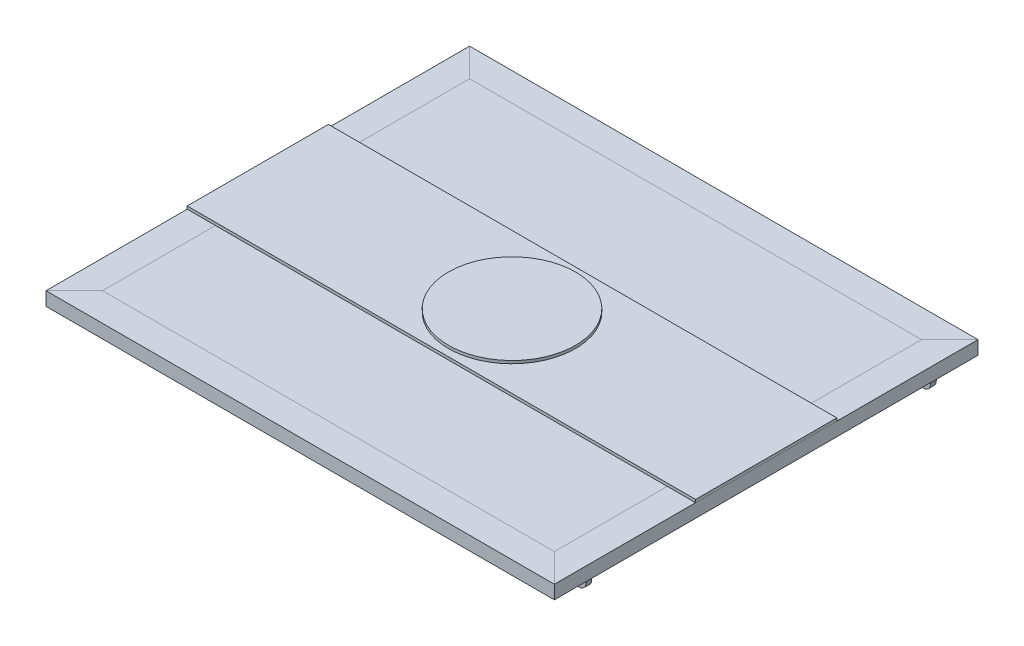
ISO-10303-21;
HEADER;
FILE_DESCRIPTION(('STEP AP214'),'2;1');
FILE_NAME('part.step','',(''),(''),'','','');
FILE_SCHEMA(('AUTOMOTIVE_DESIGN { 1 0 10303 214 1 1 1 1 }'));
ENDSEC;
DATA;
#1=APPLICATION_CONTEXT('core data for automotive mechanical design processes');
#2=APPLICATION_PROTOCOL_DEFINITION('international standard','automotive_design',2000,#1);
#3=PRODUCT_CONTEXT('',#1,'mechanical');
#4=PRODUCT('Part','Part','',(#3));
#5=PRODUCT_RELATED_PRODUCT_CATEGORY('part','',(#4));
#6=PRODUCT_DEFINITION_FORMATION('','',#4);
#7=PRODUCT_DEFINITION_CONTEXT('part definition',#1,'design');
#8=PRODUCT_DEFINITION('design','',#6,#7);
#9=PRODUCT_DEFINITION_SHAPE('','',#8);
#10=(LENGTH_UNIT() NAMED_UNIT(*) SI_UNIT(.MILLI.,.METRE.));
#11=(NAMED_UNIT(*) PLANE_ANGLE_UNIT() SI_UNIT($,.RADIAN.));
#12=(NAMED_UNIT(*) SI_UNIT($,.STERADIAN.) SOLID_ANGLE_UNIT());
#13=UNCERTAINTY_MEASURE_WITH_UNIT(LENGTH_MEASURE(1.E-05),#10,'distance_accuracy_value','');
#14=(GEOMETRIC_REPRESENTATION_CONTEXT(3) GLOBAL_UNCERTAINTY_ASSIGNED_CONTEXT((#13)) GLOBAL_UNIT_ASSIGNED_CONTEXT((#10,
#11,#12)) REPRESENTATION_CONTEXT('',''));
#15=CARTESIAN_POINT('',(0.,0.,0.));
#16=DIRECTION('',(0.,0.,1.));
#17=DIRECTION('',(1.,0.,0.));
#18=AXIS2_PLACEMENT_3D('',#15,#16,#17);
#19=CARTESIAN_POINT('',(-800.000000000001,-48.0000000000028,650.));
#20=DIRECTION('',(1.,0.,0.));
#21=DIRECTION('',(0.,1.,0.));
#22=AXIS2_PLACEMENT_3D('',#19,#20,#21);
#23=PLANE('',#22);
#24=DIRECTION('',(0.,0.,-1.));
#25=VECTOR('',#24,1.);
#26=CARTESIAN_POINT('',(-800.000000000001,-2.79290479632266E-12,650.));
#27=LINE('',#26,#25);
#28=CARTESIAN_POINT('',(-800.000000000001,-2.79290479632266E-12,650.));
#29=VERTEX_POINT('',#28);
#30=CARTESIAN_POINT('',(-800.000000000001,-2.79290479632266E-12,-650.));
#31=VERTEX_POINT('',#30);
#32=EDGE_CURVE('E154',#29,#31,#27,.T.);
#33=ORIENTED_EDGE('',*,*,#32,.T.);
#34=DIRECTION('',(0.,1.,0.));
#35=VECTOR('',#34,1.);
#36=CARTESIAN_POINT('',(-800.000000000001,-48.0000000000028,-650.));
#37=LINE('',#36,#35);
#38=CARTESIAN_POINT('',(-800.000000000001,-48.0000000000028,-650.));
#39=VERTEX_POINT('',#38);
#40=EDGE_CURVE('E14',#39,#31,#37,.T.);
#41=ORIENTED_EDGE('',*,*,#40,.F.);
#42=DIRECTION('',(0.,0.,-1.));
#43=VECTOR('',#42,1.);
#44=CARTESIAN_POINT('',(-800.000000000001,-48.0000000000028,650.));
#45=LINE('',#44,#43);
#46=CARTESIAN_POINT('',(-800.000000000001,-48.0000000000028,650.));
#47=VERTEX_POINT('',#46);
#48=EDGE_CURVE('E142',#47,#39,#45,.T.);
#49=ORIENTED_EDGE('',*,*,#48,.F.);
#50=DIRECTION('',(0.,1.,0.));
#51=VECTOR('',#50,1.);
#52=CARTESIAN_POINT('',(-800.000000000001,-48.0000000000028,650.));
#53=LINE('',#52,#51);
#54=EDGE_CURVE('E150',#47,#29,#53,.T.);
#55=ORIENTED_EDGE('',*,*,#54,.T.);
#56=EDGE_LOOP('',(#33,#41,#49,#55));
#57=FACE_BOUND('',#56,.T.);
#58=ADVANCED_FACE('F91',(#57),#23,.F.);
#59=CARTESIAN_POINT('',(-800.000000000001,-48.0000000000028,-650.));
#60=DIRECTION('',(0.,0.,1.));
#61=DIRECTION('',(1.,0.,0.));
#62=AXIS2_PLACEMENT_3D('',#59,#60,#61);
#63=PLANE('',#62);
#64=DIRECTION('',(1.,0.,0.));
#65=VECTOR('',#64,1.);
#66=CARTESIAN_POINT('',(-800.000000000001,-2.79290479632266E-12,-650.));
#67=LINE('',#66,#65);
#68=CARTESIAN_POINT('',(800.,2.79290479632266E-12,-650.));
#69=VERTEX_POINT('',#68);
#70=EDGE_CURVE('E146',#31,#69,#67,.T.);
#71=ORIENTED_EDGE('',*,*,#70,.T.);
#72=DIRECTION('',(0.,1.,0.));
#73=VECTOR('',#72,1.);
#74=CARTESIAN_POINT('',(800.,-47.9999999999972,-650.));
#75=LINE('',#74,#73);
#76=CARTESIAN_POINT('',(800.,-47.9999999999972,-650.));
#77=VERTEX_POINT('',#76);
#78=EDGE_CURVE('E99',#77,#69,#75,.T.);
#79=ORIENTED_EDGE('',*,*,#78,.F.);
#80=DIRECTION('',(1.,0.,0.));
#81=VECTOR('',#80,1.);
#82=CARTESIAN_POINT('',(-800.000000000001,-48.0000000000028,-650.));
#83=LINE('',#82,#81);
#84=EDGE_CURVE('E137',#39,#77,#83,.T.);
#85=ORIENTED_EDGE('',*,*,#84,.F.);
#86=ORIENTED_EDGE('',*,*,#40,.T.);
#87=EDGE_LOOP('',(#71,#79,#85,#86));
#88=FACE_BOUND('',#87,.T.);
#89=ADVANCED_FACE('F145',(#88),#63,.F.);
#90=CARTESIAN_POINT('',(800.,-47.9999999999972,650.));
#91=DIRECTION('',(-1.,0.,0.));
#92=DIRECTION('',(0.,-1.,0.));
#93=AXIS2_PLACEMENT_3D('',#90,#91,#92);
#94=PLANE('',#93);
#95=DIRECTION('',(0.,0.,1.));
#96=VECTOR('',#95,1.);
#97=CARTESIAN_POINT('',(800.,2.79290479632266E-12,650.));
#98=LINE('',#97,#96);
#99=CARTESIAN_POINT('',(800.,2.79290479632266E-12,650.));
#100=VERTEX_POINT('',#99);
#101=EDGE_CURVE('E124',#69,#100,#98,.T.);
#102=ORIENTED_EDGE('',*,*,#101,.T.);
#103=DIRECTION('',(0.,1.,0.));
#104=VECTOR('',#103,1.);
#105=CARTESIAN_POINT('',(800.,-47.9999999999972,650.));
#106=LINE('',#105,#104);
#107=CARTESIAN_POINT('',(800.,-47.9999999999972,650.));
#108=VERTEX_POINT('',#107);
#109=EDGE_CURVE('E147',#108,#100,#106,.T.);
#110=ORIENTED_EDGE('',*,*,#109,.F.);
#111=DIRECTION('',(0.,0.,1.));
#112=VECTOR('',#111,1.);
#113=CARTESIAN_POINT('',(800.,-47.9999999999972,650.));
#114=LINE('',#113,#112);
#115=EDGE_CURVE('E140',#77,#108,#114,.T.);
#116=ORIENTED_EDGE('',*,*,#115,.F.);
#117=ORIENTED_EDGE('',*,*,#78,.T.);
#118=EDGE_LOOP('',(#102,#110,#116,#117));
#119=FACE_BOUND('',#118,.T.);
#120=ADVANCED_FACE('F148',(#119),#94,.F.);
#121=CARTESIAN_POINT('',(-800.000000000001,-48.0000000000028,650.));
#122=DIRECTION('',(0.,0.,-1.));
#123=DIRECTION('',(-1.,0.,0.));
#124=AXIS2_PLACEMENT_3D('',#121,#122,#123);
#125=PLANE('',#124);
#126=DIRECTION('',(-1.,0.,0.));
#127=VECTOR('',#126,1.);
#128=CARTESIAN_POINT('',(-800.000000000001,-2.79290479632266E-12,650.));
#129=LINE('',#128,#127);
#130=EDGE_CURVE('E130',#100,#29,#129,.T.);
#131=ORIENTED_EDGE('',*,*,#130,.T.);
#132=ORIENTED_EDGE('',*,*,#54,.F.);
#133=DIRECTION('',(-1.,0.,0.));
#134=VECTOR('',#133,1.);
#135=CARTESIAN_POINT('',(-800.000000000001,-48.0000000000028,650.));
#136=LINE('',#135,#134);
#137=EDGE_CURVE('E107',#108,#47,#136,.T.);
#138=ORIENTED_EDGE('',*,*,#137,.F.);
#139=ORIENTED_EDGE('',*,*,#109,.T.);
#140=EDGE_LOOP('',(#131,#132,#138,#139));
#141=FACE_BOUND('',#140,.T.);
#142=ADVANCED_FACE('F161',(#141),#125,.F.);
#143=CARTESIAN_POINT('',(1.6759110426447E-13,-48.,0.));
#144=DIRECTION('',(0.,-1.,0.));
#145=DIRECTION('',(1.,0.,0.));
#146=AXIS2_PLACEMENT_3D('',#143,#144,#145);
#147=PLANE('',#146);
#148=ORIENTED_EDGE('',*,*,#48,.T.);
#149=ORIENTED_EDGE('',*,*,#84,.T.);
#150=ORIENTED_EDGE('',*,*,#115,.T.);
#151=ORIENTED_EDGE('',*,*,#137,.T.);
#152=EDGE_LOOP('',(#148,#149,#150,#151));
#153=FACE_BOUND('',#152,.T.);
#154=ADVANCED_FACE('F138',(#153),#147,.T.);
#155=CARTESIAN_POINT('',(0.,0.,0.));
#156=DIRECTION('',(0.,-1.,0.));
#157=DIRECTION('',(1.,0.,0.));
#158=AXIS2_PLACEMENT_3D('',#155,#156,#157);
#159=PLANE('',#158);
#160=ORIENTED_EDGE('',*,*,#32,.F.);
#161=ORIENTED_EDGE('',*,*,#130,.F.);
#162=ORIENTED_EDGE('',*,*,#101,.F.);
#163=ORIENTED_EDGE('',*,*,#70,.F.);
#164=EDGE_LOOP('',(#160,#161,#162,#163));
#165=FACE_BOUND('',#164,.T.);
#166=ADVANCED_FACE('F164',(#165),#159,.F.);
#167=CLOSED_SHELL('',(#58,#89,#120,#142,#154,#166));
#168=MANIFOLD_SOLID_BREP('B2',#167);
#169=CARTESIAN_POINT('',(0.,20.,0.));
#170=DIRECTION('',(0.,-1.,0.));
#171=DIRECTION('',(1.,0.,0.));
#172=AXIS2_PLACEMENT_3D('',#169,#170,#171);
#173=CYLINDRICAL_SURFACE('',#172,225.);
#174=CARTESIAN_POINT('',(0.,20.,0.));
#175=DIRECTION('',(0.,1.,0.));
#176=DIRECTION('',(-1.,0.,0.));
#177=AXIS2_PLACEMENT_3D('',#174,#175,#176);
#178=CIRCLE('',#177,225.);
#179=CARTESIAN_POINT('',(-225.,19.9999999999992,0.));
#180=VERTEX_POINT('',#179);
#181=EDGE_CURVE('E90',#180,#180,#178,.T.);
#182=ORIENTED_EDGE('',*,*,#181,.F.);
#183=EDGE_LOOP('',(#182));
#184=FACE_BOUND('',#183,.T.);
#185=CARTESIAN_POINT('',(0.,10.,0.));
#186=DIRECTION('',(0.,1.,0.));
#187=DIRECTION('',(-1.,0.,0.));
#188=AXIS2_PLACEMENT_3D('',#185,#186,#187);
#189=CIRCLE('',#188,225.);
#190=CARTESIAN_POINT('',(-225.,9.99999999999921,0.));
#191=VERTEX_POINT('',#190);
#192=EDGE_CURVE('E228',#191,#191,#189,.T.);
#193=ORIENTED_EDGE('',*,*,#192,.T.);
#194=EDGE_LOOP('',(#193));
#195=FACE_BOUND('',#194,.T.);
#196=ADVANCED_FACE('F225',(#184,#195),#173,.T.);
#197=CARTESIAN_POINT('',(0.,20.,0.));
#198=DIRECTION('',(0.,1.,0.));
#199=DIRECTION('',(-1.,0.,0.));
#200=AXIS2_PLACEMENT_3D('',#197,#198,#199);
#201=PLANE('',#200);
#202=ORIENTED_EDGE('',*,*,#181,.T.);
#203=EDGE_LOOP('',(#202));
#204=FACE_BOUND('',#203,.T.);
#205=ADVANCED_FACE('F240',(#204),#201,.T.);
#206=CARTESIAN_POINT('',(0.,10.,0.));
#207=DIRECTION('',(0.,1.,0.));
#208=DIRECTION('',(-1.,0.,0.));
#209=AXIS2_PLACEMENT_3D('',#206,#207,#208);
#210=PLANE('',#209);
#211=ORIENTED_EDGE('',*,*,#192,.F.);
#212=EDGE_LOOP('',(#211));
#213=FACE_BOUND('',#212,.T.);
#214=ADVANCED_FACE('F238',(#213),#210,.F.);
#215=CLOSED_SHELL('',(#196,#205,#214));
#216=MANIFOLD_SOLID_BREP('B8',#215);
#217=CARTESIAN_POINT('',(900.,10.0000000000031,250.));
#218=DIRECTION('',(-1.,0.,0.));
#219=DIRECTION('',(0.,-1.,0.));
#220=AXIS2_PLACEMENT_3D('',#217,#218,#219);
#221=PLANE('',#220);
#222=DIRECTION('',(0.,0.,-1.));
#223=VECTOR('',#222,1.);
#224=CARTESIAN_POINT('',(900.,3.14245157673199E-12,250.));
#225=LINE('',#224,#223);
#226=CARTESIAN_POINT('',(900.,3.14245157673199E-12,250.));
#227=VERTEX_POINT('',#226);
#228=CARTESIAN_POINT('',(900.,3.14245157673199E-12,-250.));
#229=VERTEX_POINT('',#228);
#230=EDGE_CURVE('E339',#227,#229,#225,.T.);
#231=ORIENTED_EDGE('',*,*,#230,.T.);
#232=DIRECTION('',(0.,-1.,0.));
#233=VECTOR('',#232,1.);
#234=CARTESIAN_POINT('',(900.,10.0000000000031,-250.));
#235=LINE('',#234,#233);
#236=CARTESIAN_POINT('',(900.,10.0000000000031,-250.));
#237=VERTEX_POINT('',#236);
#238=EDGE_CURVE('E223',#237,#229,#235,.T.);
#239=ORIENTED_EDGE('',*,*,#238,.F.);
#240=DIRECTION('',(0.,0.,-1.));
#241=VECTOR('',#240,1.);
#242=CARTESIAN_POINT('',(900.,10.0000000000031,250.));
#243=LINE('',#242,#241);
#244=CARTESIAN_POINT('',(900.,10.0000000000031,250.));
#245=VERTEX_POINT('',#244);
#246=EDGE_CURVE('E327',#245,#237,#243,.T.);
#247=ORIENTED_EDGE('',*,*,#246,.F.);
#248=DIRECTION('',(0.,-1.,0.));
#249=VECTOR('',#248,1.);
#250=CARTESIAN_POINT('',(900.,10.0000000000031,250.));
#251=LINE('',#250,#249);
#252=EDGE_CURVE('E335',#245,#227,#251,.T.);
#253=ORIENTED_EDGE('',*,*,#252,.T.);
#254=EDGE_LOOP('',(#231,#239,#247,#253));
#255=FACE_BOUND('',#254,.T.);
#256=ADVANCED_FACE('F276',(#255),#221,.F.);
#257=CARTESIAN_POINT('',(-900.,9.99999999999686,-250.));
#258=DIRECTION('',(0.,0.,1.));
#259=DIRECTION('',(0.,-1.,0.));
#260=AXIS2_PLACEMENT_3D('',#257,#258,#259);
#261=PLANE('',#260);
#262=DIRECTION('',(-1.,0.,0.));
#263=VECTOR('',#262,1.);
#264=CARTESIAN_POINT('',(-900.,-3.14245157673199E-12,-250.));
#265=LINE('',#264,#263);
#266=CARTESIAN_POINT('',(-900.,-3.14245157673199E-12,-250.));
#267=VERTEX_POINT('',#266);
#268=EDGE_CURVE('E331',#229,#267,#265,.T.);
#269=ORIENTED_EDGE('',*,*,#268,.T.);
#270=DIRECTION('',(0.,-1.,0.));
#271=VECTOR('',#270,1.);
#272=CARTESIAN_POINT('',(-900.,9.99999999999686,-250.));
#273=LINE('',#272,#271);
#274=CARTESIAN_POINT('',(-900.,9.99999999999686,-250.));
#275=VERTEX_POINT('',#274);
#276=EDGE_CURVE('E284',#275,#267,#273,.T.);
#277=ORIENTED_EDGE('',*,*,#276,.F.);
#278=DIRECTION('',(-1.,0.,0.));
#279=VECTOR('',#278,1.);
#280=CARTESIAN_POINT('',(-900.,9.99999999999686,-250.));
#281=LINE('',#280,#279);
#282=EDGE_CURVE('E322',#237,#275,#281,.T.);
#283=ORIENTED_EDGE('',*,*,#282,.F.);
#284=ORIENTED_EDGE('',*,*,#238,.T.);
#285=EDGE_LOOP('',(#269,#277,#283,#284));
#286=FACE_BOUND('',#285,.T.);
#287=ADVANCED_FACE('F330',(#286),#261,.F.);
#288=CARTESIAN_POINT('',(-900.,9.99999999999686,250.));
#289=DIRECTION('',(1.,0.,0.));
#290=DIRECTION('',(0.,1.,0.));
#291=AXIS2_PLACEMENT_3D('',#288,#289,#290);
#292=PLANE('',#291);
#293=DIRECTION('',(0.,0.,1.));
#294=VECTOR('',#293,1.);
#295=CARTESIAN_POINT('',(-900.,-3.14245157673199E-12,250.));
#296=LINE('',#295,#294);
#297=CARTESIAN_POINT('',(-900.,-3.14245157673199E-12,250.));
#298=VERTEX_POINT('',#297);
#299=EDGE_CURVE('E309',#267,#298,#296,.T.);
#300=ORIENTED_EDGE('',*,*,#299,.T.);
#301=DIRECTION('',(0.,-1.,0.));
#302=VECTOR('',#301,1.);
#303=CARTESIAN_POINT('',(-900.,9.99999999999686,250.));
#304=LINE('',#303,#302);
#305=CARTESIAN_POINT('',(-900.,9.99999999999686,250.));
#306=VERTEX_POINT('',#305);
#307=EDGE_CURVE('E332',#306,#298,#304,.T.);
#308=ORIENTED_EDGE('',*,*,#307,.F.);
#309=DIRECTION('',(0.,0.,1.));
#310=VECTOR('',#309,1.);
#311=CARTESIAN_POINT('',(-900.,9.99999999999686,250.));
#312=LINE('',#311,#310);
#313=EDGE_CURVE('E325',#275,#306,#312,.T.);
#314=ORIENTED_EDGE('',*,*,#313,.F.);
#315=ORIENTED_EDGE('',*,*,#276,.T.);
#316=EDGE_LOOP('',(#300,#308,#314,#315));
#317=FACE_BOUND('',#316,.T.);
#318=ADVANCED_FACE('F333',(#317),#292,.F.);
#319=CARTESIAN_POINT('',(-900.,9.99999999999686,250.));
#320=DIRECTION('',(0.,0.,-1.));
#321=DIRECTION('',(0.,1.,0.));
#322=AXIS2_PLACEMENT_3D('',#319,#320,#321);
#323=PLANE('',#322);
#324=DIRECTION('',(1.,0.,0.));
#325=VECTOR('',#324,1.);
#326=CARTESIAN_POINT('',(-900.,-3.14245157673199E-12,250.));
#327=LINE('',#326,#325);
#328=EDGE_CURVE('E315',#298,#227,#327,.T.);
#329=ORIENTED_EDGE('',*,*,#328,.T.);
#330=ORIENTED_EDGE('',*,*,#252,.F.);
#331=DIRECTION('',(1.,0.,0.));
#332=VECTOR('',#331,1.);
#333=CARTESIAN_POINT('',(-900.,9.99999999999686,250.));
#334=LINE('',#333,#332);
#335=EDGE_CURVE('E292',#306,#245,#334,.T.);
#336=ORIENTED_EDGE('',*,*,#335,.F.);
#337=ORIENTED_EDGE('',*,*,#307,.T.);
#338=EDGE_LOOP('',(#329,#330,#336,#337));
#339=FACE_BOUND('',#338,.T.);
#340=ADVANCED_FACE('F346',(#339),#323,.F.);
#341=CARTESIAN_POINT('',(0.,10.,0.));
#342=DIRECTION('',(0.,-1.,0.));
#343=DIRECTION('',(1.,0.,0.));
#344=AXIS2_PLACEMENT_3D('',#341,#342,#343);
#345=PLANE('',#344);
#346=ORIENTED_EDGE('',*,*,#246,.T.);
#347=ORIENTED_EDGE('',*,*,#282,.T.);
#348=ORIENTED_EDGE('',*,*,#313,.T.);
#349=ORIENTED_EDGE('',*,*,#335,.T.);
#350=EDGE_LOOP('',(#346,#347,#348,#349));
#351=FACE_BOUND('',#350,.T.);
#352=ADVANCED_FACE('F323',(#351),#345,.F.);
#353=CARTESIAN_POINT('',(0.,0.,0.));
#354=DIRECTION('',(0.,-1.,0.));
#355=DIRECTION('',(1.,0.,0.));
#356=AXIS2_PLACEMENT_3D('',#353,#354,#355);
#357=PLANE('',#356);
#358=ORIENTED_EDGE('',*,*,#230,.F.);
#359=ORIENTED_EDGE('',*,*,#328,.F.);
#360=ORIENTED_EDGE('',*,*,#299,.F.);
#361=ORIENTED_EDGE('',*,*,#268,.F.);
#362=EDGE_LOOP('',(#358,#359,#360,#361));
#363=FACE_BOUND('',#362,.T.);
#364=ADVANCED_FACE('F349',(#363),#357,.T.);
#365=CLOSED_SHELL('',(#256,#287,#318,#340,#352,#364));
#366=MANIFOLD_SOLID_BREP('B85',#365);
#367=CARTESIAN_POINT('',(-900.,3.50414142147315E-13,-650.));
#368=DIRECTION('',(1.,0.,0.));
#369=DIRECTION('',(0.,1.,0.));
#370=AXIS2_PLACEMENT_3D('',#367,#368,#369);
#371=PLANE('',#370);
#372=DIRECTION('',(0.,-1.,0.));
#373=VECTOR('',#372,1.);
#374=CARTESIAN_POINT('',(-900.,6.82440215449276E-12,750.));
#375=LINE('',#374,#373);
#376=CARTESIAN_POINT('',(-900.,3.50414142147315E-13,750.));
#377=VERTEX_POINT('',#376);
#378=CARTESIAN_POINT('',(-900.000000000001,-47.9999999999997,750.));
#379=VERTEX_POINT('',#378);
#380=EDGE_CURVE('E500',#377,#379,#375,.T.);
#381=ORIENTED_EDGE('',*,*,#380,.F.);
#382=DIRECTION('',(0.,0.,1.));
#383=VECTOR('',#382,1.);
#384=CARTESIAN_POINT('',(-900.,3.50414142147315E-13,-650.));
#385=LINE('',#384,#383);
#386=CARTESIAN_POINT('',(-900.,3.50414142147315E-13,-750.));
#387=VERTEX_POINT('',#386);
#388=EDGE_CURVE('E555',#387,#377,#385,.T.);
#389=ORIENTED_EDGE('',*,*,#388,.F.);
#390=DIRECTION('',(0.,1.,0.));
#391=VECTOR('',#390,1.);
#392=CARTESIAN_POINT('',(-900.,8.11850586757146E-13,-750.));
#393=LINE('',#392,#391);
#394=CARTESIAN_POINT('',(-900.000000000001,-47.9999999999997,-750.));
#395=VERTEX_POINT('',#394);
#396=EDGE_CURVE('E491',#395,#387,#393,.T.);
#397=ORIENTED_EDGE('',*,*,#396,.F.);
#398=DIRECTION('',(0.,0.,1.));
#399=VECTOR('',#398,1.);
#400=CARTESIAN_POINT('',(-900.,-47.9999999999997,-650.));
#401=LINE('',#400,#399);
#402=EDGE_CURVE('E414',#395,#379,#401,.T.);
#403=ORIENTED_EDGE('',*,*,#402,.T.);
#404=EDGE_LOOP('',(#381,#389,#397,#403));
#405=FACE_BOUND('',#404,.T.);
#406=ADVANCED_FACE('F410',(#405),#371,.F.);
#407=CARTESIAN_POINT('',(-800.,0.,-650.));
#408=DIRECTION('',(0.,-1.,0.));
#409=DIRECTION('',(1.,0.,0.));
#410=AXIS2_PLACEMENT_3D('',#407,#408,#409);
#411=PLANE('',#410);
#412=DIRECTION('',(-0.707106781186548,0.,0.707106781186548));
#413=VECTOR('',#412,1.);
#414=CARTESIAN_POINT('',(-150.,-2.26901830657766E-12,0.));
#415=LINE('',#414,#413);
#416=CARTESIAN_POINT('',(-800.,0.,650.));
#417=VERTEX_POINT('',#416);
#418=EDGE_CURVE('E497',#417,#377,#415,.T.);
#419=ORIENTED_EDGE('',*,*,#418,.F.);
#420=DIRECTION('',(0.,0.,1.));
#421=VECTOR('',#420,1.);
#422=CARTESIAN_POINT('',(-800.,0.,-650.));
#423=LINE('',#422,#421);
#424=CARTESIAN_POINT('',(-800.,0.,-650.));
#425=VERTEX_POINT('',#424);
#426=EDGE_CURVE('E553',#425,#417,#423,.T.);
#427=ORIENTED_EDGE('',*,*,#426,.F.);
#428=DIRECTION('',(0.707106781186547,0.,0.707106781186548));
#429=VECTOR('',#428,1.);
#430=CARTESIAN_POINT('',(-800.,0.,-650.));
#431=LINE('',#430,#429);
#432=EDGE_CURVE('E579',#387,#425,#431,.T.);
#433=ORIENTED_EDGE('',*,*,#432,.F.);
#434=ORIENTED_EDGE('',*,*,#388,.T.);
#435=EDGE_LOOP('',(#419,#427,#433,#434));
#436=FACE_BOUND('',#435,.T.);
#437=ADVANCED_FACE('F569',(#436),#411,.F.);
#438=CARTESIAN_POINT('',(-800.,0.,-650.));
#439=DIRECTION('',(-1.,0.,0.));
#440=DIRECTION('',(0.,-1.,0.));
#441=AXIS2_PLACEMENT_3D('',#438,#439,#440);
#442=PLANE('',#441);
#443=DIRECTION('',(0.,1.,0.));
#444=VECTOR('',#443,1.);
#445=CARTESIAN_POINT('',(-800.,6.01255156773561E-12,650.));
#446=LINE('',#445,#444);
#447=CARTESIAN_POINT('',(-800.000000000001,-48.,650.));
#448=VERTEX_POINT('',#447);
#449=EDGE_CURVE('E274',#448,#417,#446,.T.);
#450=ORIENTED_EDGE('',*,*,#449,.F.);
#451=DIRECTION('',(0.,0.,1.));
#452=VECTOR('',#451,1.);
#453=CARTESIAN_POINT('',(-800.,-48.,-650.));
#454=LINE('',#453,#452);
#455=CARTESIAN_POINT('',(-800.,-48.,-650.));
#456=VERTEX_POINT('',#455);
#457=EDGE_CURVE('E550',#456,#448,#454,.T.);
#458=ORIENTED_EDGE('',*,*,#457,.F.);
#459=DIRECTION('',(0.,-1.,0.));
#460=VECTOR('',#459,1.);
#461=CARTESIAN_POINT('',(-800.,0.,-650.));
#462=LINE('',#461,#460);
#463=EDGE_CURVE('E576',#425,#456,#462,.T.);
#464=ORIENTED_EDGE('',*,*,#463,.F.);
#465=ORIENTED_EDGE('',*,*,#426,.T.);
#466=EDGE_LOOP('',(#450,#458,#464,#465));
#467=FACE_BOUND('',#466,.T.);
#468=ADVANCED_FACE('F573',(#467),#442,.F.);
#469=CARTESIAN_POINT('',(-802.734487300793,-48.,-650.));
#470=DIRECTION('',(0.,1.,0.));
#471=DIRECTION('',(0.,0.,1.));
#472=AXIS2_PLACEMENT_3D('',#469,#470,#471);
#473=PLANE('',#472);
#474=DIRECTION('',(0.707106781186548,0.,-0.707106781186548));
#475=VECTOR('',#474,1.);
#476=CARTESIAN_POINT('',(-151.367243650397,-48.,1.36724365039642));
#477=LINE('',#476,#475);
#478=CARTESIAN_POINT('',(-802.734487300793,-48.,652.734487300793));
#479=VERTEX_POINT('',#478);
#480=EDGE_CURVE('E419',#479,#448,#477,.T.);
#481=ORIENTED_EDGE('',*,*,#480,.F.);
#482=DIRECTION('',(0.,0.,1.));
#483=VECTOR('',#482,1.);
#484=CARTESIAN_POINT('',(-802.734487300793,-48.,-650.));
#485=LINE('',#484,#483);
#486=CARTESIAN_POINT('',(-802.734487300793,-48.,-652.734487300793));
#487=VERTEX_POINT('',#486);
#488=EDGE_CURVE('E547',#487,#479,#485,.T.);
#489=ORIENTED_EDGE('',*,*,#488,.F.);
#490=DIRECTION('',(-0.707106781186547,0.,-0.707106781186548));
#491=VECTOR('',#490,1.);
#492=CARTESIAN_POINT('',(-801.367243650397,-48.,-651.367243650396));
#493=LINE('',#492,#491);
#494=EDGE_CURVE('E578',#456,#487,#493,.T.);
#495=ORIENTED_EDGE('',*,*,#494,.F.);
#496=ORIENTED_EDGE('',*,*,#457,.T.);
#497=EDGE_LOOP('',(#481,#489,#495,#496));
#498=FACE_BOUND('',#497,.T.);
#499=ADVANCED_FACE('F630',(#498),#473,.F.);
#500=CARTESIAN_POINT('',(-802.734487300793,-43.75,-650.));
#501=DIRECTION('',(0.,0.,1.));
#502=DIRECTION('',(1.,0.,0.));
#503=AXIS2_PLACEMENT_3D('',#500,#501,#502);
#504=CYLINDRICAL_SURFACE('',#503,4.25000000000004);
#505=CARTESIAN_POINT('',(-802.734487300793,-43.75,652.734487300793));
#506=DIRECTION('',(0.707106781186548,0.,0.707106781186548));
#507=DIRECTION('',(-0.707106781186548,0.,0.707106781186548));
#508=AXIS2_PLACEMENT_3D('',#505,#506,#507);
#509=ELLIPSE('',#508,6.01040764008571,4.25000000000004);
#510=CARTESIAN_POINT('',(-806.972230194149,-44.0725448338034,656.972230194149));
#511=VERTEX_POINT('',#510);
#512=EDGE_CURVE('E511',#511,#479,#509,.T.);
#513=ORIENTED_EDGE('',*,*,#512,.F.);
#514=DIRECTION('',(0.,0.,1.));
#515=VECTOR('',#514,1.);
#516=CARTESIAN_POINT('',(-806.972230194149,-44.0725448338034,-650.));
#517=LINE('',#516,#515);
#518=CARTESIAN_POINT('',(-806.972230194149,-44.0725448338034,-656.972230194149));
#519=VERTEX_POINT('',#518);
#520=EDGE_CURVE('E544',#519,#511,#517,.T.);
#521=ORIENTED_EDGE('',*,*,#520,.F.);
#522=CARTESIAN_POINT('',(-802.734487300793,-43.75,-652.734487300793));
#523=DIRECTION('',(0.707106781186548,0.,-0.707106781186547));
#524=DIRECTION('',(0.707106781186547,0.,0.707106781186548));
#525=AXIS2_PLACEMENT_3D('',#522,#523,#524);
#526=ELLIPSE('',#525,6.01040764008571,4.25000000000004);
#527=EDGE_CURVE('E581',#487,#519,#526,.T.);
#528=ORIENTED_EDGE('',*,*,#527,.F.);
#529=ORIENTED_EDGE('',*,*,#488,.T.);
#530=EDGE_LOOP('',(#513,#521,#528,#529));
#531=FACE_BOUND('',#530,.T.);
#532=ADVANCED_FACE('F633',(#531),#504,.T.);
#533=CARTESIAN_POINT('',(-809.325445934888,-13.1549103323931,-650.));
#534=DIRECTION('',(0.997115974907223,0.0758929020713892,0.));
#535=DIRECTION('',(-0.0758929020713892,0.997115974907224,0.));
#536=AXIS2_PLACEMENT_3D('',#533,#534,#535);
#537=PLANE('',#536);
#538=DIRECTION('',(0.0756752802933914,-0.994256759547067,-0.0756752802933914));
#539=VECTOR('',#538,1.);
#540=CARTESIAN_POINT('',(-801.827268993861,-111.669419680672,651.827268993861));
#541=LINE('',#540,#539);
#542=CARTESIAN_POINT('',(-809.325445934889,-13.1549103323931,659.325445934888));
#543=VERTEX_POINT('',#542);
#544=EDGE_CURVE('E514',#543,#511,#541,.T.);
#545=ORIENTED_EDGE('',*,*,#544,.F.);
#546=DIRECTION('',(0.,0.,1.));
#547=VECTOR('',#546,1.);
#548=CARTESIAN_POINT('',(-809.325445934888,-13.1549103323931,-650.));
#549=LINE('',#548,#547);
#550=CARTESIAN_POINT('',(-809.325445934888,-13.1549103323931,-659.325445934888));
#551=VERTEX_POINT('',#550);
#552=EDGE_CURVE('E541',#551,#543,#549,.T.);
#553=ORIENTED_EDGE('',*,*,#552,.F.);
#554=DIRECTION('',(-0.0756752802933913,0.994256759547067,-0.0756752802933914));
#555=VECTOR('',#554,1.);
#556=CARTESIAN_POINT('',(-809.272041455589,-13.8565630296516,-659.272041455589));
#557=LINE('',#556,#555);
#558=EDGE_CURVE('E588',#519,#551,#557,.T.);
#559=ORIENTED_EDGE('',*,*,#558,.F.);
#560=ORIENTED_EDGE('',*,*,#520,.T.);
#561=EDGE_LOOP('',(#545,#553,#559,#560));
#562=FACE_BOUND('',#561,.T.);
#563=ADVANCED_FACE('F637',(#562),#537,.F.);
#564=CARTESIAN_POINT('',(-817.8009317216,-13.7999999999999,-650.));
#565=DIRECTION('',(0.,0.,1.));
#566=DIRECTION('',(1.,0.,0.));
#567=AXIS2_PLACEMENT_3D('',#564,#565,#566);
#568=CYLINDRICAL_SURFACE('',#567,8.50000000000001);
#569=CARTESIAN_POINT('',(-817.8009317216,-13.7999999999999,667.8009317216));
#570=DIRECTION('',(0.707106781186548,0.,0.707106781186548));
#571=DIRECTION('',(-0.707106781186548,0.,0.707106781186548));
#572=AXIS2_PLACEMENT_3D('',#569,#570,#571);
#573=ELLIPSE('',#572,12.0208152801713,8.50000000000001);
#574=CARTESIAN_POINT('',(-817.8009317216,-5.29999999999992,667.8009317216));
#575=VERTEX_POINT('',#574);
#576=EDGE_CURVE('E517',#575,#543,#573,.F.);
#577=ORIENTED_EDGE('',*,*,#576,.F.);
#578=DIRECTION('',(0.,0.,1.));
#579=VECTOR('',#578,1.);
#580=CARTESIAN_POINT('',(-817.8009317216,-5.29999999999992,-650.));
#581=LINE('',#580,#579);
#582=CARTESIAN_POINT('',(-817.8009317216,-5.29999999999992,-667.8009317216));
#583=VERTEX_POINT('',#582);
#584=EDGE_CURVE('E538',#583,#575,#581,.T.);
#585=ORIENTED_EDGE('',*,*,#584,.F.);
#586=CARTESIAN_POINT('',(-817.8009317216,-13.7999999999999,-667.8009317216));
#587=DIRECTION('',(0.707106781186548,0.,-0.707106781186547));
#588=DIRECTION('',(0.707106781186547,0.,0.707106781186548));
#589=AXIS2_PLACEMENT_3D('',#586,#587,#588);
#590=ELLIPSE('',#589,12.0208152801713,8.50000000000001);
#591=EDGE_CURVE('E591',#551,#583,#590,.F.);
#592=ORIENTED_EDGE('',*,*,#591,.F.);
#593=ORIENTED_EDGE('',*,*,#552,.T.);
#594=EDGE_LOOP('',(#577,#585,#592,#593));
#595=FACE_BOUND('',#594,.T.);
#596=ADVANCED_FACE('F641',(#595),#568,.F.);
#597=CARTESIAN_POINT('',(-882.199068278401,-5.2999999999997,-650.));
#598=DIRECTION('',(0.,1.,0.));
#599=DIRECTION('',(-1.,0.,0.));
#600=AXIS2_PLACEMENT_3D('',#597,#598,#599);
#601=PLANE('',#600);
#602=DIRECTION('',(0.707106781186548,0.,-0.707106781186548));
#603=VECTOR('',#602,1.);
#604=CARTESIAN_POINT('',(-191.0995341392,-5.30000000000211,41.0995341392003));
#605=LINE('',#604,#603);
#606=CARTESIAN_POINT('',(-882.199068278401,-5.2999999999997,732.199068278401));
#607=VERTEX_POINT('',#606);
#608=EDGE_CURVE('E520',#607,#575,#605,.T.);
#609=ORIENTED_EDGE('',*,*,#608,.F.);
#610=DIRECTION('',(0.,0.,1.));
#611=VECTOR('',#610,1.);
#612=CARTESIAN_POINT('',(-882.199068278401,-5.2999999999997,-650.));
#613=LINE('',#612,#611);
#614=CARTESIAN_POINT('',(-882.199068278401,-5.2999999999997,-732.199068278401));
#615=VERTEX_POINT('',#614);
#616=EDGE_CURVE('E535',#615,#607,#613,.T.);
#617=ORIENTED_EDGE('',*,*,#616,.F.);
#618=DIRECTION('',(-0.707106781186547,0.,-0.707106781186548));
#619=VECTOR('',#618,1.);
#620=CARTESIAN_POINT('',(-841.099534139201,-5.29999999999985,-691.0995341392));
#621=LINE('',#620,#619);
#622=EDGE_CURVE('E594',#583,#615,#621,.T.);
#623=ORIENTED_EDGE('',*,*,#622,.F.);
#624=ORIENTED_EDGE('',*,*,#584,.T.);
#625=EDGE_LOOP('',(#609,#617,#623,#624));
#626=FACE_BOUND('',#625,.T.);
#627=ADVANCED_FACE('F603',(#626),#601,.F.);
#628=CARTESIAN_POINT('',(-882.199068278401,-13.7999999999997,-650.));
#629=DIRECTION('',(0.,0.,1.));
#630=DIRECTION('',(1.,0.,0.));
#631=AXIS2_PLACEMENT_3D('',#628,#629,#630);
#632=CYLINDRICAL_SURFACE('',#631,8.49999999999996);
#633=CARTESIAN_POINT('',(-882.199068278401,-13.7999999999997,732.199068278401));
#634=DIRECTION('',(0.707106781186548,0.,0.707106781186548));
#635=DIRECTION('',(-0.707106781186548,0.,0.707106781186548));
#636=AXIS2_PLACEMENT_3D('',#633,#634,#635);
#637=ELLIPSE('',#636,12.0208152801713,8.49999999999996);
#638=CARTESIAN_POINT('',(-890.674554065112,-13.1549103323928,740.674554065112));
#639=VERTEX_POINT('',#638);
#640=EDGE_CURVE('E523',#639,#607,#637,.F.);
#641=ORIENTED_EDGE('',*,*,#640,.F.);
#642=DIRECTION('',(0.,0.,1.));
#643=VECTOR('',#642,1.);
#644=CARTESIAN_POINT('',(-890.674554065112,-13.1549103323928,-650.));
#645=LINE('',#644,#643);
#646=CARTESIAN_POINT('',(-890.674554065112,-13.1549103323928,-740.674554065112));
#647=VERTEX_POINT('',#646);
#648=EDGE_CURVE('E532',#647,#639,#645,.T.);
#649=ORIENTED_EDGE('',*,*,#648,.F.);
#650=CARTESIAN_POINT('',(-882.199068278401,-13.7999999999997,-732.199068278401));
#651=DIRECTION('',(0.707106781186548,0.,-0.707106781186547));
#652=DIRECTION('',(0.707106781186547,0.,0.707106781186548));
#653=AXIS2_PLACEMENT_3D('',#650,#651,#652);
#654=ELLIPSE('',#653,12.0208152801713,8.49999999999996);
#655=EDGE_CURVE('E502',#615,#647,#654,.F.);
#656=ORIENTED_EDGE('',*,*,#655,.F.);
#657=ORIENTED_EDGE('',*,*,#616,.T.);
#658=EDGE_LOOP('',(#641,#649,#656,#657));
#659=FACE_BOUND('',#658,.T.);
#660=ADVANCED_FACE('F600',(#659),#632,.F.);
#661=CARTESIAN_POINT('',(-890.674554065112,-13.1549103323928,-650.));
#662=DIRECTION('',(-0.997115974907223,0.0758929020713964,0.));
#663=DIRECTION('',(-0.0758929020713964,-0.997115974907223,0.));
#664=AXIS2_PLACEMENT_3D('',#661,#662,#663);
#665=PLANE('',#664);
#666=DIRECTION('',(0.0756752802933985,0.994256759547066,-0.0756752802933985));
#667=VECTOR('',#666,1.);
#668=CARTESIAN_POINT('',(-882.710511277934,91.480359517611,732.710511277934));
#669=LINE('',#668,#667);
#670=CARTESIAN_POINT('',(-893.027769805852,-44.0725448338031,743.027769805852));
#671=VERTEX_POINT('',#670);
#672=EDGE_CURVE('E526',#671,#639,#669,.T.);
#673=ORIENTED_EDGE('',*,*,#672,.F.);
#674=DIRECTION('',(0.,0.,1.));
#675=VECTOR('',#674,1.);
#676=CARTESIAN_POINT('',(-893.027769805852,-44.0725448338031,-650.));
#677=LINE('',#676,#675);
#678=CARTESIAN_POINT('',(-893.027769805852,-44.0725448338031,-743.027769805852));
#679=VERTEX_POINT('',#678);
#680=EDGE_CURVE('E485',#679,#671,#677,.T.);
#681=ORIENTED_EDGE('',*,*,#680,.F.);
#682=DIRECTION('',(-0.0756752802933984,-0.994256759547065,-0.0756752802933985));
#683=VECTOR('',#682,1.);
#684=CARTESIAN_POINT('',(-890.155283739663,-6.33249713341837,-740.155283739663));
#685=LINE('',#684,#683);
#686=EDGE_CURVE('E496',#647,#679,#685,.T.);
#687=ORIENTED_EDGE('',*,*,#686,.F.);
#688=ORIENTED_EDGE('',*,*,#648,.T.);
#689=EDGE_LOOP('',(#673,#681,#687,#688));
#690=FACE_BOUND('',#689,.T.);
#691=ADVANCED_FACE('F613',(#690),#665,.F.);
#692=CARTESIAN_POINT('',(-897.265512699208,-43.7499999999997,-650.));
#693=DIRECTION('',(0.,0.,1.));
#694=DIRECTION('',(1.,0.,0.));
#695=AXIS2_PLACEMENT_3D('',#692,#693,#694);
#696=CYLINDRICAL_SURFACE('',#695,4.25000000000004);
#697=CARTESIAN_POINT('',(-897.265512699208,-43.7499999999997,747.265512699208));
#698=DIRECTION('',(0.707106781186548,0.,0.707106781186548));
#699=DIRECTION('',(-0.707106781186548,0.,0.707106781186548));
#700=AXIS2_PLACEMENT_3D('',#697,#698,#699);
#701=ELLIPSE('',#700,6.01040764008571,4.25000000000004);
#702=CARTESIAN_POINT('',(-897.265512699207,-47.9999999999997,747.265512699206));
#703=VERTEX_POINT('',#702);
#704=EDGE_CURVE('E482',#703,#671,#701,.T.);
#705=ORIENTED_EDGE('',*,*,#704,.F.);
#706=DIRECTION('',(0.,0.,1.));
#707=VECTOR('',#706,1.);
#708=CARTESIAN_POINT('',(-897.265512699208,-47.9999999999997,-650.));
#709=LINE('',#708,#707);
#710=CARTESIAN_POINT('',(-897.265512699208,-47.9999999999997,-747.265512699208));
#711=VERTEX_POINT('',#710);
#712=EDGE_CURVE('E427',#711,#703,#709,.T.);
#713=ORIENTED_EDGE('',*,*,#712,.F.);
#714=CARTESIAN_POINT('',(-897.265512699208,-43.7499999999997,-747.265512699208));
#715=DIRECTION('',(0.707106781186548,0.,-0.707106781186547));
#716=DIRECTION('',(0.707106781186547,0.,0.707106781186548));
#717=AXIS2_PLACEMENT_3D('',#714,#715,#716);
#718=ELLIPSE('',#717,6.01040764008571,4.25000000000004);
#719=EDGE_CURVE('E479',#679,#711,#718,.T.);
#720=ORIENTED_EDGE('',*,*,#719,.F.);
#721=ORIENTED_EDGE('',*,*,#680,.T.);
#722=EDGE_LOOP('',(#705,#713,#720,#721));
#723=FACE_BOUND('',#722,.T.);
#724=ADVANCED_FACE('F476',(#723),#696,.T.);
#725=CARTESIAN_POINT('',(-897.265512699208,-47.9999999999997,-650.));
#726=DIRECTION('',(0.,1.,0.));
#727=DIRECTION('',(-1.,0.,0.));
#728=AXIS2_PLACEMENT_3D('',#725,#726,#727);
#729=PLANE('',#728);
#730=DIRECTION('',(0.707106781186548,0.,-0.707106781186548));
#731=VECTOR('',#730,1.);
#732=CARTESIAN_POINT('',(-198.632756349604,-48.0000000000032,48.6327563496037));
#733=LINE('',#732,#731);
#734=EDGE_CURVE('E507',#379,#703,#733,.T.);
#735=ORIENTED_EDGE('',*,*,#734,.F.);
#736=ORIENTED_EDGE('',*,*,#402,.F.);
#737=DIRECTION('',(-0.707106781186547,0.,-0.707106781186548));
#738=VECTOR('',#737,1.);
#739=CARTESIAN_POINT('',(-848.632756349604,-47.9999999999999,-698.632756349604));
#740=LINE('',#739,#738);
#741=EDGE_CURVE('E484',#711,#395,#740,.T.);
#742=ORIENTED_EDGE('',*,*,#741,.F.);
#743=ORIENTED_EDGE('',*,*,#712,.T.);
#744=EDGE_LOOP('',(#735,#736,#742,#743));
#745=FACE_BOUND('',#744,.T.);
#746=ADVANCED_FACE('F488',(#745),#729,.F.);
#747=CARTESIAN_POINT('',(-800.,0.,-650.));
#748=DIRECTION('',(0.707106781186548,0.,-0.707106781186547));
#749=DIRECTION('',(-0.707106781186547,0.,-0.707106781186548));
#750=AXIS2_PLACEMENT_3D('',#747,#748,#749);
#751=PLANE('',#750);
#752=ORIENTED_EDGE('',*,*,#741,.T.);
#753=ORIENTED_EDGE('',*,*,#396,.T.);
#754=ORIENTED_EDGE('',*,*,#432,.T.);
#755=ORIENTED_EDGE('',*,*,#463,.T.);
#756=ORIENTED_EDGE('',*,*,#494,.T.);
#757=ORIENTED_EDGE('',*,*,#527,.T.);
#758=ORIENTED_EDGE('',*,*,#558,.T.);
#759=ORIENTED_EDGE('',*,*,#591,.T.);
#760=ORIENTED_EDGE('',*,*,#622,.T.);
#761=ORIENTED_EDGE('',*,*,#655,.T.);
#762=ORIENTED_EDGE('',*,*,#686,.T.);
#763=ORIENTED_EDGE('',*,*,#719,.T.);
#764=EDGE_LOOP('',(#752,#753,#754,#755,#756,#757,#758,#759,#760,#761,#762,#763));
#765=FACE_BOUND('',#764,.T.);
#766=ADVANCED_FACE('F494',(#765),#751,.T.);
#767=CARTESIAN_POINT('',(-800.,0.,650.));
#768=DIRECTION('',(0.707106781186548,0.,0.707106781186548));
#769=DIRECTION('',(0.707106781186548,0.,-0.707106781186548));
#770=AXIS2_PLACEMENT_3D('',#767,#768,#769);
#771=PLANE('',#770);
#772=ORIENTED_EDGE('',*,*,#418,.T.);
#773=ORIENTED_EDGE('',*,*,#380,.T.);
#774=ORIENTED_EDGE('',*,*,#734,.T.);
#775=ORIENTED_EDGE('',*,*,#704,.T.);
#776=ORIENTED_EDGE('',*,*,#672,.T.);
#777=ORIENTED_EDGE('',*,*,#640,.T.);
#778=ORIENTED_EDGE('',*,*,#608,.T.);
#779=ORIENTED_EDGE('',*,*,#576,.T.);
#780=ORIENTED_EDGE('',*,*,#544,.T.);
#781=ORIENTED_EDGE('',*,*,#512,.T.);
#782=ORIENTED_EDGE('',*,*,#480,.T.);
#783=ORIENTED_EDGE('',*,*,#449,.T.);
#784=EDGE_LOOP('',(#772,#773,#774,#775,#776,#777,#778,#779,#780,#781,#782,#783));
#785=FACE_BOUND('',#784,.T.);
#786=ADVANCED_FACE('F412',(#785),#771,.T.);
#787=CLOSED_SHELL('',(#406,#437,#468,#499,#532,#563,#596,#627,#660,#691,#724,#746,#766,#786));
#788=MANIFOLD_SOLID_BREP('B217',#787);
#789=CARTESIAN_POINT('',(-800.,3.55618312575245E-13,750.000000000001));
#790=DIRECTION('',(0.,0.,-1.));
#791=DIRECTION('',(0.,1.,0.));
#792=AXIS2_PLACEMENT_3D('',#789,#790,#791);
#793=PLANE('',#792);
#794=DIRECTION('',(0.,1.,0.));
#795=VECTOR('',#794,1.);
#796=CARTESIAN_POINT('',(-900.000000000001,8.15320033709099E-13,750.000000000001));
#797=LINE('',#796,#795);
#798=CARTESIAN_POINT('',(-900.000000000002,-47.9999999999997,750.000000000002));
#799=VERTEX_POINT('',#798);
#800=CARTESIAN_POINT('',(-900.000000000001,3.53883589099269E-13,750.000000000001));
#801=VERTEX_POINT('',#800);
#802=EDGE_CURVE('E937',#799,#801,#797,.T.);
#803=ORIENTED_EDGE('',*,*,#802,.F.);
#804=DIRECTION('',(1.,0.,0.));
#805=VECTOR('',#804,1.);
#806=CARTESIAN_POINT('',(-800.,-47.9999999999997,750.000000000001));
#807=LINE('',#806,#805);
#808=CARTESIAN_POINT('',(900.000000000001,-47.9999999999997,750.000000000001));
#809=VERTEX_POINT('',#808);
#810=EDGE_CURVE('E806',#799,#809,#807,.T.);
#811=ORIENTED_EDGE('',*,*,#810,.T.);
#812=DIRECTION('',(0.,-1.,0.));
#813=VECTOR('',#812,1.);
#814=CARTESIAN_POINT('',(900.,8.21565038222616E-12,750.000000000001));
#815=LINE('',#814,#813);
#816=CARTESIAN_POINT('',(900.,3.53883589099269E-13,750.000000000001));
#817=VERTEX_POINT('',#816);
#818=EDGE_CURVE('E964',#817,#809,#815,.T.);
#819=ORIENTED_EDGE('',*,*,#818,.F.);
#820=DIRECTION('',(1.,0.,0.));
#821=VECTOR('',#820,1.);
#822=CARTESIAN_POINT('',(-800.,3.55618312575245E-13,750.000000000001));
#823=LINE('',#822,#821);
#824=EDGE_CURVE('E958',#801,#817,#823,.T.);
#825=ORIENTED_EDGE('',*,*,#824,.F.);
#826=EDGE_LOOP('',(#803,#811,#819,#825));
#827=FACE_BOUND('',#826,.T.);
#828=ADVANCED_FACE('F802',(#827),#793,.F.);
#829=CARTESIAN_POINT('',(-800.,0.,650.000000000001));
#830=DIRECTION('',(0.,-1.,0.));
#831=DIRECTION('',(0.,0.,-1.));
#832=AXIS2_PLACEMENT_3D('',#829,#830,#831);
#833=PLANE('',#832);
#834=DIRECTION('',(0.707106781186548,0.,-0.707106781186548));
#835=VECTOR('',#834,1.);
#836=CARTESIAN_POINT('',(-800.000000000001,0.,650.));
#837=LINE('',#836,#835);
#838=CARTESIAN_POINT('',(-800.000000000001,0.,650.000000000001));
#839=VERTEX_POINT('',#838);
#840=EDGE_CURVE('E877',#801,#839,#837,.T.);
#841=ORIENTED_EDGE('',*,*,#840,.F.);
#842=ORIENTED_EDGE('',*,*,#824,.T.);
#843=DIRECTION('',(0.707106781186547,0.,0.707106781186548));
#844=VECTOR('',#843,1.);
#845=CARTESIAN_POINT('',(4.44089217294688E-13,-2.78943534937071E-12,-150.));
#846=LINE('',#845,#844);
#847=CARTESIAN_POINT('',(800.000000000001,0.,650.000000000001));
#848=VERTEX_POINT('',#847);
#849=EDGE_CURVE('E944',#848,#817,#846,.T.);
#850=ORIENTED_EDGE('',*,*,#849,.F.);
#851=DIRECTION('',(1.,0.,0.));
#852=VECTOR('',#851,1.);
#853=CARTESIAN_POINT('',(-800.,0.,650.000000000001));
#854=LINE('',#853,#852);
#855=EDGE_CURVE('E957',#839,#848,#854,.T.);
#856=ORIENTED_EDGE('',*,*,#855,.F.);
#857=EDGE_LOOP('',(#841,#842,#850,#856));
#858=FACE_BOUND('',#857,.T.);
#859=ADVANCED_FACE('F960',(#858),#833,.F.);
#860=CARTESIAN_POINT('',(-800.,0.,650.000000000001));
#861=DIRECTION('',(0.,0.,1.));
#862=DIRECTION('',(0.,-1.,0.));
#863=AXIS2_PLACEMENT_3D('',#860,#861,#862);
#864=PLANE('',#863);
#865=DIRECTION('',(0.,-1.,0.));
#866=VECTOR('',#865,1.);
#867=CARTESIAN_POINT('',(-800.000000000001,0.,650.000000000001));
#868=LINE('',#867,#866);
#869=CARTESIAN_POINT('',(-800.000000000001,-48.,650.000000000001));
#870=VERTEX_POINT('',#869);
#871=EDGE_CURVE('E933',#839,#870,#868,.T.);
#872=ORIENTED_EDGE('',*,*,#871,.F.);
#873=ORIENTED_EDGE('',*,*,#855,.T.);
#874=DIRECTION('',(0.,1.,0.));
#875=VECTOR('',#874,1.);
#876=CARTESIAN_POINT('',(800.000000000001,7.40379979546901E-12,650.000000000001));
#877=LINE('',#876,#875);
#878=CARTESIAN_POINT('',(800.000000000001,-48.,650.000000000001));
#879=VERTEX_POINT('',#878);
#880=EDGE_CURVE('E942',#879,#848,#877,.T.);
#881=ORIENTED_EDGE('',*,*,#880,.F.);
#882=DIRECTION('',(1.,0.,0.));
#883=VECTOR('',#882,1.);
#884=CARTESIAN_POINT('',(-800.,-48.,650.000000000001));
#885=LINE('',#884,#883);
#886=EDGE_CURVE('E955',#870,#879,#885,.T.);
#887=ORIENTED_EDGE('',*,*,#886,.F.);
#888=EDGE_LOOP('',(#872,#873,#881,#887));
#889=FACE_BOUND('',#888,.T.);
#890=ADVANCED_FACE('F1010',(#889),#864,.F.);
#891=CARTESIAN_POINT('',(-800.,-48.,652.734487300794));
#892=DIRECTION('',(0.,1.,0.));
#893=DIRECTION('',(0.,0.,1.));
#894=AXIS2_PLACEMENT_3D('',#891,#892,#893);
#895=PLANE('',#894);
#896=DIRECTION('',(-0.707106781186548,0.,0.707106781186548));
#897=VECTOR('',#896,1.);
#898=CARTESIAN_POINT('',(-801.367243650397,-48.,651.367243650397));
#899=LINE('',#898,#897);
#900=CARTESIAN_POINT('',(-802.734487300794,-48.,652.734487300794));
#901=VERTEX_POINT('',#900);
#902=EDGE_CURVE('E930',#870,#901,#899,.T.);
#903=ORIENTED_EDGE('',*,*,#902,.F.);
#904=ORIENTED_EDGE('',*,*,#886,.T.);
#905=DIRECTION('',(-0.707106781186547,0.,-0.707106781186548));
#906=VECTOR('',#905,1.);
#907=CARTESIAN_POINT('',(1.36724365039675,-48.,-148.632756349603));
#908=LINE('',#907,#906);
#909=CARTESIAN_POINT('',(802.734487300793,-48.,652.734487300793));
#910=VERTEX_POINT('',#909);
#911=EDGE_CURVE('E975',#910,#879,#908,.T.);
#912=ORIENTED_EDGE('',*,*,#911,.F.);
#913=DIRECTION('',(1.,0.,0.));
#914=VECTOR('',#913,1.);
#915=CARTESIAN_POINT('',(-800.,-48.,652.734487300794));
#916=LINE('',#915,#914);
#917=EDGE_CURVE('E953',#901,#910,#916,.T.);
#918=ORIENTED_EDGE('',*,*,#917,.F.);
#919=EDGE_LOOP('',(#903,#904,#912,#918));
#920=FACE_BOUND('',#919,.T.);
#921=ADVANCED_FACE('F1015',(#920),#895,.F.);
#922=CARTESIAN_POINT('',(-800.,-43.75,652.734487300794));
#923=DIRECTION('',(1.,0.,0.));
#924=DIRECTION('',(0.,0.,-1.));
#925=AXIS2_PLACEMENT_3D('',#922,#923,#924);
#926=CYLINDRICAL_SURFACE('',#925,4.25000000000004);
#927=CARTESIAN_POINT('',(-802.734487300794,-43.75,652.734487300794));
#928=DIRECTION('',(-0.707106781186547,0.,-0.707106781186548));
#929=DIRECTION('',(0.707106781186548,0.,-0.707106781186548));
#930=AXIS2_PLACEMENT_3D('',#927,#928,#929);
#931=ELLIPSE('',#930,6.01040764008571,4.25000000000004);
#932=CARTESIAN_POINT('',(-806.97223019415,-44.0725448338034,656.97223019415));
#933=VERTEX_POINT('',#932);
#934=EDGE_CURVE('E927',#901,#933,#931,.T.);
#935=ORIENTED_EDGE('',*,*,#934,.F.);
#936=ORIENTED_EDGE('',*,*,#917,.T.);
#937=CARTESIAN_POINT('',(802.734487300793,-43.75,652.734487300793));
#938=DIRECTION('',(0.707106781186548,0.,-0.707106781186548));
#939=DIRECTION('',(0.707106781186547,0.,0.707106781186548));
#940=AXIS2_PLACEMENT_3D('',#937,#938,#939);
#941=ELLIPSE('',#940,6.01040764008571,4.25000000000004);
#942=CARTESIAN_POINT('',(806.972230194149,-44.0725448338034,656.972230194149));
#943=VERTEX_POINT('',#942);
#944=EDGE_CURVE('E977',#943,#910,#941,.T.);
#945=ORIENTED_EDGE('',*,*,#944,.F.);
#946=DIRECTION('',(1.,0.,0.));
#947=VECTOR('',#946,1.);
#948=CARTESIAN_POINT('',(-800.,-44.0725448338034,656.97223019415));
#949=LINE('',#948,#947);
#950=EDGE_CURVE('E951',#933,#943,#949,.T.);
#951=ORIENTED_EDGE('',*,*,#950,.F.);
#952=EDGE_LOOP('',(#935,#936,#945,#951));
#953=FACE_BOUND('',#952,.T.);
#954=ADVANCED_FACE('F1019',(#953),#926,.T.);
#955=CARTESIAN_POINT('',(-800.,-13.1549103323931,659.325445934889));
#956=DIRECTION('',(0.,0.0758929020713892,-0.997115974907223));
#957=DIRECTION('',(0.,0.997115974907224,0.0758929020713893));
#958=AXIS2_PLACEMENT_3D('',#955,#956,#957);
#959=PLANE('',#958);
#960=DIRECTION('',(-0.0756752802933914,0.994256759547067,0.0756752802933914));
#961=VECTOR('',#960,1.);
#962=CARTESIAN_POINT('',(-809.27204145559,-13.8565630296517,659.272041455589));
#963=LINE('',#962,#961);
#964=CARTESIAN_POINT('',(-809.325445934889,-13.1549103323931,659.325445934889));
#965=VERTEX_POINT('',#964);
#966=EDGE_CURVE('E924',#933,#965,#963,.T.);
#967=ORIENTED_EDGE('',*,*,#966,.F.);
#968=ORIENTED_EDGE('',*,*,#950,.T.);
#969=DIRECTION('',(-0.0756752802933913,-0.994256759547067,-0.0756752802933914));
#970=VECTOR('',#969,1.);
#971=CARTESIAN_POINT('',(800.109244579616,-134.241617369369,650.109244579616));
#972=LINE('',#971,#970);
#973=CARTESIAN_POINT('',(809.325445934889,-13.1549103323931,659.325445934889));
#974=VERTEX_POINT('',#973);
#975=EDGE_CURVE('E980',#974,#943,#972,.T.);
#976=ORIENTED_EDGE('',*,*,#975,.F.);
#977=DIRECTION('',(1.,0.,0.));
#978=VECTOR('',#977,1.);
#979=CARTESIAN_POINT('',(-800.,-13.1549103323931,659.325445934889));
#980=LINE('',#979,#978);
#981=EDGE_CURVE('E949',#965,#974,#980,.T.);
#982=ORIENTED_EDGE('',*,*,#981,.F.);
#983=EDGE_LOOP('',(#967,#968,#976,#982));
#984=FACE_BOUND('',#983,.T.);
#985=ADVANCED_FACE('F1023',(#984),#959,.F.);
#986=CARTESIAN_POINT('',(-800.,-13.7999999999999,667.8009317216));
#987=DIRECTION('',(1.,0.,0.));
#988=DIRECTION('',(0.,0.,-1.));
#989=AXIS2_PLACEMENT_3D('',#986,#987,#988);
#990=CYLINDRICAL_SURFACE('',#989,8.50000000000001);
#991=CARTESIAN_POINT('',(-817.800931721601,-13.7999999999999,667.8009317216));
#992=DIRECTION('',(-0.707106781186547,0.,-0.707106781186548));
#993=DIRECTION('',(0.707106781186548,0.,-0.707106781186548));
#994=AXIS2_PLACEMENT_3D('',#991,#992,#993);
#995=ELLIPSE('',#994,12.0208152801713,8.50000000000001);
#996=CARTESIAN_POINT('',(-817.800931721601,-5.29999999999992,667.8009317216));
#997=VERTEX_POINT('',#996);
#998=EDGE_CURVE('E920',#965,#997,#995,.F.);
#999=ORIENTED_EDGE('',*,*,#998,.F.);
#1000=ORIENTED_EDGE('',*,*,#981,.T.);
#1001=CARTESIAN_POINT('',(817.8009317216,-13.7999999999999,667.8009317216));
#1002=DIRECTION('',(0.707106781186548,0.,-0.707106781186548));
#1003=DIRECTION('',(0.707106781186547,0.,0.707106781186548));
#1004=AXIS2_PLACEMENT_3D('',#1001,#1002,#1003);
#1005=ELLIPSE('',#1004,12.0208152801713,8.50000000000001);
#1006=CARTESIAN_POINT('',(817.8009317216,-5.29999999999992,667.8009317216));
#1007=VERTEX_POINT('',#1006);
#1008=EDGE_CURVE('E983',#1007,#974,#1005,.F.);
#1009=ORIENTED_EDGE('',*,*,#1008,.F.);
#1010=DIRECTION('',(1.,0.,0.));
#1011=VECTOR('',#1010,1.);
#1012=CARTESIAN_POINT('',(-800.,-5.29999999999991,667.8009317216));
#1013=LINE('',#1012,#1011);
#1014=EDGE_CURVE('E947',#997,#1007,#1013,.T.);
#1015=ORIENTED_EDGE('',*,*,#1014,.F.);
#1016=EDGE_LOOP('',(#999,#1000,#1009,#1015));
#1017=FACE_BOUND('',#1016,.T.);
#1018=ADVANCED_FACE('F1027',(#1017),#990,.F.);
#1019=CARTESIAN_POINT('',(-800.,-5.2999999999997,732.199068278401));
#1020=DIRECTION('',(0.,1.,0.));
#1021=DIRECTION('',(0.,0.,1.));
#1022=AXIS2_PLACEMENT_3D('',#1019,#1020,#1021);
#1023=PLANE('',#1022);
#1024=DIRECTION('',(-0.707106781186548,0.,0.707106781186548));
#1025=VECTOR('',#1024,1.);
#1026=CARTESIAN_POINT('',(-841.099534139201,-5.29999999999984,691.099534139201));
#1027=LINE('',#1026,#1025);
#1028=CARTESIAN_POINT('',(-882.199068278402,-5.2999999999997,732.199068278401));
#1029=VERTEX_POINT('',#1028);
#1030=EDGE_CURVE('E918',#997,#1029,#1027,.T.);
#1031=ORIENTED_EDGE('',*,*,#1030,.F.);
#1032=ORIENTED_EDGE('',*,*,#1014,.T.);
#1033=DIRECTION('',(-0.707106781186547,0.,-0.707106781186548));
#1034=VECTOR('',#1033,1.);
#1035=CARTESIAN_POINT('',(41.0995341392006,-5.30000000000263,-108.900465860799));
#1036=LINE('',#1035,#1034);
#1037=CARTESIAN_POINT('',(882.199068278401,-5.2999999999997,732.199068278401));
#1038=VERTEX_POINT('',#1037);
#1039=EDGE_CURVE('E986',#1038,#1007,#1036,.T.);
#1040=ORIENTED_EDGE('',*,*,#1039,.F.);
#1041=DIRECTION('',(1.,0.,0.));
#1042=VECTOR('',#1041,1.);
#1043=CARTESIAN_POINT('',(-800.,-5.2999999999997,732.199068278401));
#1044=LINE('',#1043,#1042);
#1045=EDGE_CURVE('E913',#1029,#1038,#1044,.T.);
#1046=ORIENTED_EDGE('',*,*,#1045,.F.);
#1047=EDGE_LOOP('',(#1031,#1032,#1040,#1046));
#1048=FACE_BOUND('',#1047,.T.);
#1049=ADVANCED_FACE('F1031',(#1048),#1023,.F.);
#1050=CARTESIAN_POINT('',(-800.,-13.7999999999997,732.199068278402));
#1051=DIRECTION('',(1.,0.,0.));
#1052=DIRECTION('',(0.,0.,-1.));
#1053=AXIS2_PLACEMENT_3D('',#1050,#1051,#1052);
#1054=CYLINDRICAL_SURFACE('',#1053,8.49999999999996);
#1055=CARTESIAN_POINT('',(-882.199068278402,-13.7999999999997,732.199068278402));
#1056=DIRECTION('',(-0.707106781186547,0.,-0.707106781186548));
#1057=DIRECTION('',(0.707106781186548,0.,-0.707106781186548));
#1058=AXIS2_PLACEMENT_3D('',#1055,#1056,#1057);
#1059=ELLIPSE('',#1058,12.0208152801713,8.49999999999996);
#1060=CARTESIAN_POINT('',(-890.674554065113,-13.1549103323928,740.674554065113));
#1061=VERTEX_POINT('',#1060);
#1062=EDGE_CURVE('E905',#1029,#1061,#1059,.F.);
#1063=ORIENTED_EDGE('',*,*,#1062,.F.);
#1064=ORIENTED_EDGE('',*,*,#1045,.T.);
#1065=CARTESIAN_POINT('',(882.199068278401,-13.7999999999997,732.199068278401));
#1066=DIRECTION('',(0.707106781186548,0.,-0.707106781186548));
#1067=DIRECTION('',(0.707106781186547,0.,0.707106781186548));
#1068=AXIS2_PLACEMENT_3D('',#1065,#1066,#1067);
#1069=ELLIPSE('',#1068,12.0208152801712,8.49999999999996);
#1070=CARTESIAN_POINT('',(890.674554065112,-13.1549103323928,740.674554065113));
#1071=VERTEX_POINT('',#1070);
#1072=EDGE_CURVE('E911',#1071,#1038,#1069,.F.);
#1073=ORIENTED_EDGE('',*,*,#1072,.F.);
#1074=DIRECTION('',(1.,0.,0.));
#1075=VECTOR('',#1074,1.);
#1076=CARTESIAN_POINT('',(-800.,-13.1549103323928,740.674554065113));
#1077=LINE('',#1076,#1075);
#1078=EDGE_CURVE('E900',#1061,#1071,#1077,.T.);
#1079=ORIENTED_EDGE('',*,*,#1078,.F.);
#1080=EDGE_LOOP('',(#1063,#1064,#1073,#1079));
#1081=FACE_BOUND('',#1080,.T.);
#1082=ADVANCED_FACE('F908',(#1081),#1054,.F.);
#1083=CARTESIAN_POINT('',(-800.,-13.1549103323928,740.674554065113));
#1084=DIRECTION('',(0.,0.0758929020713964,0.997115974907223));
#1085=DIRECTION('',(0.,-0.997115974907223,0.0758929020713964));
#1086=AXIS2_PLACEMENT_3D('',#1083,#1084,#1085);
#1087=PLANE('',#1086);
#1088=DIRECTION('',(-0.0756752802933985,-0.994256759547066,0.0756752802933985));
#1089=VECTOR('',#1088,1.);
#1090=CARTESIAN_POINT('',(-890.155283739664,-6.33249713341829,740.155283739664));
#1091=LINE('',#1090,#1089);
#1092=CARTESIAN_POINT('',(-893.027769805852,-44.0725448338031,743.027769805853));
#1093=VERTEX_POINT('',#1092);
#1094=EDGE_CURVE('E811',#1061,#1093,#1091,.T.);
#1095=ORIENTED_EDGE('',*,*,#1094,.F.);
#1096=ORIENTED_EDGE('',*,*,#1078,.T.);
#1097=DIRECTION('',(-0.0756752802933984,0.994256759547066,-0.0756752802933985));
#1098=VECTOR('',#1097,1.);
#1099=CARTESIAN_POINT('',(880.992486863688,114.05255720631,730.992486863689));
#1100=LINE('',#1099,#1098);
#1101=CARTESIAN_POINT('',(893.027769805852,-44.0725448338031,743.027769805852));
#1102=VERTEX_POINT('',#1101);
#1103=EDGE_CURVE('E990',#1102,#1071,#1100,.T.);
#1104=ORIENTED_EDGE('',*,*,#1103,.F.);
#1105=DIRECTION('',(1.,0.,0.));
#1106=VECTOR('',#1105,1.);
#1107=CARTESIAN_POINT('',(-800.,-44.0725448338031,743.027769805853));
#1108=LINE('',#1107,#1106);
#1109=EDGE_CURVE('E902',#1093,#1102,#1108,.T.);
#1110=ORIENTED_EDGE('',*,*,#1109,.F.);
#1111=EDGE_LOOP('',(#1095,#1096,#1104,#1110));
#1112=FACE_BOUND('',#1111,.T.);
#1113=ADVANCED_FACE('F898',(#1112),#1087,.F.);
#1114=CARTESIAN_POINT('',(-800.,-43.7499999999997,747.265512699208));
#1115=DIRECTION('',(1.,0.,0.));
#1116=DIRECTION('',(0.,0.,-1.));
#1117=AXIS2_PLACEMENT_3D('',#1114,#1115,#1116);
#1118=CYLINDRICAL_SURFACE('',#1117,4.25000000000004);
#1119=CARTESIAN_POINT('',(-897.265512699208,-43.7499999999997,747.265512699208));
#1120=DIRECTION('',(-0.707106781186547,0.,-0.707106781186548));
#1121=DIRECTION('',(0.707106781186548,0.,-0.707106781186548));
#1122=AXIS2_PLACEMENT_3D('',#1119,#1120,#1121);
#1123=ELLIPSE('',#1122,6.01040764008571,4.25000000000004);
#1124=CARTESIAN_POINT('',(-897.265512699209,-47.9999999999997,747.265512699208));
#1125=VERTEX_POINT('',#1124);
#1126=EDGE_CURVE('E408',#1093,#1125,#1123,.T.);
#1127=ORIENTED_EDGE('',*,*,#1126,.F.);
#1128=ORIENTED_EDGE('',*,*,#1109,.T.);
#1129=CARTESIAN_POINT('',(897.265512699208,-43.7499999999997,747.265512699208));
#1130=DIRECTION('',(0.707106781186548,0.,-0.707106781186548));
#1131=DIRECTION('',(0.707106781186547,0.,0.707106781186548));
#1132=AXIS2_PLACEMENT_3D('',#1129,#1130,#1131);
#1133=ELLIPSE('',#1132,6.01040764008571,4.25000000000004);
#1134=CARTESIAN_POINT('',(897.265512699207,-47.9999999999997,747.265512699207));
#1135=VERTEX_POINT('',#1134);
#1136=EDGE_CURVE('E992',#1135,#1102,#1133,.T.);
#1137=ORIENTED_EDGE('',*,*,#1136,.F.);
#1138=DIRECTION('',(1.,0.,0.));
#1139=VECTOR('',#1138,1.);
#1140=CARTESIAN_POINT('',(-800.,-47.9999999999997,747.265512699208));
#1141=LINE('',#1140,#1139);
#1142=EDGE_CURVE('E824',#1125,#1135,#1141,.T.);
#1143=ORIENTED_EDGE('',*,*,#1142,.F.);
#1144=EDGE_LOOP('',(#1127,#1128,#1137,#1143));
#1145=FACE_BOUND('',#1144,.T.);
#1146=ADVANCED_FACE('F997',(#1145),#1118,.T.);
#1147=CARTESIAN_POINT('',(-800.,-47.9999999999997,747.265512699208));
#1148=DIRECTION('',(0.,1.,0.));
#1149=DIRECTION('',(0.,0.,1.));
#1150=AXIS2_PLACEMENT_3D('',#1147,#1148,#1149);
#1151=PLANE('',#1150);
#1152=DIRECTION('',(-0.707106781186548,0.,0.707106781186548));
#1153=VECTOR('',#1152,1.);
#1154=CARTESIAN_POINT('',(-848.632756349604,-47.9999999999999,698.632756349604));
#1155=LINE('',#1154,#1153);
#1156=EDGE_CURVE('E940',#1125,#799,#1155,.T.);
#1157=ORIENTED_EDGE('',*,*,#1156,.F.);
#1158=ORIENTED_EDGE('',*,*,#1142,.T.);
#1159=DIRECTION('',(-0.707106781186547,0.,-0.707106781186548));
#1160=VECTOR('',#1159,1.);
#1161=CARTESIAN_POINT('',(48.6327563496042,-48.000000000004,-101.367243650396));
#1162=LINE('',#1161,#1160);
#1163=EDGE_CURVE('E967',#809,#1135,#1162,.T.);
#1164=ORIENTED_EDGE('',*,*,#1163,.F.);
#1165=ORIENTED_EDGE('',*,*,#810,.F.);
#1166=EDGE_LOOP('',(#1157,#1158,#1164,#1165));
#1167=FACE_BOUND('',#1166,.T.);
#1168=ADVANCED_FACE('F995',(#1167),#1151,.F.);
#1169=CARTESIAN_POINT('',(800.,0.,650.));
#1170=DIRECTION('',(0.707106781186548,0.,-0.707106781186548));
#1171=DIRECTION('',(-0.707106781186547,0.,-0.707106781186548));
#1172=AXIS2_PLACEMENT_3D('',#1169,#1170,#1171);
#1173=PLANE('',#1172);
#1174=ORIENTED_EDGE('',*,*,#849,.T.);
#1175=ORIENTED_EDGE('',*,*,#818,.T.);
#1176=ORIENTED_EDGE('',*,*,#1163,.T.);
#1177=ORIENTED_EDGE('',*,*,#1136,.T.);
#1178=ORIENTED_EDGE('',*,*,#1103,.T.);
#1179=ORIENTED_EDGE('',*,*,#1072,.T.);
#1180=ORIENTED_EDGE('',*,*,#1039,.T.);
#1181=ORIENTED_EDGE('',*,*,#1008,.T.);
#1182=ORIENTED_EDGE('',*,*,#975,.T.);
#1183=ORIENTED_EDGE('',*,*,#944,.T.);
#1184=ORIENTED_EDGE('',*,*,#911,.T.);
#1185=ORIENTED_EDGE('',*,*,#880,.T.);
#1186=EDGE_LOOP('',(#1174,#1175,#1176,#1177,#1178,#1179,#1180,#1181,#1182,#1183,#1184,#1185));
#1187=FACE_BOUND('',#1186,.T.);
#1188=ADVANCED_FACE('F969',(#1187),#1173,.T.);
#1189=CARTESIAN_POINT('',(-800.,0.,650.));
#1190=DIRECTION('',(-0.707106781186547,0.,-0.707106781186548));
#1191=DIRECTION('',(-0.707106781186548,0.,0.707106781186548));
#1192=AXIS2_PLACEMENT_3D('',#1189,#1190,#1191);
#1193=PLANE('',#1192);
#1194=ORIENTED_EDGE('',*,*,#1156,.T.);
#1195=ORIENTED_EDGE('',*,*,#802,.T.);
#1196=ORIENTED_EDGE('',*,*,#840,.T.);
#1197=ORIENTED_EDGE('',*,*,#871,.T.);
#1198=ORIENTED_EDGE('',*,*,#902,.T.);
#1199=ORIENTED_EDGE('',*,*,#934,.T.);
#1200=ORIENTED_EDGE('',*,*,#966,.T.);
#1201=ORIENTED_EDGE('',*,*,#998,.T.);
#1202=ORIENTED_EDGE('',*,*,#1030,.T.);
#1203=ORIENTED_EDGE('',*,*,#1062,.T.);
#1204=ORIENTED_EDGE('',*,*,#1094,.T.);
#1205=ORIENTED_EDGE('',*,*,#1126,.T.);
#1206=EDGE_LOOP('',(#1194,#1195,#1196,#1197,#1198,#1199,#1200,#1201,#1202,#1203,#1204,#1205));
#1207=FACE_BOUND('',#1206,.T.);
#1208=ADVANCED_FACE('F804',(#1207),#1193,.T.);
#1209=CLOSED_SHELL('',(#828,#859,#890,#921,#954,#985,#1018,#1049,#1082,#1113,#1146,#1168,#1188,#1208));
#1210=MANIFOLD_SOLID_BREP('B268',#1209);
#1211=CARTESIAN_POINT('',(800.,3.53883589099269E-13,-750.));
#1212=DIRECTION('',(0.,0.,1.));
#1213=DIRECTION('',(0.,-1.,0.));
#1214=AXIS2_PLACEMENT_3D('',#1211,#1212,#1213);
#1215=PLANE('',#1214);
#1216=DIRECTION('',(0.,-1.,0.));
#1217=VECTOR('',#1216,1.);
#1218=CARTESIAN_POINT('',(-899.999999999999,8.2121809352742E-12,-750.));
#1219=LINE('',#1218,#1217);
#1220=CARTESIAN_POINT('',(-899.999999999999,3.50414142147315E-13,-750.));
#1221=VERTEX_POINT('',#1220);
#1222=CARTESIAN_POINT('',(-900.,-47.9999999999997,-750.));
#1223=VERTEX_POINT('',#1222);
#1224=EDGE_CURVE('E1284',#1221,#1223,#1219,.T.);
#1225=ORIENTED_EDGE('',*,*,#1224,.F.);
#1226=DIRECTION('',(-1.,0.,0.));
#1227=VECTOR('',#1226,1.);
#1228=CARTESIAN_POINT('',(800.,3.53883589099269E-13,-750.));
#1229=LINE('',#1228,#1227);
#1230=CARTESIAN_POINT('',(900.,3.50414142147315E-13,-750.));
#1231=VERTEX_POINT('',#1230);
#1232=EDGE_CURVE('E1339',#1231,#1221,#1229,.T.);
#1233=ORIENTED_EDGE('',*,*,#1232,.F.);
#1234=DIRECTION('',(0.,1.,0.));
#1235=VECTOR('',#1234,1.);
#1236=CARTESIAN_POINT('',(900.,8.11850586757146E-13,-750.));
#1237=LINE('',#1236,#1235);
#1238=CARTESIAN_POINT('',(900.,-47.9999999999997,-750.));
#1239=VERTEX_POINT('',#1238);
#1240=EDGE_CURVE('E1275',#1239,#1231,#1237,.T.);
#1241=ORIENTED_EDGE('',*,*,#1240,.F.);
#1242=DIRECTION('',(-1.,0.,0.));
#1243=VECTOR('',#1242,1.);
#1244=CARTESIAN_POINT('',(800.,-47.9999999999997,-750.));
#1245=LINE('',#1244,#1243);
#1246=EDGE_CURVE('E1198',#1239,#1223,#1245,.T.);
#1247=ORIENTED_EDGE('',*,*,#1246,.T.);
#1248=EDGE_LOOP('',(#1225,#1233,#1241,#1247));
#1249=FACE_BOUND('',#1248,.T.);
#1250=ADVANCED_FACE('F1194',(#1249),#1215,.F.);
#1251=CARTESIAN_POINT('',(800.,0.,-650.));
#1252=DIRECTION('',(0.,-1.,0.));
#1253=DIRECTION('',(0.,0.,-1.));
#1254=AXIS2_PLACEMENT_3D('',#1251,#1252,#1253);
#1255=PLANE('',#1254);
#1256=DIRECTION('',(-0.707106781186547,0.,-0.707106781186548));
#1257=VECTOR('',#1256,1.);
#1258=CARTESIAN_POINT('',(-4.44089225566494E-13,-2.78943534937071E-12,150.));
#1259=LINE('',#1258,#1257);
#1260=CARTESIAN_POINT('',(-800.,0.,-650.));
#1261=VERTEX_POINT('',#1260);
#1262=EDGE_CURVE('E1281',#1261,#1221,#1259,.T.);
#1263=ORIENTED_EDGE('',*,*,#1262,.F.);
#1264=DIRECTION('',(-1.,0.,0.));
#1265=VECTOR('',#1264,1.);
#1266=CARTESIAN_POINT('',(800.,0.,-650.));
#1267=LINE('',#1266,#1265);
#1268=CARTESIAN_POINT('',(800.,0.,-650.));
#1269=VERTEX_POINT('',#1268);
#1270=EDGE_CURVE('E1337',#1269,#1261,#1267,.T.);
#1271=ORIENTED_EDGE('',*,*,#1270,.F.);
#1272=DIRECTION('',(-0.707106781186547,0.,0.707106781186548));
#1273=VECTOR('',#1272,1.);
#1274=CARTESIAN_POINT('',(800.,0.,-650.));
#1275=LINE('',#1274,#1273);
#1276=EDGE_CURVE('E1363',#1231,#1269,#1275,.T.);
#1277=ORIENTED_EDGE('',*,*,#1276,.F.);
#1278=ORIENTED_EDGE('',*,*,#1232,.T.);
#1279=EDGE_LOOP('',(#1263,#1271,#1277,#1278));
#1280=FACE_BOUND('',#1279,.T.);
#1281=ADVANCED_FACE('F1353',(#1280),#1255,.F.);
#1282=CARTESIAN_POINT('',(800.,0.,-650.));
#1283=DIRECTION('',(0.,0.,-1.));
#1284=DIRECTION('',(0.,1.,0.));
#1285=AXIS2_PLACEMENT_3D('',#1282,#1283,#1284);
#1286=PLANE('',#1285);
#1287=DIRECTION('',(0.,1.,0.));
#1288=VECTOR('',#1287,1.);
#1289=CARTESIAN_POINT('',(-800.,7.40206507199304E-12,-650.));
#1290=LINE('',#1289,#1288);
#1291=CARTESIAN_POINT('',(-800.,-48.,-650.));
#1292=VERTEX_POINT('',#1291);
#1293=EDGE_CURVE('E800',#1292,#1261,#1290,.T.);
#1294=ORIENTED_EDGE('',*,*,#1293,.F.);
#1295=DIRECTION('',(-1.,0.,0.));
#1296=VECTOR('',#1295,1.);
#1297=CARTESIAN_POINT('',(800.,-48.,-650.));
#1298=LINE('',#1297,#1296);
#1299=CARTESIAN_POINT('',(800.,-48.,-650.));
#1300=VERTEX_POINT('',#1299);
#1301=EDGE_CURVE('E1334',#1300,#1292,#1298,.T.);
#1302=ORIENTED_EDGE('',*,*,#1301,.F.);
#1303=DIRECTION('',(0.,-1.,0.));
#1304=VECTOR('',#1303,1.);
#1305=CARTESIAN_POINT('',(800.,0.,-650.));
#1306=LINE('',#1305,#1304);
#1307=EDGE_CURVE('E1360',#1269,#1300,#1306,.T.);
#1308=ORIENTED_EDGE('',*,*,#1307,.F.);
#1309=ORIENTED_EDGE('',*,*,#1270,.T.);
#1310=EDGE_LOOP('',(#1294,#1302,#1308,#1309));
#1311=FACE_BOUND('',#1310,.T.);
#1312=ADVANCED_FACE('F1357',(#1311),#1286,.F.);
#1313=CARTESIAN_POINT('',(800.,-48.,-652.734487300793));
#1314=DIRECTION('',(0.,1.,0.));
#1315=DIRECTION('',(0.,0.,1.));
#1316=AXIS2_PLACEMENT_3D('',#1313,#1314,#1315);
#1317=PLANE('',#1316);
#1318=DIRECTION('',(0.707106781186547,0.,0.707106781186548));
#1319=VECTOR('',#1318,1.);
#1320=CARTESIAN_POINT('',(-1.36724365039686,-48.,148.632756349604));
#1321=LINE('',#1320,#1319);
#1322=CARTESIAN_POINT('',(-802.734487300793,-48.,-652.734487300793));
#1323=VERTEX_POINT('',#1322);
#1324=EDGE_CURVE('E1203',#1323,#1292,#1321,.T.);
#1325=ORIENTED_EDGE('',*,*,#1324,.F.);
#1326=DIRECTION('',(-1.,0.,0.));
#1327=VECTOR('',#1326,1.);
#1328=CARTESIAN_POINT('',(800.,-48.,-652.734487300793));
#1329=LINE('',#1328,#1327);
#1330=CARTESIAN_POINT('',(802.734487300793,-48.,-652.734487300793));
#1331=VERTEX_POINT('',#1330);
#1332=EDGE_CURVE('E1331',#1331,#1323,#1329,.T.);
#1333=ORIENTED_EDGE('',*,*,#1332,.F.);
#1334=DIRECTION('',(0.707106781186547,0.,-0.707106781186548));
#1335=VECTOR('',#1334,1.);
#1336=CARTESIAN_POINT('',(801.367243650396,-48.,-651.367243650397));
#1337=LINE('',#1336,#1335);
#1338=EDGE_CURVE('E1362',#1300,#1331,#1337,.T.);
#1339=ORIENTED_EDGE('',*,*,#1338,.F.);
#1340=ORIENTED_EDGE('',*,*,#1301,.T.);
#1341=EDGE_LOOP('',(#1325,#1333,#1339,#1340));
#1342=FACE_BOUND('',#1341,.T.);
#1343=ADVANCED_FACE('F1414',(#1342),#1317,.F.);
#1344=CARTESIAN_POINT('',(800.,-43.75,-652.734487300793));
#1345=DIRECTION('',(-1.,0.,0.));
#1346=DIRECTION('',(0.,0.,1.));
#1347=AXIS2_PLACEMENT_3D('',#1344,#1345,#1346);
#1348=CYLINDRICAL_SURFACE('',#1347,4.25000000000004);
#1349=CARTESIAN_POINT('',(-802.734487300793,-43.75,-652.734487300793));
#1350=DIRECTION('',(-0.707106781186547,0.,0.707106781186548));
#1351=DIRECTION('',(-0.707106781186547,0.,-0.707106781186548));
#1352=AXIS2_PLACEMENT_3D('',#1349,#1350,#1351);
#1353=ELLIPSE('',#1352,6.01040764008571,4.25000000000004);
#1354=CARTESIAN_POINT('',(-806.972230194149,-44.0725448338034,-656.972230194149));
#1355=VERTEX_POINT('',#1354);
#1356=EDGE_CURVE('E1295',#1355,#1323,#1353,.T.);
#1357=ORIENTED_EDGE('',*,*,#1356,.F.);
#1358=DIRECTION('',(-1.,0.,0.));
#1359=VECTOR('',#1358,1.);
#1360=CARTESIAN_POINT('',(800.,-44.0725448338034,-656.972230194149));
#1361=LINE('',#1360,#1359);
#1362=CARTESIAN_POINT('',(806.972230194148,-44.0725448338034,-656.972230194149));
#1363=VERTEX_POINT('',#1362);
#1364=EDGE_CURVE('E1328',#1363,#1355,#1361,.T.);
#1365=ORIENTED_EDGE('',*,*,#1364,.F.);
#1366=CARTESIAN_POINT('',(802.734487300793,-43.75,-652.734487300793));
#1367=DIRECTION('',(0.707106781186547,0.,0.707106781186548));
#1368=DIRECTION('',(-0.707106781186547,0.,0.707106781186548));
#1369=AXIS2_PLACEMENT_3D('',#1366,#1367,#1368);
#1370=ELLIPSE('',#1369,6.01040764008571,4.25000000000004);
#1371=EDGE_CURVE('E1365',#1331,#1363,#1370,.T.);
#1372=ORIENTED_EDGE('',*,*,#1371,.F.);
#1373=ORIENTED_EDGE('',*,*,#1332,.T.);
#1374=EDGE_LOOP('',(#1357,#1365,#1372,#1373));
#1375=FACE_BOUND('',#1374,.T.);
#1376=ADVANCED_FACE('F1417',(#1375),#1348,.T.);
#1377=CARTESIAN_POINT('',(800.,-13.1549103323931,-659.325445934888));
#1378=DIRECTION('',(0.,0.0758929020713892,0.997115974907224));
#1379=DIRECTION('',(0.,-0.997115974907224,0.0758929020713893));
#1380=AXIS2_PLACEMENT_3D('',#1377,#1378,#1379);
#1381=PLANE('',#1380);
#1382=DIRECTION('',(0.0756752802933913,-0.994256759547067,0.0756752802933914));
#1383=VECTOR('',#1382,1.);
#1384=CARTESIAN_POINT('',(-800.109244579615,-134.241617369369,-650.109244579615));
#1385=LINE('',#1384,#1383);
#1386=CARTESIAN_POINT('',(-809.325445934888,-13.1549103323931,-659.325445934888));
#1387=VERTEX_POINT('',#1386);
#1388=EDGE_CURVE('E1298',#1387,#1355,#1385,.T.);
#1389=ORIENTED_EDGE('',*,*,#1388,.F.);
#1390=DIRECTION('',(-1.,0.,0.));
#1391=VECTOR('',#1390,1.);
#1392=CARTESIAN_POINT('',(800.,-13.1549103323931,-659.325445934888));
#1393=LINE('',#1392,#1391);
#1394=CARTESIAN_POINT('',(809.325445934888,-13.1549103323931,-659.325445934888));
#1395=VERTEX_POINT('',#1394);
#1396=EDGE_CURVE('E1325',#1395,#1387,#1393,.T.);
#1397=ORIENTED_EDGE('',*,*,#1396,.F.);
#1398=DIRECTION('',(0.0756752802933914,0.994256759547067,-0.0756752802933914));
#1399=VECTOR('',#1398,1.);
#1400=CARTESIAN_POINT('',(809.272041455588,-13.8565630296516,-659.272041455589));
#1401=LINE('',#1400,#1399);
#1402=EDGE_CURVE('E1372',#1363,#1395,#1401,.T.);
#1403=ORIENTED_EDGE('',*,*,#1402,.F.);
#1404=ORIENTED_EDGE('',*,*,#1364,.T.);
#1405=EDGE_LOOP('',(#1389,#1397,#1403,#1404));
#1406=FACE_BOUND('',#1405,.T.);
#1407=ADVANCED_FACE('F1421',(#1406),#1381,.F.);
#1408=CARTESIAN_POINT('',(800.,-13.7999999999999,-667.8009317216));
#1409=DIRECTION('',(-1.,0.,0.));
#1410=DIRECTION('',(0.,0.,1.));
#1411=AXIS2_PLACEMENT_3D('',#1408,#1409,#1410);
#1412=CYLINDRICAL_SURFACE('',#1411,8.50000000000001);
#1413=CARTESIAN_POINT('',(-817.8009317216,-13.7999999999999,-667.8009317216));
#1414=DIRECTION('',(-0.707106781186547,0.,0.707106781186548));
#1415=DIRECTION('',(-0.707106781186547,0.,-0.707106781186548));
#1416=AXIS2_PLACEMENT_3D('',#1413,#1414,#1415);
#1417=ELLIPSE('',#1416,12.0208152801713,8.50000000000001);
#1418=CARTESIAN_POINT('',(-817.800931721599,-5.29999999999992,-667.8009317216));
#1419=VERTEX_POINT('',#1418);
#1420=EDGE_CURVE('E1301',#1419,#1387,#1417,.F.);
#1421=ORIENTED_EDGE('',*,*,#1420,.F.);
#1422=DIRECTION('',(-1.,0.,0.));
#1423=VECTOR('',#1422,1.);
#1424=CARTESIAN_POINT('',(800.,-5.29999999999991,-667.8009317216));
#1425=LINE('',#1424,#1423);
#1426=CARTESIAN_POINT('',(817.800931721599,-5.29999999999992,-667.8009317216));
#1427=VERTEX_POINT('',#1426);
#1428=EDGE_CURVE('E1322',#1427,#1419,#1425,.T.);
#1429=ORIENTED_EDGE('',*,*,#1428,.F.);
#1430=CARTESIAN_POINT('',(817.800931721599,-13.7999999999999,-667.8009317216));
#1431=DIRECTION('',(0.707106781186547,0.,0.707106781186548));
#1432=DIRECTION('',(-0.707106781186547,0.,0.707106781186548));
#1433=AXIS2_PLACEMENT_3D('',#1430,#1431,#1432);
#1434=ELLIPSE('',#1433,12.0208152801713,8.50000000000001);
#1435=EDGE_CURVE('E1375',#1395,#1427,#1434,.F.);
#1436=ORIENTED_EDGE('',*,*,#1435,.F.);
#1437=ORIENTED_EDGE('',*,*,#1396,.T.);
#1438=EDGE_LOOP('',(#1421,#1429,#1436,#1437));
#1439=FACE_BOUND('',#1438,.T.);
#1440=ADVANCED_FACE('F1425',(#1439),#1412,.F.);
#1441=CARTESIAN_POINT('',(800.,-5.2999999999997,-732.199068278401));
#1442=DIRECTION('',(0.,1.,0.));
#1443=DIRECTION('',(0.,0.,1.));
#1444=AXIS2_PLACEMENT_3D('',#1441,#1442,#1443);
#1445=PLANE('',#1444);
#1446=DIRECTION('',(0.707106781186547,0.,0.707106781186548));
#1447=VECTOR('',#1446,1.);
#1448=CARTESIAN_POINT('',(-41.0995341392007,-5.30000000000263,108.9004658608));
#1449=LINE('',#1448,#1447);
#1450=CARTESIAN_POINT('',(-882.1990682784,-5.2999999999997,-732.199068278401));
#1451=VERTEX_POINT('',#1450);
#1452=EDGE_CURVE('E1304',#1451,#1419,#1449,.T.);
#1453=ORIENTED_EDGE('',*,*,#1452,.F.);
#1454=DIRECTION('',(-1.,0.,0.));
#1455=VECTOR('',#1454,1.);
#1456=CARTESIAN_POINT('',(800.,-5.2999999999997,-732.199068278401));
#1457=LINE('',#1456,#1455);
#1458=CARTESIAN_POINT('',(882.1990682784,-5.2999999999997,-732.199068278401));
#1459=VERTEX_POINT('',#1458);
#1460=EDGE_CURVE('E1319',#1459,#1451,#1457,.T.);
#1461=ORIENTED_EDGE('',*,*,#1460,.F.);
#1462=DIRECTION('',(0.707106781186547,0.,-0.707106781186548));
#1463=VECTOR('',#1462,1.);
#1464=CARTESIAN_POINT('',(841.0995341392,-5.29999999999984,-691.0995341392));
#1465=LINE('',#1464,#1463);
#1466=EDGE_CURVE('E1378',#1427,#1459,#1465,.T.);
#1467=ORIENTED_EDGE('',*,*,#1466,.F.);
#1468=ORIENTED_EDGE('',*,*,#1428,.T.);
#1469=EDGE_LOOP('',(#1453,#1461,#1467,#1468));
#1470=FACE_BOUND('',#1469,.T.);
#1471=ADVANCED_FACE('F1387',(#1470),#1445,.F.);
#1472=CARTESIAN_POINT('',(800.,-13.7999999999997,-732.199068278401));
#1473=DIRECTION('',(-1.,0.,0.));
#1474=DIRECTION('',(0.,0.,1.));
#1475=AXIS2_PLACEMENT_3D('',#1472,#1473,#1474);
#1476=CYLINDRICAL_SURFACE('',#1475,8.49999999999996);
#1477=CARTESIAN_POINT('',(-882.1990682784,-13.7999999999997,-732.199068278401));
#1478=DIRECTION('',(-0.707106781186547,0.,0.707106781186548));
#1479=DIRECTION('',(-0.707106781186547,0.,-0.707106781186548));
#1480=AXIS2_PLACEMENT_3D('',#1477,#1478,#1479);
#1481=ELLIPSE('',#1480,12.0208152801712,8.49999999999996);
#1482=CARTESIAN_POINT('',(-890.674554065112,-13.1549103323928,-740.674554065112));
#1483=VERTEX_POINT('',#1482);
#1484=EDGE_CURVE('E1307',#1483,#1451,#1481,.F.);
#1485=ORIENTED_EDGE('',*,*,#1484,.F.);
#1486=DIRECTION('',(-1.,0.,0.));
#1487=VECTOR('',#1486,1.);
#1488=CARTESIAN_POINT('',(800.,-13.1549103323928,-740.674554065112));
#1489=LINE('',#1488,#1487);
#1490=CARTESIAN_POINT('',(890.674554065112,-13.1549103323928,-740.674554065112));
#1491=VERTEX_POINT('',#1490);
#1492=EDGE_CURVE('E1316',#1491,#1483,#1489,.T.);
#1493=ORIENTED_EDGE('',*,*,#1492,.F.);
#1494=CARTESIAN_POINT('',(882.1990682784,-13.7999999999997,-732.199068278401));
#1495=DIRECTION('',(0.707106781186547,0.,0.707106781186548));
#1496=DIRECTION('',(-0.707106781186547,0.,0.707106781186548));
#1497=AXIS2_PLACEMENT_3D('',#1494,#1495,#1496);
#1498=ELLIPSE('',#1497,12.0208152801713,8.49999999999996);
#1499=EDGE_CURVE('E1286',#1459,#1491,#1498,.F.);
#1500=ORIENTED_EDGE('',*,*,#1499,.F.);
#1501=ORIENTED_EDGE('',*,*,#1460,.T.);
#1502=EDGE_LOOP('',(#1485,#1493,#1500,#1501));
#1503=FACE_BOUND('',#1502,.T.);
#1504=ADVANCED_FACE('F1384',(#1503),#1476,.F.);
#1505=CARTESIAN_POINT('',(800.,-13.1549103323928,-740.674554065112));
#1506=DIRECTION('',(0.,0.0758929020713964,-0.997115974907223));
#1507=DIRECTION('',(0.,0.997115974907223,0.0758929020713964));
#1508=AXIS2_PLACEMENT_3D('',#1505,#1506,#1507);
#1509=PLANE('',#1508);
#1510=DIRECTION('',(0.0756752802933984,0.994256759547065,0.0756752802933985));
#1511=VECTOR('',#1510,1.);
#1512=CARTESIAN_POINT('',(-880.992486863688,114.05255720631,-730.992486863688));
#1513=LINE('',#1512,#1511);
#1514=CARTESIAN_POINT('',(-893.027769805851,-44.0725448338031,-743.027769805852));
#1515=VERTEX_POINT('',#1514);
#1516=EDGE_CURVE('E1310',#1515,#1483,#1513,.T.);
#1517=ORIENTED_EDGE('',*,*,#1516,.F.);
#1518=DIRECTION('',(-1.,0.,0.));
#1519=VECTOR('',#1518,1.);
#1520=CARTESIAN_POINT('',(800.,-44.0725448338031,-743.027769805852));
#1521=LINE('',#1520,#1519);
#1522=CARTESIAN_POINT('',(893.027769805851,-44.0725448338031,-743.027769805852));
#1523=VERTEX_POINT('',#1522);
#1524=EDGE_CURVE('E1269',#1523,#1515,#1521,.T.);
#1525=ORIENTED_EDGE('',*,*,#1524,.F.);
#1526=DIRECTION('',(0.0756752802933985,-0.994256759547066,-0.0756752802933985));
#1527=VECTOR('',#1526,1.);
#1528=CARTESIAN_POINT('',(890.155283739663,-6.33249713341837,-740.155283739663));
#1529=LINE('',#1528,#1527);
#1530=EDGE_CURVE('E1280',#1491,#1523,#1529,.T.);
#1531=ORIENTED_EDGE('',*,*,#1530,.F.);
#1532=ORIENTED_EDGE('',*,*,#1492,.T.);
#1533=EDGE_LOOP('',(#1517,#1525,#1531,#1532));
#1534=FACE_BOUND('',#1533,.T.);
#1535=ADVANCED_FACE('F1397',(#1534),#1509,.F.);
#1536=CARTESIAN_POINT('',(800.,-43.7499999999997,-747.265512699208));
#1537=DIRECTION('',(-1.,0.,0.));
#1538=DIRECTION('',(0.,0.,1.));
#1539=AXIS2_PLACEMENT_3D('',#1536,#1537,#1538);
#1540=CYLINDRICAL_SURFACE('',#1539,4.25000000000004);
#1541=CARTESIAN_POINT('',(-897.265512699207,-43.7499999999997,-747.265512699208));
#1542=DIRECTION('',(-0.707106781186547,0.,0.707106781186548));
#1543=DIRECTION('',(-0.707106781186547,0.,-0.707106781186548));
#1544=AXIS2_PLACEMENT_3D('',#1541,#1542,#1543);
#1545=ELLIPSE('',#1544,6.01040764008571,4.25000000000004);
#1546=CARTESIAN_POINT('',(-897.265512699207,-47.9999999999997,-747.265512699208));
#1547=VERTEX_POINT('',#1546);
#1548=EDGE_CURVE('E1266',#1547,#1515,#1545,.T.);
#1549=ORIENTED_EDGE('',*,*,#1548,.F.);
#1550=DIRECTION('',(-1.,0.,0.));
#1551=VECTOR('',#1550,1.);
#1552=CARTESIAN_POINT('',(800.,-47.9999999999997,-747.265512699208));
#1553=LINE('',#1552,#1551);
#1554=CARTESIAN_POINT('',(897.265512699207,-47.9999999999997,-747.265512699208));
#1555=VERTEX_POINT('',#1554);
#1556=EDGE_CURVE('E1211',#1555,#1547,#1553,.T.);
#1557=ORIENTED_EDGE('',*,*,#1556,.F.);
#1558=CARTESIAN_POINT('',(897.265512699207,-43.7499999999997,-747.265512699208));
#1559=DIRECTION('',(0.707106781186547,0.,0.707106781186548));
#1560=DIRECTION('',(-0.707106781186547,0.,0.707106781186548));
#1561=AXIS2_PLACEMENT_3D('',#1558,#1559,#1560);
#1562=ELLIPSE('',#1561,6.01040764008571,4.25000000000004);
#1563=EDGE_CURVE('E1263',#1523,#1555,#1562,.T.);
#1564=ORIENTED_EDGE('',*,*,#1563,.F.);
#1565=ORIENTED_EDGE('',*,*,#1524,.T.);
#1566=EDGE_LOOP('',(#1549,#1557,#1564,#1565));
#1567=FACE_BOUND('',#1566,.T.);
#1568=ADVANCED_FACE('F1260',(#1567),#1540,.T.);
#1569=CARTESIAN_POINT('',(800.,-47.9999999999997,-747.265512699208));
#1570=DIRECTION('',(0.,1.,0.));
#1571=DIRECTION('',(0.,0.,1.));
#1572=AXIS2_PLACEMENT_3D('',#1569,#1570,#1571);
#1573=PLANE('',#1572);
#1574=DIRECTION('',(0.707106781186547,0.,0.707106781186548));
#1575=VECTOR('',#1574,1.);
#1576=CARTESIAN_POINT('',(-48.6327563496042,-48.000000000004,101.367243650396));
#1577=LINE('',#1576,#1575);
#1578=EDGE_CURVE('E1291',#1223,#1547,#1577,.T.);
#1579=ORIENTED_EDGE('',*,*,#1578,.F.);
#1580=ORIENTED_EDGE('',*,*,#1246,.F.);
#1581=DIRECTION('',(0.707106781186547,0.,-0.707106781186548));
#1582=VECTOR('',#1581,1.);
#1583=CARTESIAN_POINT('',(848.632756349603,-47.9999999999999,-698.632756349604));
#1584=LINE('',#1583,#1582);
#1585=EDGE_CURVE('E1268',#1555,#1239,#1584,.T.);
#1586=ORIENTED_EDGE('',*,*,#1585,.F.);
#1587=ORIENTED_EDGE('',*,*,#1556,.T.);
#1588=EDGE_LOOP('',(#1579,#1580,#1586,#1587));
#1589=FACE_BOUND('',#1588,.T.);
#1590=ADVANCED_FACE('F1272',(#1589),#1573,.F.);
#1591=CARTESIAN_POINT('',(800.,0.,-650.));
#1592=DIRECTION('',(0.707106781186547,0.,0.707106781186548));
#1593=DIRECTION('',(0.707106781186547,0.,-0.707106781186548));
#1594=AXIS2_PLACEMENT_3D('',#1591,#1592,#1593);
#1595=PLANE('',#1594);
#1596=ORIENTED_EDGE('',*,*,#1585,.T.);
#1597=ORIENTED_EDGE('',*,*,#1240,.T.);
#1598=ORIENTED_EDGE('',*,*,#1276,.T.);
#1599=ORIENTED_EDGE('',*,*,#1307,.T.);
#1600=ORIENTED_EDGE('',*,*,#1338,.T.);
#1601=ORIENTED_EDGE('',*,*,#1371,.T.);
#1602=ORIENTED_EDGE('',*,*,#1402,.T.);
#1603=ORIENTED_EDGE('',*,*,#1435,.T.);
#1604=ORIENTED_EDGE('',*,*,#1466,.T.);
#1605=ORIENTED_EDGE('',*,*,#1499,.T.);
#1606=ORIENTED_EDGE('',*,*,#1530,.T.);
#1607=ORIENTED_EDGE('',*,*,#1563,.T.);
#1608=EDGE_LOOP('',(#1596,#1597,#1598,#1599,#1600,#1601,#1602,#1603,#1604,#1605,#1606,#1607));
#1609=FACE_BOUND('',#1608,.T.);
#1610=ADVANCED_FACE('F1278',(#1609),#1595,.T.);
#1611=CARTESIAN_POINT('',(-800.,0.,-650.));
#1612=DIRECTION('',(-0.707106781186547,0.,0.707106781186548));
#1613=DIRECTION('',(0.707106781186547,0.,0.707106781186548));
#1614=AXIS2_PLACEMENT_3D('',#1611,#1612,#1613);
#1615=PLANE('',#1614);
#1616=ORIENTED_EDGE('',*,*,#1262,.T.);
#1617=ORIENTED_EDGE('',*,*,#1224,.T.);
#1618=ORIENTED_EDGE('',*,*,#1578,.T.);
#1619=ORIENTED_EDGE('',*,*,#1548,.T.);
#1620=ORIENTED_EDGE('',*,*,#1516,.T.);
#1621=ORIENTED_EDGE('',*,*,#1484,.T.);
#1622=ORIENTED_EDGE('',*,*,#1452,.T.);
#1623=ORIENTED_EDGE('',*,*,#1420,.T.);
#1624=ORIENTED_EDGE('',*,*,#1388,.T.);
#1625=ORIENTED_EDGE('',*,*,#1356,.T.);
#1626=ORIENTED_EDGE('',*,*,#1324,.T.);
#1627=ORIENTED_EDGE('',*,*,#1293,.T.);
#1628=EDGE_LOOP('',(#1616,#1617,#1618,#1619,#1620,#1621,#1622,#1623,#1624,#1625,#1626,#1627));
#1629=FACE_BOUND('',#1628,.T.);
#1630=ADVANCED_FACE('F1196',(#1629),#1615,.T.);
#1631=CLOSED_SHELL('',(#1250,#1281,#1312,#1343,#1376,#1407,#1440,#1471,#1504,#1535,#1568,#1590,
#1610,#1630));
#1632=MANIFOLD_SOLID_BREP('B402',#1631);
#1633=CARTESIAN_POINT('',(882.199068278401,-5.2999999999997,650.));
#1634=DIRECTION('',(0.,1.,0.));
#1635=DIRECTION('',(-1.,0.,0.));
#1636=AXIS2_PLACEMENT_3D('',#1633,#1634,#1635);
#1637=PLANE('',#1636);
#1638=DIRECTION('',(1.,0.,0.));
#1639=VECTOR('',#1638,1.);
#1640=CARTESIAN_POINT('',(817.8009317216,-5.29999999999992,600.));
#1641=LINE('',#1640,#1639);
#1642=CARTESIAN_POINT('',(817.8009317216,-5.29999999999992,600.));
#1643=VERTEX_POINT('',#1642);
#1644=CARTESIAN_POINT('',(882.199068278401,-5.2999999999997,600.));
#1645=VERTEX_POINT('',#1644);
#1646=EDGE_CURVE('E1765',#1643,#1645,#1641,.T.);
#1647=ORIENTED_EDGE('',*,*,#1646,.F.);
#1648=DIRECTION('',(0.,0.,-1.));
#1649=VECTOR('',#1648,1.);
#1650=CARTESIAN_POINT('',(817.8009317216,-5.29999999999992,650.));
#1651=LINE('',#1650,#1649);
#1652=CARTESIAN_POINT('',(817.8009317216,-5.29999999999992,-600.));
#1653=VERTEX_POINT('',#1652);
#1654=EDGE_CURVE('E1792',#1643,#1653,#1651,.T.);
#1655=ORIENTED_EDGE('',*,*,#1654,.T.);
#1656=DIRECTION('',(-1.,0.,0.));
#1657=VECTOR('',#1656,1.);
#1658=CARTESIAN_POINT('',(817.8009317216,-5.29999999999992,-600.));
#1659=LINE('',#1658,#1657);
#1660=CARTESIAN_POINT('',(882.199068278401,-5.29999999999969,-600.));
#1661=VERTEX_POINT('',#1660);
#1662=EDGE_CURVE('E2009',#1661,#1653,#1659,.T.);
#1663=ORIENTED_EDGE('',*,*,#1662,.F.);
#1664=DIRECTION('',(0.,0.,-1.));
#1665=VECTOR('',#1664,1.);
#1666=CARTESIAN_POINT('',(882.199068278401,-5.2999999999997,650.));
#1667=LINE('',#1666,#1665);
#1668=EDGE_CURVE('E1782',#1645,#1661,#1667,.T.);
#1669=ORIENTED_EDGE('',*,*,#1668,.F.);
#1670=EDGE_LOOP('',(#1647,#1655,#1663,#1669));
#1671=FACE_BOUND('',#1670,.T.);
#1672=ADVANCED_FACE('F1586',(#1671),#1637,.F.);
#1673=DIRECTION('',(-1.,0.,0.));
#1674=VECTOR('',#1673,1.);
#1675=CARTESIAN_POINT('',(817.8009317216,-5.29999999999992,620.));
#1676=LINE('',#1675,#1674);
#1677=CARTESIAN_POINT('',(882.199068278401,-5.29999999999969,620.));
#1678=VERTEX_POINT('',#1677);
#1679=CARTESIAN_POINT('',(817.8009317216,-5.29999999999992,620.));
#1680=VERTEX_POINT('',#1679);
#1681=EDGE_CURVE('E1752',#1678,#1680,#1676,.T.);
#1682=ORIENTED_EDGE('',*,*,#1681,.F.);
#1683=CARTESIAN_POINT('',(882.199068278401,-5.2999999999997,732.199068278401));
#1684=VERTEX_POINT('',#1683);
#1685=EDGE_CURVE('E1771',#1684,#1678,#1667,.T.);
#1686=ORIENTED_EDGE('',*,*,#1685,.F.);
#1687=DIRECTION('',(0.707106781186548,0.,0.707106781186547));
#1688=VECTOR('',#1687,1.);
#1689=CARTESIAN_POINT('',(841.0995341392,-5.29999999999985,691.0995341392));
#1690=LINE('',#1689,#1688);
#1691=CARTESIAN_POINT('',(817.8009317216,-5.29999999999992,667.8009317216));
#1692=VERTEX_POINT('',#1691);
#1693=EDGE_CURVE('E1996',#1692,#1684,#1690,.T.);
#1694=ORIENTED_EDGE('',*,*,#1693,.F.);
#1695=EDGE_CURVE('E1774',#1692,#1680,#1651,.T.);
#1696=ORIENTED_EDGE('',*,*,#1695,.T.);
#1697=EDGE_LOOP('',(#1682,#1686,#1694,#1696));
#1698=FACE_BOUND('',#1697,.T.);
#1699=ADVANCED_FACE('F1770',(#1698),#1637,.F.);
#1700=DIRECTION('',(1.,0.,0.));
#1701=VECTOR('',#1700,1.);
#1702=CARTESIAN_POINT('',(817.8009317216,-5.29999999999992,-620.));
#1703=LINE('',#1702,#1701);
#1704=CARTESIAN_POINT('',(817.8009317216,-5.29999999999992,-620.));
#1705=VERTEX_POINT('',#1704);
#1706=CARTESIAN_POINT('',(882.199068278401,-5.2999999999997,-620.));
#1707=VERTEX_POINT('',#1706);
#1708=EDGE_CURVE('E1900',#1705,#1707,#1703,.T.);
#1709=ORIENTED_EDGE('',*,*,#1708,.F.);
#1710=CARTESIAN_POINT('',(817.8009317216,-5.29999999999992,-667.8009317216));
#1711=VERTEX_POINT('',#1710);
#1712=EDGE_CURVE('E1793',#1705,#1711,#1651,.T.);
#1713=ORIENTED_EDGE('',*,*,#1712,.T.);
#1714=DIRECTION('',(-0.707106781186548,0.,0.707106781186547));
#1715=VECTOR('',#1714,1.);
#1716=CARTESIAN_POINT('',(191.0995341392,-5.30000000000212,-41.0995341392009));
#1717=LINE('',#1716,#1715);
#1718=CARTESIAN_POINT('',(882.199068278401,-5.2999999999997,-732.199068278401));
#1719=VERTEX_POINT('',#1718);
#1720=EDGE_CURVE('E1915',#1719,#1711,#1717,.T.);
#1721=ORIENTED_EDGE('',*,*,#1720,.F.);
#1722=EDGE_CURVE('E1784',#1707,#1719,#1667,.T.);
#1723=ORIENTED_EDGE('',*,*,#1722,.F.);
#1724=EDGE_LOOP('',(#1709,#1713,#1721,#1723));
#1725=FACE_BOUND('',#1724,.T.);
#1726=ADVANCED_FACE('F1884',(#1725),#1637,.F.);
#1727=CARTESIAN_POINT('',(900.,3.46944695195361E-13,650.));
#1728=DIRECTION('',(-1.,0.,0.));
#1729=DIRECTION('',(0.,-1.,0.));
#1730=AXIS2_PLACEMENT_3D('',#1727,#1728,#1729);
#1731=PLANE('',#1730);
#1732=DIRECTION('',(0.,-1.,0.));
#1733=VECTOR('',#1732,1.);
#1734=CARTESIAN_POINT('',(900.,6.82787160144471E-12,-750.000000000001));
#1735=LINE('',#1734,#1733);
#1736=CARTESIAN_POINT('',(900.,3.46944695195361E-13,-750.000000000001));
#1737=VERTEX_POINT('',#1736);
#1738=CARTESIAN_POINT('',(900.000000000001,-47.9999999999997,-750.000000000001));
#1739=VERTEX_POINT('',#1738);
#1740=EDGE_CURVE('E1934',#1737,#1739,#1735,.T.);
#1741=ORIENTED_EDGE('',*,*,#1740,.F.);
#1742=DIRECTION('',(0.,0.,-1.));
#1743=VECTOR('',#1742,1.);
#1744=CARTESIAN_POINT('',(900.,3.46944695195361E-13,650.));
#1745=LINE('',#1744,#1743);
#1746=CARTESIAN_POINT('',(900.,3.46944695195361E-13,750.));
#1747=VERTEX_POINT('',#1746);
#1748=EDGE_CURVE('E1818',#1747,#1737,#1745,.T.);
#1749=ORIENTED_EDGE('',*,*,#1748,.F.);
#1750=DIRECTION('',(0.,1.,0.));
#1751=VECTOR('',#1750,1.);
#1752=CARTESIAN_POINT('',(900.,8.11850586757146E-13,750.));
#1753=LINE('',#1752,#1751);
#1754=CARTESIAN_POINT('',(900.000000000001,-47.9999999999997,750.000000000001));
#1755=VERTEX_POINT('',#1754);
#1756=EDGE_CURVE('E1956',#1755,#1747,#1753,.T.);
#1757=ORIENTED_EDGE('',*,*,#1756,.F.);
#1758=DIRECTION('',(0.,0.,-1.));
#1759=VECTOR('',#1758,1.);
#1760=CARTESIAN_POINT('',(900.000000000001,-47.9999999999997,650.));
#1761=LINE('',#1760,#1759);
#1762=EDGE_CURVE('E1821',#1755,#1739,#1761,.T.);
#1763=ORIENTED_EDGE('',*,*,#1762,.T.);
#1764=EDGE_LOOP('',(#1741,#1749,#1757,#1763));
#1765=FACE_BOUND('',#1764,.T.);
#1766=ADVANCED_FACE('F1892',(#1765),#1731,.F.);
#1767=CARTESIAN_POINT('',(800.,0.,650.));
#1768=DIRECTION('',(0.,-1.,0.));
#1769=DIRECTION('',(1.,0.,0.));
#1770=AXIS2_PLACEMENT_3D('',#1767,#1768,#1769);
#1771=PLANE('',#1770);
#1772=DIRECTION('',(0.707106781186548,0.,-0.707106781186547));
#1773=VECTOR('',#1772,1.);
#1774=CARTESIAN_POINT('',(150.,-2.26901830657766E-12,-6.66133814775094E-13));
#1775=LINE('',#1774,#1773);
#1776=CARTESIAN_POINT('',(800.,0.,-650.000000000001));
#1777=VERTEX_POINT('',#1776);
#1778=EDGE_CURVE('E1960',#1777,#1737,#1775,.T.);
#1779=ORIENTED_EDGE('',*,*,#1778,.F.);
#1780=DIRECTION('',(0.,0.,-1.));
#1781=VECTOR('',#1780,1.);
#1782=CARTESIAN_POINT('',(800.,0.,650.));
#1783=LINE('',#1782,#1781);
#1784=CARTESIAN_POINT('',(800.,0.,650.000000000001));
#1785=VERTEX_POINT('',#1784);
#1786=EDGE_CURVE('E1815',#1785,#1777,#1783,.T.);
#1787=ORIENTED_EDGE('',*,*,#1786,.F.);
#1788=DIRECTION('',(-0.707106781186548,0.,-0.707106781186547));
#1789=VECTOR('',#1788,1.);
#1790=CARTESIAN_POINT('',(800.,0.,650.));
#1791=LINE('',#1790,#1789);
#1792=EDGE_CURVE('E2025',#1747,#1785,#1791,.T.);
#1793=ORIENTED_EDGE('',*,*,#1792,.F.);
#1794=ORIENTED_EDGE('',*,*,#1748,.T.);
#1795=EDGE_LOOP('',(#1779,#1787,#1793,#1794));
#1796=FACE_BOUND('',#1795,.T.);
#1797=ADVANCED_FACE('F1896',(#1796),#1771,.F.);
#1798=CARTESIAN_POINT('',(800.,0.,650.));
#1799=DIRECTION('',(1.,0.,0.));
#1800=DIRECTION('',(0.,1.,0.));
#1801=AXIS2_PLACEMENT_3D('',#1798,#1799,#1800);
#1802=PLANE('',#1801);
#1803=DIRECTION('',(0.,1.,0.));
#1804=VECTOR('',#1803,1.);
#1805=CARTESIAN_POINT('',(800.,6.01602101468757E-12,-650.000000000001));
#1806=LINE('',#1805,#1804);
#1807=CARTESIAN_POINT('',(800.000000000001,-48.,-650.000000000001));
#1808=VERTEX_POINT('',#1807);
#1809=EDGE_CURVE('E1833',#1808,#1777,#1806,.T.);
#1810=ORIENTED_EDGE('',*,*,#1809,.F.);
#1811=DIRECTION('',(0.,0.,-1.));
#1812=VECTOR('',#1811,1.);
#1813=CARTESIAN_POINT('',(800.000000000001,-48.,650.));
#1814=LINE('',#1813,#1812);
#1815=CARTESIAN_POINT('',(800.000000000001,-48.,650.000000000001));
#1816=VERTEX_POINT('',#1815);
#1817=EDGE_CURVE('E1812',#1816,#1808,#1814,.T.);
#1818=ORIENTED_EDGE('',*,*,#1817,.F.);
#1819=DIRECTION('',(0.,-1.,0.));
#1820=VECTOR('',#1819,1.);
#1821=CARTESIAN_POINT('',(800.,0.,650.000000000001));
#1822=LINE('',#1821,#1820);
#1823=EDGE_CURVE('E1991',#1785,#1816,#1822,.T.);
#1824=ORIENTED_EDGE('',*,*,#1823,.F.);
#1825=ORIENTED_EDGE('',*,*,#1786,.T.);
#1826=EDGE_LOOP('',(#1810,#1818,#1824,#1825));
#1827=FACE_BOUND('',#1826,.T.);
#1828=ADVANCED_FACE('F2030',(#1827),#1802,.F.);
#1829=CARTESIAN_POINT('',(802.734487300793,-48.,650.));
#1830=DIRECTION('',(0.,1.,0.));
#1831=DIRECTION('',(0.,0.,1.));
#1832=AXIS2_PLACEMENT_3D('',#1829,#1830,#1831);
#1833=PLANE('',#1832);
#1834=DIRECTION('',(-0.707106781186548,0.,0.707106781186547));
#1835=VECTOR('',#1834,1.);
#1836=CARTESIAN_POINT('',(151.367243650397,-48.,-1.36724365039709));
#1837=LINE('',#1836,#1835);
#1838=CARTESIAN_POINT('',(802.734487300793,-48.,-652.734487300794));
#1839=VERTEX_POINT('',#1838);
#1840=EDGE_CURVE('E1969',#1839,#1808,#1837,.T.);
#1841=ORIENTED_EDGE('',*,*,#1840,.F.);
#1842=DIRECTION('',(0.,0.,-1.));
#1843=VECTOR('',#1842,1.);
#1844=CARTESIAN_POINT('',(802.734487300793,-48.,650.));
#1845=LINE('',#1844,#1843);
#1846=CARTESIAN_POINT('',(802.734487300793,-48.,652.734487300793));
#1847=VERTEX_POINT('',#1846);
#1848=EDGE_CURVE('E1807',#1847,#1839,#1845,.T.);
#1849=ORIENTED_EDGE('',*,*,#1848,.F.);
#1850=DIRECTION('',(0.707106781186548,0.,0.707106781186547));
#1851=VECTOR('',#1850,1.);
#1852=CARTESIAN_POINT('',(801.367243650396,-48.,651.367243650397));
#1853=LINE('',#1852,#1851);
#1854=EDGE_CURVE('E1987',#1816,#1847,#1853,.T.);
#1855=ORIENTED_EDGE('',*,*,#1854,.F.);
#1856=ORIENTED_EDGE('',*,*,#1817,.T.);
#1857=EDGE_LOOP('',(#1841,#1849,#1855,#1856));
#1858=FACE_BOUND('',#1857,.T.);
#1859=ADVANCED_FACE('F2034',(#1858),#1833,.F.);
#1860=CARTESIAN_POINT('',(802.734487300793,-43.75,650.));
#1861=DIRECTION('',(0.,0.,-1.));
#1862=DIRECTION('',(-1.,0.,0.));
#1863=AXIS2_PLACEMENT_3D('',#1860,#1861,#1862);
#1864=CYLINDRICAL_SURFACE('',#1863,4.25000000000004);
#1865=CARTESIAN_POINT('',(802.734487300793,-43.75,-652.734487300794));
#1866=DIRECTION('',(-0.707106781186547,0.,-0.707106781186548));
#1867=DIRECTION('',(0.707106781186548,0.,-0.707106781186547));
#1868=AXIS2_PLACEMENT_3D('',#1865,#1866,#1867);
#1869=ELLIPSE('',#1868,6.01040764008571,4.25000000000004);
#1870=CARTESIAN_POINT('',(806.972230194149,-44.0725448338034,-656.972230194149));
#1871=VERTEX_POINT('',#1870);
#1872=EDGE_CURVE('E1972',#1871,#1839,#1869,.T.);
#1873=ORIENTED_EDGE('',*,*,#1872,.F.);
#1874=DIRECTION('',(0.,0.,-1.));
#1875=VECTOR('',#1874,1.);
#1876=CARTESIAN_POINT('',(806.972230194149,-44.0725448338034,650.));
#1877=LINE('',#1876,#1875);
#1878=CARTESIAN_POINT('',(806.972230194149,-44.0725448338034,656.972230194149));
#1879=VERTEX_POINT('',#1878);
#1880=EDGE_CURVE('E1802',#1879,#1871,#1877,.T.);
#1881=ORIENTED_EDGE('',*,*,#1880,.F.);
#1882=CARTESIAN_POINT('',(802.734487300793,-43.75,652.734487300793));
#1883=DIRECTION('',(-0.707106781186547,0.,0.707106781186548));
#1884=DIRECTION('',(-0.707106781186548,0.,-0.707106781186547));
#1885=AXIS2_PLACEMENT_3D('',#1882,#1883,#1884);
#1886=ELLIPSE('',#1885,6.01040764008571,4.25000000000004);
#1887=EDGE_CURVE('E1982',#1847,#1879,#1886,.T.);
#1888=ORIENTED_EDGE('',*,*,#1887,.F.);
#1889=ORIENTED_EDGE('',*,*,#1848,.T.);
#1890=EDGE_LOOP('',(#1873,#1881,#1888,#1889));
#1891=FACE_BOUND('',#1890,.T.);
#1892=ADVANCED_FACE('F1981',(#1891),#1864,.T.);
#1893=CARTESIAN_POINT('',(809.325445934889,-13.1549103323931,650.));
#1894=DIRECTION('',(-0.997115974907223,0.0758929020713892,0.));
#1895=DIRECTION('',(-0.0758929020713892,-0.997115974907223,0.));
#1896=AXIS2_PLACEMENT_3D('',#1893,#1894,#1895);
#1897=PLANE('',#1896);
#1898=DIRECTION('',(-0.0756752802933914,-0.994256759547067,0.0756752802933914));
#1899=VECTOR('',#1898,1.);
#1900=CARTESIAN_POINT('',(801.827268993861,-111.669419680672,-651.827268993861));
#1901=LINE('',#1900,#1899);
#1902=CARTESIAN_POINT('',(809.325445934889,-13.1549103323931,-659.325445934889));
#1903=VERTEX_POINT('',#1902);
#1904=EDGE_CURVE('E1914',#1903,#1871,#1901,.T.);
#1905=ORIENTED_EDGE('',*,*,#1904,.F.);
#1906=DIRECTION('',(0.,0.,-1.));
#1907=VECTOR('',#1906,1.);
#1908=CARTESIAN_POINT('',(809.325445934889,-13.1549103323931,650.));
#1909=LINE('',#1908,#1907);
#1910=CARTESIAN_POINT('',(809.325445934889,-13.1549103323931,659.325445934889));
#1911=VERTEX_POINT('',#1910);
#1912=EDGE_CURVE('E1796',#1911,#1903,#1909,.T.);
#1913=ORIENTED_EDGE('',*,*,#1912,.F.);
#1914=DIRECTION('',(0.0756752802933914,0.994256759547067,0.0756752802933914));
#1915=VECTOR('',#1914,1.);
#1916=CARTESIAN_POINT('',(809.272041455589,-13.8565630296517,659.272041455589));
#1917=LINE('',#1916,#1915);
#1918=EDGE_CURVE('E1978',#1879,#1911,#1917,.T.);
#1919=ORIENTED_EDGE('',*,*,#1918,.F.);
#1920=ORIENTED_EDGE('',*,*,#1880,.T.);
#1921=EDGE_LOOP('',(#1905,#1913,#1919,#1920));
#1922=FACE_BOUND('',#1921,.T.);
#1923=ADVANCED_FACE('F1975',(#1922),#1897,.F.);
#1924=CARTESIAN_POINT('',(817.8009317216,-13.7999999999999,650.));
#1925=DIRECTION('',(0.,0.,-1.));
#1926=DIRECTION('',(-1.,0.,0.));
#1927=AXIS2_PLACEMENT_3D('',#1924,#1925,#1926);
#1928=CYLINDRICAL_SURFACE('',#1927,8.50000000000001);
#1929=CARTESIAN_POINT('',(817.8009317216,-13.7999999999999,-667.8009317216));
#1930=DIRECTION('',(-0.707106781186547,0.,-0.707106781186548));
#1931=DIRECTION('',(0.707106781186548,0.,-0.707106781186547));
#1932=AXIS2_PLACEMENT_3D('',#1929,#1930,#1931);
#1933=ELLIPSE('',#1932,12.0208152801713,8.50000000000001);
#1934=EDGE_CURVE('E1910',#1711,#1903,#1933,.F.);
#1935=ORIENTED_EDGE('',*,*,#1934,.F.);
#1936=ORIENTED_EDGE('',*,*,#1712,.F.);
#1937=DIRECTION('',(0.,0.,-1.));
#1938=VECTOR('',#1937,1.);
#1939=CARTESIAN_POINT('',(817.8009317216,-5.29999999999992,-600.));
#1940=LINE('',#1939,#1938);
#1941=EDGE_CURVE('E1904',#1653,#1705,#1940,.T.);
#1942=ORIENTED_EDGE('',*,*,#1941,.F.);
#1943=ORIENTED_EDGE('',*,*,#1654,.F.);
#1944=DIRECTION('',(0.,0.,-1.));
#1945=VECTOR('',#1944,1.);
#1946=CARTESIAN_POINT('',(817.8009317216,-5.29999999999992,600.));
#1947=LINE('',#1946,#1945);
#1948=EDGE_CURVE('E1775',#1680,#1643,#1947,.T.);
#1949=ORIENTED_EDGE('',*,*,#1948,.F.);
#1950=ORIENTED_EDGE('',*,*,#1695,.F.);
#1951=CARTESIAN_POINT('',(817.8009317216,-13.7999999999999,667.8009317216));
#1952=DIRECTION('',(-0.707106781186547,0.,0.707106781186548));
#1953=DIRECTION('',(-0.707106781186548,0.,-0.707106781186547));
#1954=AXIS2_PLACEMENT_3D('',#1951,#1952,#1953);
#1955=ELLIPSE('',#1954,12.0208152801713,8.50000000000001);
#1956=EDGE_CURVE('E1989',#1911,#1692,#1955,.F.);
#1957=ORIENTED_EDGE('',*,*,#1956,.F.);
#1958=ORIENTED_EDGE('',*,*,#1912,.T.);
#1959=EDGE_LOOP('',(#1935,#1936,#1942,#1943,#1949,#1950,#1957,#1958));
#1960=FACE_BOUND('',#1959,.T.);
#1961=ADVANCED_FACE('F1907',(#1960),#1928,.F.);
#1962=CARTESIAN_POINT('',(882.199068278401,-13.7999999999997,650.));
#1963=DIRECTION('',(0.,0.,-1.));
#1964=DIRECTION('',(-1.,0.,0.));
#1965=AXIS2_PLACEMENT_3D('',#1962,#1963,#1964);
#1966=CYLINDRICAL_SURFACE('',#1965,8.49999999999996);
#1967=CARTESIAN_POINT('',(882.199068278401,-13.7999999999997,-732.199068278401));
#1968=DIRECTION('',(-0.707106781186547,0.,-0.707106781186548));
#1969=DIRECTION('',(0.707106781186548,0.,-0.707106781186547));
#1970=AXIS2_PLACEMENT_3D('',#1967,#1968,#1969);
#1971=ELLIPSE('',#1970,12.0208152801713,8.49999999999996);
#1972=CARTESIAN_POINT('',(890.674554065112,-13.1549103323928,-740.674554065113));
#1973=VERTEX_POINT('',#1972);
#1974=EDGE_CURVE('E1921',#1973,#1719,#1971,.F.);
#1975=ORIENTED_EDGE('',*,*,#1974,.F.);
#1976=DIRECTION('',(0.,0.,-1.));
#1977=VECTOR('',#1976,1.);
#1978=CARTESIAN_POINT('',(890.674554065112,-13.1549103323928,650.));
#1979=LINE('',#1978,#1977);
#1980=CARTESIAN_POINT('',(890.674554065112,-13.1549103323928,740.674554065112));
#1981=VERTEX_POINT('',#1980);
#1982=EDGE_CURVE('E1781',#1981,#1973,#1979,.T.);
#1983=ORIENTED_EDGE('',*,*,#1982,.F.);
#1984=CARTESIAN_POINT('',(882.199068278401,-13.7999999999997,732.199068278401));
#1985=DIRECTION('',(-0.707106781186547,0.,0.707106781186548));
#1986=DIRECTION('',(-0.707106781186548,0.,-0.707106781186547));
#1987=AXIS2_PLACEMENT_3D('',#1984,#1985,#1986);
#1988=ELLIPSE('',#1987,12.0208152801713,8.49999999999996);
#1989=EDGE_CURVE('E1780',#1684,#1981,#1988,.F.);
#1990=ORIENTED_EDGE('',*,*,#1989,.F.);
#1991=ORIENTED_EDGE('',*,*,#1685,.T.);
#1992=DIRECTION('',(0.,0.,1.));
#1993=VECTOR('',#1992,1.);
#1994=CARTESIAN_POINT('',(882.199068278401,-5.29999999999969,600.));
#1995=LINE('',#1994,#1993);
#1996=EDGE_CURVE('E1759',#1645,#1678,#1995,.T.);
#1997=ORIENTED_EDGE('',*,*,#1996,.F.);
#1998=ORIENTED_EDGE('',*,*,#1668,.T.);
#1999=DIRECTION('',(0.,0.,1.));
#2000=VECTOR('',#1999,1.);
#2001=CARTESIAN_POINT('',(882.199068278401,-5.29999999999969,-600.));
#2002=LINE('',#2001,#2000);
#2003=EDGE_CURVE('E1903',#1707,#1661,#2002,.T.);
#2004=ORIENTED_EDGE('',*,*,#2003,.F.);
#2005=ORIENTED_EDGE('',*,*,#1722,.T.);
#2006=EDGE_LOOP('',(#1975,#1983,#1990,#1991,#1997,#1998,#2004,#2005));
#2007=FACE_BOUND('',#2006,.T.);
#2008=ADVANCED_FACE('F1777',(#2007),#1966,.F.);
#2009=CARTESIAN_POINT('',(890.674554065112,-13.1549103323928,650.));
#2010=DIRECTION('',(0.997115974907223,0.0758929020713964,0.));
#2011=DIRECTION('',(-0.0758929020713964,0.997115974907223,0.));
#2012=AXIS2_PLACEMENT_3D('',#2009,#2010,#2011);
#2013=PLANE('',#2012);
#2014=DIRECTION('',(-0.0756752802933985,0.994256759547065,0.0756752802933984));
#2015=VECTOR('',#2014,1.);
#2016=CARTESIAN_POINT('',(882.710511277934,91.480359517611,-732.710511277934));
#2017=LINE('',#2016,#2015);
#2018=CARTESIAN_POINT('',(893.027769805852,-44.0725448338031,-743.027769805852));
#2019=VERTEX_POINT('',#2018);
#2020=EDGE_CURVE('E1923',#2019,#1973,#2017,.T.);
#2021=ORIENTED_EDGE('',*,*,#2020,.F.);
#2022=DIRECTION('',(0.,0.,-1.));
#2023=VECTOR('',#2022,1.);
#2024=CARTESIAN_POINT('',(893.027769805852,-44.0725448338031,650.));
#2025=LINE('',#2024,#2023);
#2026=CARTESIAN_POINT('',(893.027769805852,-44.0725448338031,743.027769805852));
#2027=VERTEX_POINT('',#2026);
#2028=EDGE_CURVE('E1786',#2027,#2019,#2025,.T.);
#2029=ORIENTED_EDGE('',*,*,#2028,.F.);
#2030=DIRECTION('',(0.0756752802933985,-0.994256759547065,0.0756752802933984));
#2031=VECTOR('',#2030,1.);
#2032=CARTESIAN_POINT('',(890.155283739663,-6.3324971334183,740.155283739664));
#2033=LINE('',#2032,#2031);
#2034=EDGE_CURVE('E1959',#1981,#2027,#2033,.T.);
#2035=ORIENTED_EDGE('',*,*,#2034,.F.);
#2036=ORIENTED_EDGE('',*,*,#1982,.T.);
#2037=EDGE_LOOP('',(#2021,#2029,#2035,#2036));
#2038=FACE_BOUND('',#2037,.T.);
#2039=ADVANCED_FACE('F2100',(#2038),#2013,.F.);
#2040=CARTESIAN_POINT('',(897.265512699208,-43.7499999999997,650.));
#2041=DIRECTION('',(0.,0.,-1.));
#2042=DIRECTION('',(-1.,0.,0.));
#2043=AXIS2_PLACEMENT_3D('',#2040,#2041,#2042);
#2044=CYLINDRICAL_SURFACE('',#2043,4.25000000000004);
#2045=CARTESIAN_POINT('',(897.265512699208,-43.7499999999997,-747.265512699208));
#2046=DIRECTION('',(-0.707106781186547,0.,-0.707106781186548));
#2047=DIRECTION('',(0.707106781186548,0.,-0.707106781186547));
#2048=AXIS2_PLACEMENT_3D('',#2045,#2046,#2047);
#2049=ELLIPSE('',#2048,6.01040764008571,4.25000000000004);
#2050=CARTESIAN_POINT('',(897.265512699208,-47.9999999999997,-747.265512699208));
#2051=VERTEX_POINT('',#2050);
#2052=EDGE_CURVE('E1928',#2051,#2019,#2049,.T.);
#2053=ORIENTED_EDGE('',*,*,#2052,.F.);
#2054=DIRECTION('',(0.,0.,-1.));
#2055=VECTOR('',#2054,1.);
#2056=CARTESIAN_POINT('',(897.265512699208,-47.9999999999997,650.));
#2057=LINE('',#2056,#2055);
#2058=CARTESIAN_POINT('',(897.265512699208,-47.9999999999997,747.265512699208));
#2059=VERTEX_POINT('',#2058);
#2060=EDGE_CURVE('E1935',#2059,#2051,#2057,.T.);
#2061=ORIENTED_EDGE('',*,*,#2060,.F.);
#2062=CARTESIAN_POINT('',(897.265512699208,-43.7499999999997,747.265512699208));
#2063=DIRECTION('',(-0.707106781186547,0.,0.707106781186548));
#2064=DIRECTION('',(-0.707106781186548,0.,-0.707106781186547));
#2065=AXIS2_PLACEMENT_3D('',#2062,#2063,#2064);
#2066=ELLIPSE('',#2065,6.01040764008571,4.25000000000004);
#2067=EDGE_CURVE('E1944',#2027,#2059,#2066,.T.);
#2068=ORIENTED_EDGE('',*,*,#2067,.F.);
#2069=ORIENTED_EDGE('',*,*,#2028,.T.);
#2070=EDGE_LOOP('',(#2053,#2061,#2068,#2069));
#2071=FACE_BOUND('',#2070,.T.);
#2072=ADVANCED_FACE('F1942',(#2071),#2044,.T.);
#2073=CARTESIAN_POINT('',(897.265512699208,-47.9999999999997,650.));
#2074=DIRECTION('',(0.,1.,0.));
#2075=DIRECTION('',(-1.,0.,0.));
#2076=AXIS2_PLACEMENT_3D('',#2073,#2074,#2075);
#2077=PLANE('',#2076);
#2078=DIRECTION('',(-0.707106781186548,0.,0.707106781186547));
#2079=VECTOR('',#2078,1.);
#2080=CARTESIAN_POINT('',(198.632756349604,-48.0000000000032,-48.6327563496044));
#2081=LINE('',#2080,#2079);
#2082=EDGE_CURVE('E1931',#1739,#2051,#2081,.T.);
#2083=ORIENTED_EDGE('',*,*,#2082,.F.);
#2084=ORIENTED_EDGE('',*,*,#1762,.F.);
#2085=DIRECTION('',(0.707106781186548,0.,0.707106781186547));
#2086=VECTOR('',#2085,1.);
#2087=CARTESIAN_POINT('',(848.632756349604,-47.9999999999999,698.632756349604));
#2088=LINE('',#2087,#2086);
#2089=EDGE_CURVE('E1937',#2059,#1755,#2088,.T.);
#2090=ORIENTED_EDGE('',*,*,#2089,.F.);
#2091=ORIENTED_EDGE('',*,*,#2060,.T.);
#2092=EDGE_LOOP('',(#2083,#2084,#2090,#2091));
#2093=FACE_BOUND('',#2092,.T.);
#2094=ADVANCED_FACE('F1950',(#2093),#2077,.F.);
#2095=CARTESIAN_POINT('',(800.,0.,650.));
#2096=DIRECTION('',(-0.707106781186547,0.,0.707106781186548));
#2097=DIRECTION('',(0.707106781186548,0.,0.707106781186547));
#2098=AXIS2_PLACEMENT_3D('',#2095,#2096,#2097);
#2099=PLANE('',#2098);
#2100=ORIENTED_EDGE('',*,*,#2089,.T.);
#2101=ORIENTED_EDGE('',*,*,#1756,.T.);
#2102=ORIENTED_EDGE('',*,*,#1792,.T.);
#2103=ORIENTED_EDGE('',*,*,#1823,.T.);
#2104=ORIENTED_EDGE('',*,*,#1854,.T.);
#2105=ORIENTED_EDGE('',*,*,#1887,.T.);
#2106=ORIENTED_EDGE('',*,*,#1918,.T.);
#2107=ORIENTED_EDGE('',*,*,#1956,.T.);
#2108=ORIENTED_EDGE('',*,*,#1693,.T.);
#2109=ORIENTED_EDGE('',*,*,#1989,.T.);
#2110=ORIENTED_EDGE('',*,*,#2034,.T.);
#2111=ORIENTED_EDGE('',*,*,#2067,.T.);
#2112=EDGE_LOOP('',(#2100,#2101,#2102,#2103,#2104,#2105,#2106,#2107,#2108,#2109,#2110,#2111));
#2113=FACE_BOUND('',#2112,.T.);
#2114=ADVANCED_FACE('F1958',(#2113),#2099,.T.);
#2115=CARTESIAN_POINT('',(800.,0.,-650.));
#2116=DIRECTION('',(-0.707106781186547,0.,-0.707106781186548));
#2117=DIRECTION('',(-0.707106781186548,0.,0.707106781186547));
#2118=AXIS2_PLACEMENT_3D('',#2115,#2116,#2117);
#2119=PLANE('',#2118);
#2120=ORIENTED_EDGE('',*,*,#1778,.T.);
#2121=ORIENTED_EDGE('',*,*,#1740,.T.);
#2122=ORIENTED_EDGE('',*,*,#2082,.T.);
#2123=ORIENTED_EDGE('',*,*,#2052,.T.);
#2124=ORIENTED_EDGE('',*,*,#2020,.T.);
#2125=ORIENTED_EDGE('',*,*,#1974,.T.);
#2126=ORIENTED_EDGE('',*,*,#1720,.T.);
#2127=ORIENTED_EDGE('',*,*,#1934,.T.);
#2128=ORIENTED_EDGE('',*,*,#1904,.T.);
#2129=ORIENTED_EDGE('',*,*,#1872,.T.);
#2130=ORIENTED_EDGE('',*,*,#1840,.T.);
#2131=ORIENTED_EDGE('',*,*,#1809,.T.);
#2132=EDGE_LOOP('',(#2120,#2121,#2122,#2123,#2124,#2125,#2126,#2127,#2128,#2129,#2130,#2131));
#2133=FACE_BOUND('',#2132,.T.);
#2134=ADVANCED_FACE('F1919',(#2133),#2119,.T.);
#2135=CARTESIAN_POINT('',(817.800931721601,-95.2999999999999,-600.));
#2136=DIRECTION('',(1.,0.,0.));
#2137=DIRECTION('',(0.,1.,0.));
#2138=AXIS2_PLACEMENT_3D('',#2135,#2136,#2137);
#2139=PLANE('',#2138);
#2140=DIRECTION('',(0.,1.,0.));
#2141=VECTOR('',#2140,1.);
#2142=CARTESIAN_POINT('',(817.800931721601,-95.2999999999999,-620.));
#2143=LINE('',#2142,#2141);
#2144=CARTESIAN_POINT('',(817.8009317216,-70.2999999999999,-620.));
#2145=VERTEX_POINT('',#2144);
#2146=EDGE_CURVE('E1823',#2145,#1705,#2143,.T.);
#2147=ORIENTED_EDGE('',*,*,#2146,.F.);
#2148=DIRECTION('',(0.,0.,-1.));
#2149=VECTOR('',#2148,1.);
#2150=CARTESIAN_POINT('',(817.8009317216,-70.2999999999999,-600.));
#2151=LINE('',#2150,#2149);
#2152=CARTESIAN_POINT('',(817.8009317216,-70.2999999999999,-600.));
#2153=VERTEX_POINT('',#2152);
#2154=EDGE_CURVE('E1846',#2145,#2153,#2151,.F.);
#2155=ORIENTED_EDGE('',*,*,#2154,.T.);
#2156=DIRECTION('',(0.,1.,0.));
#2157=VECTOR('',#2156,1.);
#2158=CARTESIAN_POINT('',(817.800931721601,-95.2999999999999,-600.));
#2159=LINE('',#2158,#2157);
#2160=EDGE_CURVE('E2012',#2153,#1653,#2159,.T.);
#2161=ORIENTED_EDGE('',*,*,#2160,.T.);
#2162=ORIENTED_EDGE('',*,*,#1941,.T.);
#2163=EDGE_LOOP('',(#2147,#2155,#2161,#2162));
#2164=FACE_BOUND('',#2163,.T.);
#2165=ADVANCED_FACE('F2049',(#2164),#2139,.F.);
#2166=CARTESIAN_POINT('',(817.800931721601,-95.2999999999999,-620.));
#2167=DIRECTION('',(0.,0.,1.));
#2168=DIRECTION('',(1.,0.,0.));
#2169=AXIS2_PLACEMENT_3D('',#2166,#2167,#2168);
#2170=PLANE('',#2169);
#2171=CARTESIAN_POINT('',(850.000000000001,-75.2999999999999,-620.));
#2172=DIRECTION('',(0.,0.,-1.));
#2173=DIRECTION('',(-1.,0.,0.));
#2174=AXIS2_PLACEMENT_3D('',#2171,#2172,#2173);
#2175=CIRCLE('',#2174,9.99999999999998);
#2176=CARTESIAN_POINT('',(840.000000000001,-75.2999999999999,-620.));
#2177=VERTEX_POINT('',#2176);
#2178=EDGE_CURVE('E1828',#2177,#2177,#2175,.T.);
#2179=ORIENTED_EDGE('',*,*,#2178,.F.);
#2180=EDGE_LOOP('',(#2179));
#2181=FACE_BOUND('',#2180,.T.);
#2182=DIRECTION('',(0.,1.,0.));
#2183=VECTOR('',#2182,1.);
#2184=CARTESIAN_POINT('',(882.199068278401,-95.2999999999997,-620.));
#2185=LINE('',#2184,#2183);
#2186=CARTESIAN_POINT('',(882.199068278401,-70.2999999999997,-620.));
#2187=VERTEX_POINT('',#2186);
#2188=EDGE_CURVE('E2021',#2187,#1707,#2185,.T.);
#2189=ORIENTED_EDGE('',*,*,#2188,.F.);
#2190=CARTESIAN_POINT('',(857.199068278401,-70.2999999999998,-620.));
#2191=DIRECTION('',(0.,0.,1.));
#2192=DIRECTION('',(1.,0.,0.));
#2193=AXIS2_PLACEMENT_3D('',#2190,#2191,#2192);
#2194=CIRCLE('',#2193,25.);
#2195=CARTESIAN_POINT('',(857.199068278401,-95.2999999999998,-620.));
#2196=VERTEX_POINT('',#2195);
#2197=EDGE_CURVE('E1844',#2187,#2196,#2194,.F.);
#2198=ORIENTED_EDGE('',*,*,#2197,.T.);
#2199=DIRECTION('',(1.,0.,0.));
#2200=VECTOR('',#2199,1.);
#2201=CARTESIAN_POINT('',(817.800931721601,-95.2999999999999,-620.));
#2202=LINE('',#2201,#2200);
#2203=CARTESIAN_POINT('',(842.800931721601,-95.2999999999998,-620.));
#2204=VERTEX_POINT('',#2203);
#2205=EDGE_CURVE('E2005',#2204,#2196,#2202,.T.);
#2206=ORIENTED_EDGE('',*,*,#2205,.F.);
#2207=CARTESIAN_POINT('',(842.8009317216,-70.2999999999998,-620.));
#2208=DIRECTION('',(0.,0.,1.));
#2209=DIRECTION('',(1.,0.,0.));
#2210=AXIS2_PLACEMENT_3D('',#2207,#2208,#2209);
#2211=CIRCLE('',#2210,25.);
#2212=EDGE_CURVE('E1842',#2204,#2145,#2211,.F.);
#2213=ORIENTED_EDGE('',*,*,#2212,.T.);
#2214=ORIENTED_EDGE('',*,*,#2146,.T.);
#2215=ORIENTED_EDGE('',*,*,#1708,.T.);
#2216=EDGE_LOOP('',(#2189,#2198,#2206,#2213,#2214,#2215));
#2217=FACE_BOUND('',#2216,.T.);
#2218=ADVANCED_FACE('F2063',(#2181,#2217),#2170,.F.);
#2219=CARTESIAN_POINT('',(882.199068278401,-95.2999999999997,-600.));
#2220=DIRECTION('',(-1.,0.,0.));
#2221=DIRECTION('',(0.,-1.,0.));
#2222=AXIS2_PLACEMENT_3D('',#2219,#2220,#2221);
#2223=PLANE('',#2222);
#2224=DIRECTION('',(0.,1.,0.));
#2225=VECTOR('',#2224,1.);
#2226=CARTESIAN_POINT('',(882.199068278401,-95.2999999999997,-600.));
#2227=LINE('',#2226,#2225);
#2228=CARTESIAN_POINT('',(882.199068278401,-70.2999999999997,-600.));
#2229=VERTEX_POINT('',#2228);
#2230=EDGE_CURVE('E2019',#2229,#1661,#2227,.T.);
#2231=ORIENTED_EDGE('',*,*,#2230,.F.);
#2232=DIRECTION('',(0.,0.,1.));
#2233=VECTOR('',#2232,1.);
#2234=CARTESIAN_POINT('',(882.199068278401,-70.2999999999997,-620.));
#2235=LINE('',#2234,#2233);
#2236=EDGE_CURVE('E1840',#2229,#2187,#2235,.F.);
#2237=ORIENTED_EDGE('',*,*,#2236,.T.);
#2238=ORIENTED_EDGE('',*,*,#2188,.T.);
#2239=ORIENTED_EDGE('',*,*,#2003,.T.);
#2240=EDGE_LOOP('',(#2231,#2237,#2238,#2239));
#2241=FACE_BOUND('',#2240,.T.);
#2242=ADVANCED_FACE('F2079',(#2241),#2223,.F.);
#2243=CARTESIAN_POINT('',(817.800931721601,-95.2999999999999,-600.));
#2244=DIRECTION('',(0.,0.,-1.));
#2245=DIRECTION('',(-1.,0.,0.));
#2246=AXIS2_PLACEMENT_3D('',#2243,#2244,#2245);
#2247=PLANE('',#2246);
#2248=CARTESIAN_POINT('',(850.000000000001,-75.2999999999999,-600.));
#2249=DIRECTION('',(0.,0.,-1.));
#2250=DIRECTION('',(-1.,0.,0.));
#2251=AXIS2_PLACEMENT_3D('',#2248,#2249,#2250);
#2252=CIRCLE('',#2251,9.99999999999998);
#2253=CARTESIAN_POINT('',(840.000000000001,-75.2999999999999,-600.));
#2254=VERTEX_POINT('',#2253);
#2255=EDGE_CURVE('E2316',#2254,#2254,#2252,.T.);
#2256=ORIENTED_EDGE('',*,*,#2255,.T.);
#2257=EDGE_LOOP('',(#2256));
#2258=FACE_BOUND('',#2257,.T.);
#2259=DIRECTION('',(-1.,0.,0.));
#2260=VECTOR('',#2259,1.);
#2261=CARTESIAN_POINT('',(817.800931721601,-95.2999999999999,-600.));
#2262=LINE('',#2261,#2260);
#2263=CARTESIAN_POINT('',(857.199068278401,-95.2999999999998,-600.));
#2264=VERTEX_POINT('',#2263);
#2265=CARTESIAN_POINT('',(842.800931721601,-95.2999999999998,-600.));
#2266=VERTEX_POINT('',#2265);
#2267=EDGE_CURVE('E2008',#2264,#2266,#2262,.T.);
#2268=ORIENTED_EDGE('',*,*,#2267,.F.);
#2269=CARTESIAN_POINT('',(857.199068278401,-70.2999999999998,-600.));
#2270=DIRECTION('',(0.,0.,-1.));
#2271=DIRECTION('',(-1.,0.,0.));
#2272=AXIS2_PLACEMENT_3D('',#2269,#2270,#2271);
#2273=CIRCLE('',#2272,25.);
#2274=EDGE_CURVE('E1838',#2264,#2229,#2273,.F.);
#2275=ORIENTED_EDGE('',*,*,#2274,.T.);
#2276=ORIENTED_EDGE('',*,*,#2230,.T.);
#2277=ORIENTED_EDGE('',*,*,#1662,.T.);
#2278=ORIENTED_EDGE('',*,*,#2160,.F.);
#2279=CARTESIAN_POINT('',(842.8009317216,-70.2999999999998,-600.));
#2280=DIRECTION('',(0.,0.,-1.));
#2281=DIRECTION('',(-1.,0.,0.));
#2282=AXIS2_PLACEMENT_3D('',#2279,#2280,#2281);
#2283=CIRCLE('',#2282,25.);
#2284=EDGE_CURVE('E1836',#2153,#2266,#2283,.F.);
#2285=ORIENTED_EDGE('',*,*,#2284,.T.);
#2286=EDGE_LOOP('',(#2268,#2275,#2276,#2277,#2278,#2285));
#2287=FACE_BOUND('',#2286,.T.);
#2288=ADVANCED_FACE('F2076',(#2258,#2287),#2247,.F.);
#2289=CARTESIAN_POINT('',(3.33066907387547E-13,-95.3000000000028,0.));
#2290=DIRECTION('',(0.,-1.,0.));
#2291=DIRECTION('',(1.,0.,0.));
#2292=AXIS2_PLACEMENT_3D('',#2289,#2290,#2291);
#2293=PLANE('',#2292);
#2294=ORIENTED_EDGE('',*,*,#2205,.T.);
#2295=DIRECTION('',(0.,0.,1.));
#2296=VECTOR('',#2295,1.);
#2297=CARTESIAN_POINT('',(857.199068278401,-95.2999999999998,-600.));
#2298=LINE('',#2297,#2296);
#2299=EDGE_CURVE('E1832',#2196,#2264,#2298,.T.);
#2300=ORIENTED_EDGE('',*,*,#2299,.T.);
#2301=ORIENTED_EDGE('',*,*,#2267,.T.);
#2302=DIRECTION('',(0.,0.,-1.));
#2303=VECTOR('',#2302,1.);
#2304=CARTESIAN_POINT('',(842.800931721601,-95.2999999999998,-620.));
#2305=LINE('',#2304,#2303);
#2306=EDGE_CURVE('E1829',#2266,#2204,#2305,.T.);
#2307=ORIENTED_EDGE('',*,*,#2306,.T.);
#2308=EDGE_LOOP('',(#2294,#2300,#2301,#2307));
#2309=FACE_BOUND('',#2308,.T.);
#2310=ADVANCED_FACE('F2065',(#2309),#2293,.T.);
#2311=CARTESIAN_POINT('',(817.800931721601,-95.2999999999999,600.));
#2312=DIRECTION('',(0.,0.,1.));
#2313=DIRECTION('',(1.,0.,0.));
#2314=AXIS2_PLACEMENT_3D('',#2311,#2312,#2313);
#2315=PLANE('',#2314);
#2316=CARTESIAN_POINT('',(850.000000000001,-75.2999999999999,600.));
#2317=DIRECTION('',(0.,0.,1.));
#2318=DIRECTION('',(1.,0.,0.));
#2319=AXIS2_PLACEMENT_3D('',#2316,#2317,#2318);
#2320=CIRCLE('',#2319,9.99999999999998);
#2321=CARTESIAN_POINT('',(840.000000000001,-75.2999999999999,600.));
#2322=VERTEX_POINT('',#2321);
#2323=EDGE_CURVE('E1827',#2322,#2322,#2320,.T.);
#2324=ORIENTED_EDGE('',*,*,#2323,.T.);
#2325=EDGE_LOOP('',(#2324));
#2326=FACE_BOUND('',#2325,.T.);
#2327=DIRECTION('',(0.,1.,0.));
#2328=VECTOR('',#2327,1.);
#2329=CARTESIAN_POINT('',(882.199068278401,-95.2999999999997,600.));
#2330=LINE('',#2329,#2328);
#2331=CARTESIAN_POINT('',(882.199068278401,-70.2999999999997,600.));
#2332=VERTEX_POINT('',#2331);
#2333=EDGE_CURVE('E1755',#2332,#1645,#2330,.T.);
#2334=ORIENTED_EDGE('',*,*,#2333,.F.);
#2335=CARTESIAN_POINT('',(857.199068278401,-70.2999999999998,600.));
#2336=DIRECTION('',(0.,0.,1.));
#2337=DIRECTION('',(1.,0.,0.));
#2338=AXIS2_PLACEMENT_3D('',#2335,#2336,#2337);
#2339=CIRCLE('',#2338,25.);
#2340=CARTESIAN_POINT('',(857.199068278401,-95.2999999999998,600.));
#2341=VERTEX_POINT('',#2340);
#2342=EDGE_CURVE('E1594',#2332,#2341,#2339,.F.);
#2343=ORIENTED_EDGE('',*,*,#2342,.T.);
#2344=DIRECTION('',(1.,0.,0.));
#2345=VECTOR('',#2344,1.);
#2346=CARTESIAN_POINT('',(817.800931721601,-95.2999999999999,600.));
#2347=LINE('',#2346,#2345);
#2348=CARTESIAN_POINT('',(842.800931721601,-95.2999999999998,600.));
#2349=VERTEX_POINT('',#2348);
#2350=EDGE_CURVE('E1861',#2349,#2341,#2347,.T.);
#2351=ORIENTED_EDGE('',*,*,#2350,.F.);
#2352=CARTESIAN_POINT('',(842.8009317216,-70.2999999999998,600.));
#2353=DIRECTION('',(0.,0.,1.));
#2354=DIRECTION('',(1.,0.,0.));
#2355=AXIS2_PLACEMENT_3D('',#2352,#2353,#2354);
#2356=CIRCLE('',#2355,25.);
#2357=CARTESIAN_POINT('',(817.8009317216,-70.2999999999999,600.));
#2358=VERTEX_POINT('',#2357);
#2359=EDGE_CURVE('E1601',#2349,#2358,#2356,.F.);
#2360=ORIENTED_EDGE('',*,*,#2359,.T.);
#2361=DIRECTION('',(0.,1.,0.));
#2362=VECTOR('',#2361,1.);
#2363=CARTESIAN_POINT('',(817.800931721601,-95.2999999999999,600.));
#2364=LINE('',#2363,#2362);
#2365=EDGE_CURVE('E2001',#2358,#1643,#2364,.T.);
#2366=ORIENTED_EDGE('',*,*,#2365,.T.);
#2367=ORIENTED_EDGE('',*,*,#1646,.T.);
#2368=EDGE_LOOP('',(#2334,#2343,#2351,#2360,#2366,#2367));
#2369=FACE_BOUND('',#2368,.T.);
#2370=ADVANCED_FACE('F1860',(#2326,#2369),#2315,.F.);
#2371=CARTESIAN_POINT('',(882.199068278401,-95.2999999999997,600.));
#2372=DIRECTION('',(-1.,0.,0.));
#2373=DIRECTION('',(0.,-1.,0.));
#2374=AXIS2_PLACEMENT_3D('',#2371,#2372,#2373);
#2375=PLANE('',#2374);
#2376=DIRECTION('',(0.,1.,0.));
#2377=VECTOR('',#2376,1.);
#2378=CARTESIAN_POINT('',(882.199068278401,-95.2999999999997,620.));
#2379=LINE('',#2378,#2377);
#2380=CARTESIAN_POINT('',(882.199068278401,-70.2999999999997,620.));
#2381=VERTEX_POINT('',#2380);
#2382=EDGE_CURVE('E1746',#2381,#1678,#2379,.T.);
#2383=ORIENTED_EDGE('',*,*,#2382,.F.);
#2384=DIRECTION('',(0.,0.,1.));
#2385=VECTOR('',#2384,1.);
#2386=CARTESIAN_POINT('',(882.199068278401,-70.2999999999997,600.));
#2387=LINE('',#2386,#2385);
#2388=EDGE_CURVE('E1609',#2381,#2332,#2387,.F.);
#2389=ORIENTED_EDGE('',*,*,#2388,.T.);
#2390=ORIENTED_EDGE('',*,*,#2333,.T.);
#2391=ORIENTED_EDGE('',*,*,#1996,.T.);
#2392=EDGE_LOOP('',(#2383,#2389,#2390,#2391));
#2393=FACE_BOUND('',#2392,.T.);
#2394=ADVANCED_FACE('F1760',(#2393),#2375,.F.);
#2395=CARTESIAN_POINT('',(817.800931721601,-95.2999999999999,620.));
#2396=DIRECTION('',(0.,0.,-1.));
#2397=DIRECTION('',(-1.,0.,0.));
#2398=AXIS2_PLACEMENT_3D('',#2395,#2396,#2397);
#2399=PLANE('',#2398);
#2400=CARTESIAN_POINT('',(850.000000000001,-75.2999999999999,620.));
#2401=DIRECTION('',(0.,0.,-1.));
#2402=DIRECTION('',(-1.,0.,0.));
#2403=AXIS2_PLACEMENT_3D('',#2400,#2401,#2402);
#2404=CIRCLE('',#2403,9.99999999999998);
#2405=CARTESIAN_POINT('',(840.000000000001,-75.2999999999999,620.));
#2406=VERTEX_POINT('',#2405);
#2407=EDGE_CURVE('E1824',#2406,#2406,#2404,.T.);
#2408=ORIENTED_EDGE('',*,*,#2407,.T.);
#2409=EDGE_LOOP('',(#2408));
#2410=FACE_BOUND('',#2409,.T.);
#2411=DIRECTION('',(-1.,0.,0.));
#2412=VECTOR('',#2411,1.);
#2413=CARTESIAN_POINT('',(817.800931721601,-95.2999999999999,620.));
#2414=LINE('',#2413,#2412);
#2415=CARTESIAN_POINT('',(857.199068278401,-95.2999999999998,620.));
#2416=VERTEX_POINT('',#2415);
#2417=CARTESIAN_POINT('',(842.800931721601,-95.2999999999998,620.));
#2418=VERTEX_POINT('',#2417);
#2419=EDGE_CURVE('E1868',#2416,#2418,#2414,.T.);
#2420=ORIENTED_EDGE('',*,*,#2419,.F.);
#2421=CARTESIAN_POINT('',(857.199068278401,-70.2999999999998,620.));
#2422=DIRECTION('',(0.,0.,-1.));
#2423=DIRECTION('',(-1.,0.,0.));
#2424=AXIS2_PLACEMENT_3D('',#2421,#2422,#2423);
#2425=CIRCLE('',#2424,25.);
#2426=EDGE_CURVE('E1754',#2416,#2381,#2425,.F.);
#2427=ORIENTED_EDGE('',*,*,#2426,.T.);
#2428=ORIENTED_EDGE('',*,*,#2382,.T.);
#2429=ORIENTED_EDGE('',*,*,#1681,.T.);
#2430=DIRECTION('',(0.,1.,0.));
#2431=VECTOR('',#2430,1.);
#2432=CARTESIAN_POINT('',(817.800931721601,-95.2999999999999,620.));
#2433=LINE('',#2432,#2431);
#2434=CARTESIAN_POINT('',(817.8009317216,-70.2999999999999,620.));
#2435=VERTEX_POINT('',#2434);
#2436=EDGE_CURVE('E1756',#2435,#1680,#2433,.T.);
#2437=ORIENTED_EDGE('',*,*,#2436,.F.);
#2438=CARTESIAN_POINT('',(842.8009317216,-70.2999999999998,620.));
#2439=DIRECTION('',(0.,0.,-1.));
#2440=DIRECTION('',(-1.,0.,0.));
#2441=AXIS2_PLACEMENT_3D('',#2438,#2439,#2440);
#2442=CIRCLE('',#2441,25.);
#2443=EDGE_CURVE('E1854',#2435,#2418,#2442,.F.);
#2444=ORIENTED_EDGE('',*,*,#2443,.T.);
#2445=EDGE_LOOP('',(#2420,#2427,#2428,#2429,#2437,#2444));
#2446=FACE_BOUND('',#2445,.T.);
#2447=ADVANCED_FACE('F1749',(#2410,#2446),#2399,.F.);
#2448=CARTESIAN_POINT('',(817.800931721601,-95.2999999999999,600.));
#2449=DIRECTION('',(1.,0.,0.));
#2450=DIRECTION('',(0.,1.,0.));
#2451=AXIS2_PLACEMENT_3D('',#2448,#2449,#2450);
#2452=PLANE('',#2451);
#2453=ORIENTED_EDGE('',*,*,#2365,.F.);
#2454=DIRECTION('',(0.,0.,-1.));
#2455=VECTOR('',#2454,1.);
#2456=CARTESIAN_POINT('',(817.8009317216,-70.2999999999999,620.));
#2457=LINE('',#2456,#2455);
#2458=EDGE_CURVE('E1192',#2358,#2435,#2457,.F.);
#2459=ORIENTED_EDGE('',*,*,#2458,.T.);
#2460=ORIENTED_EDGE('',*,*,#2436,.T.);
#2461=ORIENTED_EDGE('',*,*,#1948,.T.);
#2462=EDGE_LOOP('',(#2453,#2459,#2460,#2461));
#2463=FACE_BOUND('',#2462,.T.);
#2464=ADVANCED_FACE('F2253',(#2463),#2452,.F.);
#2465=CARTESIAN_POINT('',(3.33066907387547E-13,-95.3000000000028,0.));
#2466=DIRECTION('',(0.,-1.,0.));
#2467=DIRECTION('',(1.,0.,0.));
#2468=AXIS2_PLACEMENT_3D('',#2465,#2466,#2467);
#2469=PLANE('',#2468);
#2470=ORIENTED_EDGE('',*,*,#2350,.T.);
#2471=DIRECTION('',(0.,0.,1.));
#2472=VECTOR('',#2471,1.);
#2473=CARTESIAN_POINT('',(857.199068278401,-95.2999999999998,620.));
#2474=LINE('',#2473,#2472);
#2475=EDGE_CURVE('E1851',#2341,#2416,#2474,.T.);
#2476=ORIENTED_EDGE('',*,*,#2475,.T.);
#2477=ORIENTED_EDGE('',*,*,#2419,.T.);
#2478=DIRECTION('',(0.,0.,-1.));
#2479=VECTOR('',#2478,1.);
#2480=CARTESIAN_POINT('',(842.800931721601,-95.2999999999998,600.));
#2481=LINE('',#2480,#2479);
#2482=EDGE_CURVE('E1848',#2418,#2349,#2481,.T.);
#2483=ORIENTED_EDGE('',*,*,#2482,.T.);
#2484=EDGE_LOOP('',(#2470,#2476,#2477,#2483));
#2485=FACE_BOUND('',#2484,.T.);
#2486=ADVANCED_FACE('F1865',(#2485),#2469,.T.);
#2487=CARTESIAN_POINT('',(850.000000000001,-75.2999999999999,750.000000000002));
#2488=DIRECTION('',(0.,0.,-1.));
#2489=DIRECTION('',(-1.,0.,0.));
#2490=AXIS2_PLACEMENT_3D('',#2487,#2488,#2489);
#2491=CYLINDRICAL_SURFACE('',#2490,9.99999999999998);
#2492=CARTESIAN_POINT('',(840.000000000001,-75.2999999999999,620.));
#2493=CARTESIAN_POINT('',(840.000000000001,-75.2999999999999,619.791666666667));
#2494=CARTESIAN_POINT('',(840.000000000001,-75.2999999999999,619.583333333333));
#2495=CARTESIAN_POINT('',(840.000000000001,-75.2999999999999,619.166666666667));
#2496=CARTESIAN_POINT('',(840.000000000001,-75.2999999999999,618.958333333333));
#2497=CARTESIAN_POINT('',(840.000000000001,-75.2999999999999,618.541666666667));
#2498=CARTESIAN_POINT('',(840.000000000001,-75.2999999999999,618.333333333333));
#2499=CARTESIAN_POINT('',(840.000000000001,-75.2999999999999,617.916666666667));
#2500=CARTESIAN_POINT('',(840.000000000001,-75.2999999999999,617.708333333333));
#2501=CARTESIAN_POINT('',(840.000000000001,-75.2999999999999,617.291666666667));
#2502=CARTESIAN_POINT('',(840.000000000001,-75.2999999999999,617.083333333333));
#2503=CARTESIAN_POINT('',(840.000000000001,-75.2999999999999,616.666666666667));
#2504=CARTESIAN_POINT('',(840.000000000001,-75.2999999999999,616.458333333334));
#2505=CARTESIAN_POINT('',(840.000000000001,-75.2999999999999,616.041666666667));
#2506=CARTESIAN_POINT('',(840.000000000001,-75.2999999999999,615.833333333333));
#2507=CARTESIAN_POINT('',(840.000000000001,-75.2999999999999,615.416666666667));
#2508=CARTESIAN_POINT('',(840.000000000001,-75.2999999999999,615.208333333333));
#2509=CARTESIAN_POINT('',(840.000000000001,-75.2999999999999,614.791666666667));
#2510=CARTESIAN_POINT('',(840.000000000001,-75.2999999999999,614.583333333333));
#2511=CARTESIAN_POINT('',(840.000000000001,-75.2999999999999,614.166666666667));
#2512=CARTESIAN_POINT('',(840.000000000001,-75.2999999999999,613.958333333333));
#2513=CARTESIAN_POINT('',(840.000000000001,-75.2999999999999,613.541666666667));
#2514=CARTESIAN_POINT('',(840.000000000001,-75.2999999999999,613.333333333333));
#2515=CARTESIAN_POINT('',(840.000000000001,-75.2999999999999,612.916666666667));
#2516=CARTESIAN_POINT('',(840.000000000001,-75.2999999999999,612.708333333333));
#2517=CARTESIAN_POINT('',(840.000000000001,-75.2999999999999,612.291666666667));
#2518=CARTESIAN_POINT('',(840.000000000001,-75.2999999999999,612.083333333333));
#2519=CARTESIAN_POINT('',(840.000000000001,-75.2999999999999,611.666666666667));
#2520=CARTESIAN_POINT('',(840.000000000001,-75.2999999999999,611.458333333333));
#2521=CARTESIAN_POINT('',(840.000000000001,-75.2999999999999,611.041666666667));
#2522=CARTESIAN_POINT('',(840.000000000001,-75.2999999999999,610.833333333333));
#2523=CARTESIAN_POINT('',(840.000000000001,-75.2999999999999,610.416666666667));
#2524=CARTESIAN_POINT('',(840.000000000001,-75.2999999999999,610.208333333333));
#2525=CARTESIAN_POINT('',(840.000000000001,-75.2999999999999,609.791666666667));
#2526=CARTESIAN_POINT('',(840.000000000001,-75.2999999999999,609.583333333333));
#2527=CARTESIAN_POINT('',(840.000000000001,-75.2999999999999,609.166666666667));
#2528=CARTESIAN_POINT('',(840.000000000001,-75.2999999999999,608.958333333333));
#2529=CARTESIAN_POINT('',(840.000000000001,-75.2999999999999,608.541666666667));
#2530=CARTESIAN_POINT('',(840.000000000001,-75.2999999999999,608.333333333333));
#2531=CARTESIAN_POINT('',(840.000000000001,-75.2999999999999,607.916666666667));
#2532=CARTESIAN_POINT('',(840.000000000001,-75.2999999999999,607.708333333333));
#2533=CARTESIAN_POINT('',(840.000000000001,-75.2999999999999,607.291666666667));
#2534=CARTESIAN_POINT('',(840.000000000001,-75.2999999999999,607.083333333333));
#2535=CARTESIAN_POINT('',(840.000000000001,-75.2999999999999,606.666666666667));
#2536=CARTESIAN_POINT('',(840.000000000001,-75.2999999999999,606.458333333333));
#2537=CARTESIAN_POINT('',(840.000000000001,-75.2999999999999,606.041666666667));
#2538=CARTESIAN_POINT('',(840.000000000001,-75.2999999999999,605.833333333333));
#2539=CARTESIAN_POINT('',(840.000000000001,-75.2999999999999,605.416666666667));
#2540=CARTESIAN_POINT('',(840.000000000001,-75.2999999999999,605.208333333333));
#2541=CARTESIAN_POINT('',(840.000000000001,-75.2999999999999,604.791666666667));
#2542=CARTESIAN_POINT('',(840.000000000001,-75.2999999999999,604.583333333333));
#2543=CARTESIAN_POINT('',(840.000000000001,-75.2999999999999,604.166666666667));
#2544=CARTESIAN_POINT('',(840.000000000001,-75.2999999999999,603.958333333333));
#2545=CARTESIAN_POINT('',(840.000000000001,-75.2999999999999,603.541666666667));
#2546=CARTESIAN_POINT('',(840.000000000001,-75.2999999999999,603.333333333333));
#2547=CARTESIAN_POINT('',(840.000000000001,-75.2999999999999,602.916666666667));
#2548=CARTESIAN_POINT('',(840.000000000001,-75.2999999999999,602.708333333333));
#2549=CARTESIAN_POINT('',(840.000000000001,-75.2999999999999,602.291666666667));
#2550=CARTESIAN_POINT('',(840.000000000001,-75.2999999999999,602.083333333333));
#2551=CARTESIAN_POINT('',(840.000000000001,-75.2999999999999,601.666666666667));
#2552=CARTESIAN_POINT('',(840.000000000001,-75.2999999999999,601.458333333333));
#2553=CARTESIAN_POINT('',(840.000000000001,-75.2999999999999,601.041666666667));
#2554=CARTESIAN_POINT('',(840.000000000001,-75.2999999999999,600.833333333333));
#2555=CARTESIAN_POINT('',(840.000000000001,-75.2999999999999,600.416666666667));
#2556=CARTESIAN_POINT('',(840.000000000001,-75.2999999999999,600.208333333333));
#2557=CARTESIAN_POINT('',(840.000000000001,-75.2999999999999,600.));
#2558=B_SPLINE_CURVE_WITH_KNOTS('',3,(#2492,#2493,#2494,#2495,#2496,#2497,#2498,#2499,#2500,
#2501,#2502,#2503,#2504,#2505,#2506,#2507,#2508,#2509,#2510,#2511,#2512,#2513,#2514,#2515,#2516,
#2517,#2518,#2519,#2520,#2521,#2522,#2523,#2524,#2525,#2526,#2527,#2528,#2529,#2530,#2531,#2532,
#2533,#2534,#2535,#2536,#2537,#2538,#2539,#2540,#2541,#2542,#2543,#2544,#2545,#2546,#2547,#2548,
#2549,#2550,#2551,#2552,#2553,#2554,#2555,#2556,#2557),.UNSPECIFIED.,.F.,.F.,(4,2,2,2,2,2,2,2,2,
2,2,2,2,2,2,2,2,2,2,2,2,2,2,2,2,2,2,2,2,2,2,2,4),(0.,0.624999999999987,1.24999999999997,
1.87499999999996,2.49999999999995,3.12499999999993,3.74999999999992,4.37500000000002,5.,
5.62499999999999,6.24999999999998,6.87499999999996,7.50000000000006,8.12499999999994,
8.75000000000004,9.37500000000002,10.,10.625,11.25,11.8750000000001,12.5,13.1250000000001,13.75,
14.375,15.,15.625,16.2500000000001,16.8750000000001,17.5000000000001,18.1250000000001,18.75,
19.375,20.),.UNSPECIFIED.);
#2559=EDGE_CURVE('BSEAM2056',#2406,#2322,#2558,.T.);
#2560=ORIENTED_EDGE('',*,*,#2407,.F.);
#2561=ORIENTED_EDGE('',*,*,#2323,.F.);
#2562=ORIENTED_EDGE('',*,*,#2559,.T.);
#2563=ORIENTED_EDGE('',*,*,#2559,.F.);
#2564=EDGE_LOOP('',(#2560,#2562,#2561,#2563));
#2565=FACE_BOUND('',#2564,.T.);
#2566=ADVANCED_FACE('F2056',(#2565),#2491,.F.);
#2567=ORIENTED_EDGE('',*,*,#2178,.T.);
#2568=EDGE_LOOP('',(#2567));
#2569=FACE_BOUND('',#2568,.T.);
#2570=ORIENTED_EDGE('',*,*,#2255,.F.);
#2571=EDGE_LOOP('',(#2570));
#2572=FACE_BOUND('',#2571,.T.);
#2573=ADVANCED_FACE('F2051',(#2569,#2572),#2491,.F.);
#2574=CARTESIAN_POINT('',(857.199068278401,-70.2999999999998,0.));
#2575=DIRECTION('',(0.,0.,-1.));
#2576=DIRECTION('',(-1.,0.,0.));
#2577=AXIS2_PLACEMENT_3D('',#2574,#2575,#2576);
#2578=CYLINDRICAL_SURFACE('',#2577,25.);
#2579=ORIENTED_EDGE('',*,*,#2197,.F.);
#2580=ORIENTED_EDGE('',*,*,#2236,.F.);
#2581=ORIENTED_EDGE('',*,*,#2274,.F.);
#2582=ORIENTED_EDGE('',*,*,#2299,.F.);
#2583=EDGE_LOOP('',(#2579,#2580,#2581,#2582));
#2584=FACE_BOUND('',#2583,.T.);
#2585=ADVANCED_FACE('F1878',(#2584),#2578,.T.);
#2586=CARTESIAN_POINT('',(842.8009317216,-70.2999999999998,0.));
#2587=DIRECTION('',(0.,0.,1.));
#2588=DIRECTION('',(1.,0.,0.));
#2589=AXIS2_PLACEMENT_3D('',#2586,#2587,#2588);
#2590=CYLINDRICAL_SURFACE('',#2589,25.);
#2591=ORIENTED_EDGE('',*,*,#2284,.F.);
#2592=ORIENTED_EDGE('',*,*,#2154,.F.);
#2593=ORIENTED_EDGE('',*,*,#2212,.F.);
#2594=ORIENTED_EDGE('',*,*,#2306,.F.);
#2595=EDGE_LOOP('',(#2591,#2592,#2593,#2594));
#2596=FACE_BOUND('',#2595,.T.);
#2597=ADVANCED_FACE('F1872',(#2596),#2590,.T.);
#2598=CARTESIAN_POINT('',(857.199068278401,-70.2999999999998,0.));
#2599=DIRECTION('',(0.,0.,-1.));
#2600=DIRECTION('',(-1.,0.,0.));
#2601=AXIS2_PLACEMENT_3D('',#2598,#2599,#2600);
#2602=CYLINDRICAL_SURFACE('',#2601,25.);
#2603=ORIENTED_EDGE('',*,*,#2342,.F.);
#2604=ORIENTED_EDGE('',*,*,#2388,.F.);
#2605=ORIENTED_EDGE('',*,*,#2426,.F.);
#2606=ORIENTED_EDGE('',*,*,#2475,.F.);
#2607=EDGE_LOOP('',(#2603,#2604,#2605,#2606));
#2608=FACE_BOUND('',#2607,.T.);
#2609=ADVANCED_FACE('F1870',(#2608),#2602,.T.);
#2610=CARTESIAN_POINT('',(842.8009317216,-70.2999999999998,0.));
#2611=DIRECTION('',(0.,0.,1.));
#2612=DIRECTION('',(1.,0.,0.));
#2613=AXIS2_PLACEMENT_3D('',#2610,#2611,#2612);
#2614=CYLINDRICAL_SURFACE('',#2613,25.);
#2615=ORIENTED_EDGE('',*,*,#2443,.F.);
#2616=ORIENTED_EDGE('',*,*,#2458,.F.);
#2617=ORIENTED_EDGE('',*,*,#2359,.F.);
#2618=ORIENTED_EDGE('',*,*,#2482,.F.);
#2619=EDGE_LOOP('',(#2615,#2616,#2617,#2618));
#2620=FACE_BOUND('',#2619,.T.);
#2621=ADVANCED_FACE('F1588',(#2620),#2614,.T.);
#2622=CLOSED_SHELL('',(#1672,#1699,#1726,#1766,#1797,#1828,#1859,#1892,#1923,#1961,#2008,#2039,
#2072,#2094,#2114,#2134,#2165,#2218,#2242,#2288,#2310,#2370,#2394,#2447,#2464,#2486,#2566,#2573,
#2585,#2597,#2609,#2621));
#2623=MANIFOLD_SOLID_BREP('B794',#2622);
#2624=CARTESIAN_POINT('',(800.,0.,-650.));
#2625=DIRECTION('',(0.,0.,-1.));
#2626=DIRECTION('',(0.,1.,0.));
#2627=AXIS2_PLACEMENT_3D('',#2624,#2625,#2626);
#2628=PLANE('',#2627);
#2629=DIRECTION('',(0.,-1.,0.));
#2630=VECTOR('',#2629,1.);
#2631=CARTESIAN_POINT('',(-100.000000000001,6.36296570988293E-12,-650.));
#2632=LINE('',#2631,#2630);
#2633=CARTESIAN_POINT('',(-100.,0.,-650.));
#2634=VERTEX_POINT('',#2633);
#2635=CARTESIAN_POINT('',(-100.,-47.9999999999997,-650.000000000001));
#2636=VERTEX_POINT('',#2635);
#2637=EDGE_CURVE('E2532',#2634,#2636,#2632,.T.);
#2638=ORIENTED_EDGE('',*,*,#2637,.T.);
#2639=DIRECTION('',(-1.,0.,0.));
#2640=VECTOR('',#2639,1.);
#2641=CARTESIAN_POINT('',(-102.734487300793,-47.9999999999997,-650.000000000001));
#2642=LINE('',#2641,#2640);
#2643=CARTESIAN_POINT('',(-102.734487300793,-48.,-650.));
#2644=VERTEX_POINT('',#2643);
#2645=EDGE_CURVE('E2534',#2636,#2644,#2642,.T.);
#2646=ORIENTED_EDGE('',*,*,#2645,.T.);
#2647=CARTESIAN_POINT('',(-102.734487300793,-43.7499999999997,-650.000000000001));
#2648=DIRECTION('',(0.,0.,-1.));
#2649=DIRECTION('',(0.,1.,0.));
#2650=AXIS2_PLACEMENT_3D('',#2647,#2648,#2649);
#2651=CIRCLE('',#2650,4.25000000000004);
#2652=CARTESIAN_POINT('',(-106.972230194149,-44.0725448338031,-650.000000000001));
#2653=VERTEX_POINT('',#2652);
#2654=EDGE_CURVE('E2537',#2644,#2653,#2651,.T.);
#2655=ORIENTED_EDGE('',*,*,#2654,.T.);
#2656=DIRECTION('',(-0.0758929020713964,0.997115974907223,0.));
#2657=VECTOR('',#2656,1.);
#2658=CARTESIAN_POINT('',(-109.325445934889,-13.1549103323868,-650.));
#2659=LINE('',#2658,#2657);
#2660=CARTESIAN_POINT('',(-109.325445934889,-13.1549103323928,-650.));
#2661=VERTEX_POINT('',#2660);
#2662=EDGE_CURVE('E2562',#2653,#2661,#2659,.T.);
#2663=ORIENTED_EDGE('',*,*,#2662,.T.);
#2664=CARTESIAN_POINT('',(-117.8009317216,-13.7999999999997,-650.));
#2665=DIRECTION('',(0.,0.,-1.));
#2666=DIRECTION('',(0.,1.,0.));
#2667=AXIS2_PLACEMENT_3D('',#2664,#2665,#2666);
#2668=CIRCLE('',#2667,8.49999999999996);
#2669=CARTESIAN_POINT('',(-117.8009317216,-5.29999999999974,-650.));
#2670=VERTEX_POINT('',#2669);
#2671=EDGE_CURVE('E2560',#2661,#2670,#2668,.F.);
#2672=ORIENTED_EDGE('',*,*,#2671,.T.);
#2673=DIRECTION('',(-1.,0.,0.));
#2674=VECTOR('',#2673,1.);
#2675=CARTESIAN_POINT('',(-117.8009317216,-5.2999999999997,-650.));
#2676=LINE('',#2675,#2674);
#2677=CARTESIAN_POINT('',(-182.199068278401,-5.29999999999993,-650.));
#2678=VERTEX_POINT('',#2677);
#2679=EDGE_CURVE('E2555',#2670,#2678,#2676,.T.);
#2680=ORIENTED_EDGE('',*,*,#2679,.T.);
#2681=CARTESIAN_POINT('',(-182.199068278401,-13.7999999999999,-650.));
#2682=DIRECTION('',(0.,0.,-1.));
#2683=DIRECTION('',(0.,1.,0.));
#2684=AXIS2_PLACEMENT_3D('',#2681,#2682,#2683);
#2685=CIRCLE('',#2684,8.50000000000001);
#2686=CARTESIAN_POINT('',(-190.674554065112,-13.1549103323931,-650.));
#2687=VERTEX_POINT('',#2686);
#2688=EDGE_CURVE('E2523',#2678,#2687,#2685,.F.);
#2689=ORIENTED_EDGE('',*,*,#2688,.T.);
#2690=DIRECTION('',(-0.0758929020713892,-0.997115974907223,0.));
#2691=VECTOR('',#2690,1.);
#2692=CARTESIAN_POINT('',(-190.674554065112,-13.1549103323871,-650.));
#2693=LINE('',#2692,#2691);
#2694=CARTESIAN_POINT('',(-193.027769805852,-44.0725448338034,-650.));
#2695=VERTEX_POINT('',#2694);
#2696=EDGE_CURVE('E2511',#2687,#2695,#2693,.T.);
#2697=ORIENTED_EDGE('',*,*,#2696,.T.);
#2698=CARTESIAN_POINT('',(-197.265512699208,-43.75,-650.000000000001));
#2699=DIRECTION('',(0.,0.,-1.));
#2700=DIRECTION('',(0.,1.,0.));
#2701=AXIS2_PLACEMENT_3D('',#2698,#2699,#2700);
#2702=CIRCLE('',#2701,4.25000000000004);
#2703=CARTESIAN_POINT('',(-197.265512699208,-48.,-650.));
#2704=VERTEX_POINT('',#2703);
#2705=EDGE_CURVE('E2520',#2695,#2704,#2702,.T.);
#2706=ORIENTED_EDGE('',*,*,#2705,.T.);
#2707=DIRECTION('',(-1.,0.,0.));
#2708=VECTOR('',#2707,1.);
#2709=CARTESIAN_POINT('',(800.,-48.,-650.));
#2710=LINE('',#2709,#2708);
#2711=CARTESIAN_POINT('',(-200.000000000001,-48.,-650.));
#2712=VERTEX_POINT('',#2711);
#2713=EDGE_CURVE('E2526',#2704,#2712,#2710,.T.);
#2714=ORIENTED_EDGE('',*,*,#2713,.T.);
#2715=DIRECTION('',(0.,1.,0.));
#2716=VECTOR('',#2715,1.);
#2717=CARTESIAN_POINT('',(-200.000000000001,6.01255156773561E-12,-650.));
#2718=LINE('',#2717,#2716);
#2719=CARTESIAN_POINT('',(-200.000000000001,0.,-650.));
#2720=VERTEX_POINT('',#2719);
#2721=EDGE_CURVE('E2462',#2712,#2720,#2718,.T.);
#2722=ORIENTED_EDGE('',*,*,#2721,.T.);
#2723=DIRECTION('',(-1.,0.,0.));
#2724=VECTOR('',#2723,1.);
#2725=CARTESIAN_POINT('',(800.,0.,-650.));
#2726=LINE('',#2725,#2724);
#2727=EDGE_CURVE('E2467',#2634,#2720,#2726,.T.);
#2728=ORIENTED_EDGE('',*,*,#2727,.F.);
#2729=EDGE_LOOP('',(#2638,#2646,#2655,#2663,#2672,#2680,#2689,#2697,#2706,#2714,#2722,#2728));
#2730=FACE_BOUND('',#2729,.T.);
#2731=ADVANCED_FACE('F2384',(#2730),#2628,.T.);
#2732=CARTESIAN_POINT('',(-100.000000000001,3.50414142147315E-13,650.));
#2733=DIRECTION('',(-1.,0.,0.));
#2734=DIRECTION('',(0.,-1.,0.));
#2735=AXIS2_PLACEMENT_3D('',#2732,#2733,#2734);
#2736=PLANE('',#2735);
#2737=DIRECTION('',(0.,1.,0.));
#2738=VECTOR('',#2737,1.);
#2739=CARTESIAN_POINT('',(-100.000000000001,3.50414142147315E-13,650.000000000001));
#2740=LINE('',#2739,#2738);
#2741=CARTESIAN_POINT('',(-100.,-47.9999999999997,650.000000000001));
#2742=VERTEX_POINT('',#2741);
#2743=CARTESIAN_POINT('',(-100.000000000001,0.,650.000000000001));
#2744=VERTEX_POINT('',#2743);
#2745=EDGE_CURVE('E2444',#2742,#2744,#2740,.T.);
#2746=ORIENTED_EDGE('',*,*,#2745,.F.);
#2747=DIRECTION('',(0.,0.,-1.));
#2748=VECTOR('',#2747,1.);
#2749=CARTESIAN_POINT('',(-100.,-47.9999999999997,650.));
#2750=LINE('',#2749,#2748);
#2751=EDGE_CURVE('E2388',#2742,#2636,#2750,.T.);
#2752=ORIENTED_EDGE('',*,*,#2751,.T.);
#2753=ORIENTED_EDGE('',*,*,#2637,.F.);
#2754=DIRECTION('',(0.,0.,-1.));
#2755=VECTOR('',#2754,1.);
#2756=CARTESIAN_POINT('',(-100.000000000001,3.50414142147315E-13,650.));
#2757=LINE('',#2756,#2755);
#2758=EDGE_CURVE('E2470',#2744,#2634,#2757,.T.);
#2759=ORIENTED_EDGE('',*,*,#2758,.F.);
#2760=EDGE_LOOP('',(#2746,#2752,#2753,#2759));
#2761=FACE_BOUND('',#2760,.T.);
#2762=ADVANCED_FACE('F2572',(#2761),#2736,.F.);
#2763=CARTESIAN_POINT('',(-200.000000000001,0.,650.));
#2764=DIRECTION('',(0.,-1.,0.));
#2765=DIRECTION('',(1.,0.,0.));
#2766=AXIS2_PLACEMENT_3D('',#2763,#2764,#2765);
#2767=PLANE('',#2766);
#2768=DIRECTION('',(1.,0.,0.));
#2769=VECTOR('',#2768,1.);
#2770=CARTESIAN_POINT('',(-800.,0.,650.000000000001));
#2771=LINE('',#2770,#2769);
#2772=CARTESIAN_POINT('',(-200.000000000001,0.,650.000000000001));
#2773=VERTEX_POINT('',#2772);
#2774=EDGE_CURVE('E2439',#2773,#2744,#2771,.T.);
#2775=ORIENTED_EDGE('',*,*,#2774,.T.);
#2776=ORIENTED_EDGE('',*,*,#2758,.T.);
#2777=ORIENTED_EDGE('',*,*,#2727,.T.);
#2778=DIRECTION('',(0.,0.,-1.));
#2779=VECTOR('',#2778,1.);
#2780=CARTESIAN_POINT('',(-200.000000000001,0.,650.));
#2781=LINE('',#2780,#2779);
#2782=EDGE_CURVE('E2463',#2773,#2720,#2781,.T.);
#2783=ORIENTED_EDGE('',*,*,#2782,.F.);
#2784=EDGE_LOOP('',(#2775,#2776,#2777,#2783));
#2785=FACE_BOUND('',#2784,.T.);
#2786=ADVANCED_FACE('F2601',(#2785),#2767,.F.);
#2787=CARTESIAN_POINT('',(-200.000000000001,0.,650.));
#2788=DIRECTION('',(1.,0.,0.));
#2789=DIRECTION('',(0.,1.,0.));
#2790=AXIS2_PLACEMENT_3D('',#2787,#2788,#2789);
#2791=PLANE('',#2790);
#2792=DIRECTION('',(0.,-1.,0.));
#2793=VECTOR('',#2792,1.);
#2794=CARTESIAN_POINT('',(-200.000000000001,0.,650.000000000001));
#2795=LINE('',#2794,#2793);
#2796=CARTESIAN_POINT('',(-200.,-48.,650.000000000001));
#2797=VERTEX_POINT('',#2796);
#2798=EDGE_CURVE('E2436',#2773,#2797,#2795,.T.);
#2799=ORIENTED_EDGE('',*,*,#2798,.F.);
#2800=ORIENTED_EDGE('',*,*,#2782,.T.);
#2801=ORIENTED_EDGE('',*,*,#2721,.F.);
#2802=DIRECTION('',(0.,0.,-1.));
#2803=VECTOR('',#2802,1.);
#2804=CARTESIAN_POINT('',(-200.,-48.,650.));
#2805=LINE('',#2804,#2803);
#2806=EDGE_CURVE('E2452',#2797,#2712,#2805,.T.);
#2807=ORIENTED_EDGE('',*,*,#2806,.F.);
#2808=EDGE_LOOP('',(#2799,#2800,#2801,#2807));
#2809=FACE_BOUND('',#2808,.T.);
#2810=ADVANCED_FACE('F2460',(#2809),#2791,.F.);
#2811=CARTESIAN_POINT('',(-197.265512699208,-48.,650.));
#2812=DIRECTION('',(0.,1.,0.));
#2813=DIRECTION('',(0.,0.,1.));
#2814=AXIS2_PLACEMENT_3D('',#2811,#2812,#2813);
#2815=PLANE('',#2814);
#2816=DIRECTION('',(1.,0.,0.));
#2817=VECTOR('',#2816,1.);
#2818=CARTESIAN_POINT('',(-800.,-48.,650.000000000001));
#2819=LINE('',#2818,#2817);
#2820=CARTESIAN_POINT('',(-197.265512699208,-48.,650.000000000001));
#2821=VERTEX_POINT('',#2820);
#2822=EDGE_CURVE('E2433',#2797,#2821,#2819,.T.);
#2823=ORIENTED_EDGE('',*,*,#2822,.F.);
#2824=ORIENTED_EDGE('',*,*,#2806,.T.);
#2825=ORIENTED_EDGE('',*,*,#2713,.F.);
#2826=DIRECTION('',(0.,0.,-1.));
#2827=VECTOR('',#2826,1.);
#2828=CARTESIAN_POINT('',(-197.265512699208,-48.,650.));
#2829=LINE('',#2828,#2827);
#2830=EDGE_CURVE('E2455',#2821,#2704,#2829,.T.);
#2831=ORIENTED_EDGE('',*,*,#2830,.F.);
#2832=EDGE_LOOP('',(#2823,#2824,#2825,#2831));
#2833=FACE_BOUND('',#2832,.T.);
#2834=ADVANCED_FACE('F2449',(#2833),#2815,.F.);
#2835=CARTESIAN_POINT('',(-197.265512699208,-43.75,650.));
#2836=DIRECTION('',(0.,0.,-1.));
#2837=DIRECTION('',(-1.,0.,0.));
#2838=AXIS2_PLACEMENT_3D('',#2835,#2836,#2837);
#2839=CYLINDRICAL_SURFACE('',#2838,4.25000000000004);
#2840=CARTESIAN_POINT('',(-197.265512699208,-43.75,650.000000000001));
#2841=DIRECTION('',(0.,0.,1.));
#2842=DIRECTION('',(0.,-1.,0.));
#2843=AXIS2_PLACEMENT_3D('',#2840,#2841,#2842);
#2844=CIRCLE('',#2843,4.25000000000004);
#2845=CARTESIAN_POINT('',(-193.027769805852,-44.0725448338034,650.000000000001));
#2846=VERTEX_POINT('',#2845);
#2847=EDGE_CURVE('E2456',#2821,#2846,#2844,.T.);
#2848=ORIENTED_EDGE('',*,*,#2847,.F.);
#2849=ORIENTED_EDGE('',*,*,#2830,.T.);
#2850=ORIENTED_EDGE('',*,*,#2705,.F.);
#2851=DIRECTION('',(0.,0.,-1.));
#2852=VECTOR('',#2851,1.);
#2853=CARTESIAN_POINT('',(-193.027769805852,-44.0725448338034,650.));
#2854=LINE('',#2853,#2852);
#2855=EDGE_CURVE('E2465',#2846,#2695,#2854,.T.);
#2856=ORIENTED_EDGE('',*,*,#2855,.F.);
#2857=EDGE_LOOP('',(#2848,#2849,#2850,#2856));
#2858=FACE_BOUND('',#2857,.T.);
#2859=ADVANCED_FACE('F2525',(#2858),#2839,.T.);
#2860=CARTESIAN_POINT('',(-190.674554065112,-13.1549103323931,650.));
#2861=DIRECTION('',(-0.997115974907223,0.0758929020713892,0.));
#2862=DIRECTION('',(-0.0758929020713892,-0.997115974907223,0.));
#2863=AXIS2_PLACEMENT_3D('',#2860,#2861,#2862);
#2864=PLANE('',#2863);
#2865=DIRECTION('',(0.0758929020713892,0.997115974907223,0.));
#2866=VECTOR('',#2865,1.);
#2867=CARTESIAN_POINT('',(-190.674554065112,-13.1549103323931,650.000000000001));
#2868=LINE('',#2867,#2866);
#2869=CARTESIAN_POINT('',(-190.674554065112,-13.1549103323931,650.000000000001));
#2870=VERTEX_POINT('',#2869);
#2871=EDGE_CURVE('E2512',#2846,#2870,#2868,.T.);
#2872=ORIENTED_EDGE('',*,*,#2871,.F.);
#2873=ORIENTED_EDGE('',*,*,#2855,.T.);
#2874=ORIENTED_EDGE('',*,*,#2696,.F.);
#2875=DIRECTION('',(0.,0.,-1.));
#2876=VECTOR('',#2875,1.);
#2877=CARTESIAN_POINT('',(-190.674554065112,-13.1549103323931,650.));
#2878=LINE('',#2877,#2876);
#2879=EDGE_CURVE('E2499',#2870,#2687,#2878,.T.);
#2880=ORIENTED_EDGE('',*,*,#2879,.F.);
#2881=EDGE_LOOP('',(#2872,#2873,#2874,#2880));
#2882=FACE_BOUND('',#2881,.T.);
#2883=ADVANCED_FACE('F2508',(#2882),#2864,.F.);
#2884=CARTESIAN_POINT('',(-182.199068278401,-13.7999999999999,650.));
#2885=DIRECTION('',(0.,0.,-1.));
#2886=DIRECTION('',(-1.,0.,0.));
#2887=AXIS2_PLACEMENT_3D('',#2884,#2885,#2886);
#2888=CYLINDRICAL_SURFACE('',#2887,8.50000000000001);
#2889=CARTESIAN_POINT('',(-182.199068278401,-13.7999999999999,650.000000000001));
#2890=DIRECTION('',(0.,0.,1.));
#2891=DIRECTION('',(0.,-1.,0.));
#2892=AXIS2_PLACEMENT_3D('',#2889,#2890,#2891);
#2893=CIRCLE('',#2892,8.50000000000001);
#2894=CARTESIAN_POINT('',(-182.199068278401,-5.29999999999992,650.000000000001));
#2895=VERTEX_POINT('',#2894);
#2896=EDGE_CURVE('E2542',#2870,#2895,#2893,.F.);
#2897=ORIENTED_EDGE('',*,*,#2896,.F.);
#2898=ORIENTED_EDGE('',*,*,#2879,.T.);
#2899=ORIENTED_EDGE('',*,*,#2688,.F.);
#2900=DIRECTION('',(0.,0.,-1.));
#2901=VECTOR('',#2900,1.);
#2902=CARTESIAN_POINT('',(-182.199068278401,-5.29999999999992,650.));
#2903=LINE('',#2902,#2901);
#2904=EDGE_CURVE('E2496',#2895,#2678,#2903,.T.);
#2905=ORIENTED_EDGE('',*,*,#2904,.F.);
#2906=EDGE_LOOP('',(#2897,#2898,#2899,#2905));
#2907=FACE_BOUND('',#2906,.T.);
#2908=ADVANCED_FACE('F2548',(#2907),#2888,.F.);
#2909=CARTESIAN_POINT('',(-117.8009317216,-5.2999999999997,650.));
#2910=DIRECTION('',(0.,1.,0.));
#2911=DIRECTION('',(-1.,0.,0.));
#2912=AXIS2_PLACEMENT_3D('',#2909,#2910,#2911);
#2913=PLANE('',#2912);
#2914=DIRECTION('',(1.,0.,0.));
#2915=VECTOR('',#2914,1.);
#2916=CARTESIAN_POINT('',(-117.8009317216,-5.2999999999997,650.000000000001));
#2917=LINE('',#2916,#2915);
#2918=CARTESIAN_POINT('',(-117.8009317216,-5.2999999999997,650.000000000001));
#2919=VERTEX_POINT('',#2918);
#2920=EDGE_CURVE('E2540',#2895,#2919,#2917,.T.);
#2921=ORIENTED_EDGE('',*,*,#2920,.F.);
#2922=ORIENTED_EDGE('',*,*,#2904,.T.);
#2923=ORIENTED_EDGE('',*,*,#2679,.F.);
#2924=DIRECTION('',(0.,0.,-1.));
#2925=VECTOR('',#2924,1.);
#2926=CARTESIAN_POINT('',(-117.8009317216,-5.2999999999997,650.));
#2927=LINE('',#2926,#2925);
#2928=EDGE_CURVE('E2493',#2919,#2670,#2927,.T.);
#2929=ORIENTED_EDGE('',*,*,#2928,.F.);
#2930=EDGE_LOOP('',(#2921,#2922,#2923,#2929));
#2931=FACE_BOUND('',#2930,.T.);
#2932=ADVANCED_FACE('F2552',(#2931),#2913,.F.);
#2933=CARTESIAN_POINT('',(-117.8009317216,-13.7999999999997,650.));
#2934=DIRECTION('',(0.,0.,-1.));
#2935=DIRECTION('',(-1.,0.,0.));
#2936=AXIS2_PLACEMENT_3D('',#2933,#2934,#2935);
#2937=CYLINDRICAL_SURFACE('',#2936,8.49999999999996);
#2938=CARTESIAN_POINT('',(-117.8009317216,-13.7999999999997,650.000000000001));
#2939=DIRECTION('',(0.,0.,1.));
#2940=DIRECTION('',(0.,-1.,0.));
#2941=AXIS2_PLACEMENT_3D('',#2938,#2939,#2940);
#2942=CIRCLE('',#2941,8.49999999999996);
#2943=CARTESIAN_POINT('',(-109.325445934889,-13.1549103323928,650.000000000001));
#2944=VERTEX_POINT('',#2943);
#2945=EDGE_CURVE('E2394',#2919,#2944,#2942,.F.);
#2946=ORIENTED_EDGE('',*,*,#2945,.F.);
#2947=ORIENTED_EDGE('',*,*,#2928,.T.);
#2948=ORIENTED_EDGE('',*,*,#2671,.F.);
#2949=DIRECTION('',(0.,0.,-1.));
#2950=VECTOR('',#2949,1.);
#2951=CARTESIAN_POINT('',(-109.325445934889,-13.1549103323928,650.));
#2952=LINE('',#2951,#2950);
#2953=EDGE_CURVE('E2490',#2944,#2661,#2952,.T.);
#2954=ORIENTED_EDGE('',*,*,#2953,.F.);
#2955=EDGE_LOOP('',(#2946,#2947,#2948,#2954));
#2956=FACE_BOUND('',#2955,.T.);
#2957=ADVANCED_FACE('F2593',(#2956),#2937,.F.);
#2958=CARTESIAN_POINT('',(-109.325445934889,-13.1549103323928,650.));
#2959=DIRECTION('',(0.997115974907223,0.0758929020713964,0.));
#2960=DIRECTION('',(-0.0758929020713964,0.997115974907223,0.));
#2961=AXIS2_PLACEMENT_3D('',#2958,#2959,#2960);
#2962=PLANE('',#2961);
#2963=DIRECTION('',(0.0758929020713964,-0.997115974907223,0.));
#2964=VECTOR('',#2963,1.);
#2965=CARTESIAN_POINT('',(-109.325445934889,-13.1549103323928,650.000000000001));
#2966=LINE('',#2965,#2964);
#2967=CARTESIAN_POINT('',(-106.972230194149,-44.0725448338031,650.000000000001));
#2968=VERTEX_POINT('',#2967);
#2969=EDGE_CURVE('E1584',#2944,#2968,#2966,.T.);
#2970=ORIENTED_EDGE('',*,*,#2969,.F.);
#2971=ORIENTED_EDGE('',*,*,#2953,.T.);
#2972=ORIENTED_EDGE('',*,*,#2662,.F.);
#2973=DIRECTION('',(0.,0.,-1.));
#2974=VECTOR('',#2973,1.);
#2975=CARTESIAN_POINT('',(-106.972230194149,-44.0725448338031,650.));
#2976=LINE('',#2975,#2974);
#2977=EDGE_CURVE('E2487',#2968,#2653,#2976,.T.);
#2978=ORIENTED_EDGE('',*,*,#2977,.F.);
#2979=EDGE_LOOP('',(#2970,#2971,#2972,#2978));
#2980=FACE_BOUND('',#2979,.T.);
#2981=ADVANCED_FACE('F2588',(#2980),#2962,.F.);
#2982=CARTESIAN_POINT('',(-102.734487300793,-43.7499999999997,650.));
#2983=DIRECTION('',(0.,0.,-1.));
#2984=DIRECTION('',(-1.,0.,0.));
#2985=AXIS2_PLACEMENT_3D('',#2982,#2983,#2984);
#2986=CYLINDRICAL_SURFACE('',#2985,4.25000000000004);
#2987=CARTESIAN_POINT('',(-102.734487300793,-43.7499999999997,650.000000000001));
#2988=DIRECTION('',(0.,0.,1.));
#2989=DIRECTION('',(0.,-1.,0.));
#2990=AXIS2_PLACEMENT_3D('',#2987,#2988,#2989);
#2991=CIRCLE('',#2990,4.25000000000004);
#2992=CARTESIAN_POINT('',(-102.734487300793,-48.,650.000000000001));
#2993=VERTEX_POINT('',#2992);
#2994=EDGE_CURVE('E2483',#2968,#2993,#2991,.T.);
#2995=ORIENTED_EDGE('',*,*,#2994,.F.);
#2996=ORIENTED_EDGE('',*,*,#2977,.T.);
#2997=ORIENTED_EDGE('',*,*,#2654,.F.);
#2998=DIRECTION('',(0.,0.,-1.));
#2999=VECTOR('',#2998,1.);
#3000=CARTESIAN_POINT('',(-102.734487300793,-47.9999999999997,650.));
#3001=LINE('',#3000,#2999);
#3002=EDGE_CURVE('E2484',#2993,#2644,#3001,.T.);
#3003=ORIENTED_EDGE('',*,*,#3002,.F.);
#3004=EDGE_LOOP('',(#2995,#2996,#2997,#3003));
#3005=FACE_BOUND('',#3004,.T.);
#3006=ADVANCED_FACE('F2583',(#3005),#2986,.T.);
#3007=CARTESIAN_POINT('',(-102.734487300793,-47.9999999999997,650.));
#3008=DIRECTION('',(0.,1.,0.));
#3009=DIRECTION('',(-1.,0.,0.));
#3010=AXIS2_PLACEMENT_3D('',#3007,#3008,#3009);
#3011=PLANE('',#3010);
#3012=EDGE_CURVE('E2458',#2993,#2742,#2819,.T.);
#3013=ORIENTED_EDGE('',*,*,#3012,.F.);
#3014=ORIENTED_EDGE('',*,*,#3002,.T.);
#3015=ORIENTED_EDGE('',*,*,#2645,.F.);
#3016=ORIENTED_EDGE('',*,*,#2751,.F.);
#3017=EDGE_LOOP('',(#3013,#3014,#3015,#3016));
#3018=FACE_BOUND('',#3017,.T.);
#3019=ADVANCED_FACE('F2386',(#3018),#3011,.F.);
#3020=CARTESIAN_POINT('',(-800.,0.,650.000000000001));
#3021=DIRECTION('',(0.,0.,1.));
#3022=DIRECTION('',(0.,-1.,0.));
#3023=AXIS2_PLACEMENT_3D('',#3020,#3021,#3022);
#3024=PLANE('',#3023);
#3025=ORIENTED_EDGE('',*,*,#2994,.T.);
#3026=ORIENTED_EDGE('',*,*,#3012,.T.);
#3027=ORIENTED_EDGE('',*,*,#2745,.T.);
#3028=ORIENTED_EDGE('',*,*,#2774,.F.);
#3029=ORIENTED_EDGE('',*,*,#2798,.T.);
#3030=ORIENTED_EDGE('',*,*,#2822,.T.);
#3031=ORIENTED_EDGE('',*,*,#2847,.T.);
#3032=ORIENTED_EDGE('',*,*,#2871,.T.);
#3033=ORIENTED_EDGE('',*,*,#2896,.T.);
#3034=ORIENTED_EDGE('',*,*,#2920,.T.);
#3035=ORIENTED_EDGE('',*,*,#2945,.T.);
#3036=ORIENTED_EDGE('',*,*,#2969,.T.);
#3037=EDGE_LOOP('',(#3025,#3026,#3027,#3028,#3029,#3030,#3031,#3032,#3033,#3034,#3035,#3036));
#3038=FACE_BOUND('',#3037,.T.);
#3039=ADVANCED_FACE('F2437',(#3038),#3024,.T.);
#3040=CLOSED_SHELL('',(#2731,#2762,#2786,#2810,#2834,#2859,#2883,#2908,#2932,#2957,#2981,#3006,
#3019,#3039));
#3041=MANIFOLD_SOLID_BREP('B1186',#3040);
#3042=CARTESIAN_POINT('',(800.,0.,-650.));
#3043=DIRECTION('',(0.,0.,-1.));
#3044=DIRECTION('',(0.,1.,0.));
#3045=AXIS2_PLACEMENT_3D('',#3042,#3043,#3044);
#3046=PLANE('',#3045);
#3047=DIRECTION('',(0.,-1.,0.));
#3048=VECTOR('',#3047,1.);
#3049=CARTESIAN_POINT('',(300.,6.36296570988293E-12,-650.));
#3050=LINE('',#3049,#3048);
#3051=CARTESIAN_POINT('',(300.,0.,-650.));
#3052=VERTEX_POINT('',#3051);
#3053=CARTESIAN_POINT('',(300.,-47.9999999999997,-650.000000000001));
#3054=VERTEX_POINT('',#3053);
#3055=EDGE_CURVE('E2913',#3052,#3054,#3050,.T.);
#3056=ORIENTED_EDGE('',*,*,#3055,.T.);
#3057=DIRECTION('',(-1.,0.,0.));
#3058=VECTOR('',#3057,1.);
#3059=CARTESIAN_POINT('',(297.265512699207,-47.9999999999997,-650.000000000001));
#3060=LINE('',#3059,#3058);
#3061=CARTESIAN_POINT('',(297.265512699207,-48.,-650.));
#3062=VERTEX_POINT('',#3061);
#3063=EDGE_CURVE('E2915',#3054,#3062,#3060,.T.);
#3064=ORIENTED_EDGE('',*,*,#3063,.T.);
#3065=CARTESIAN_POINT('',(297.265512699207,-43.7499999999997,-650.000000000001));
#3066=DIRECTION('',(0.,0.,-1.));
#3067=DIRECTION('',(0.,1.,0.));
#3068=AXIS2_PLACEMENT_3D('',#3065,#3066,#3067);
#3069=CIRCLE('',#3068,4.25000000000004);
#3070=CARTESIAN_POINT('',(293.027769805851,-44.0725448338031,-650.000000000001));
#3071=VERTEX_POINT('',#3070);
#3072=EDGE_CURVE('E2918',#3062,#3071,#3069,.T.);
#3073=ORIENTED_EDGE('',*,*,#3072,.T.);
#3074=DIRECTION('',(-0.0758929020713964,0.997115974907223,0.));
#3075=VECTOR('',#3074,1.);
#3076=CARTESIAN_POINT('',(290.674554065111,-13.1549103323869,-650.));
#3077=LINE('',#3076,#3075);
#3078=CARTESIAN_POINT('',(290.674554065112,-13.1549103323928,-650.));
#3079=VERTEX_POINT('',#3078);
#3080=EDGE_CURVE('E2943',#3071,#3079,#3077,.T.);
#3081=ORIENTED_EDGE('',*,*,#3080,.T.);
#3082=CARTESIAN_POINT('',(282.1990682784,-13.7999999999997,-650.));
#3083=DIRECTION('',(0.,0.,-1.));
#3084=DIRECTION('',(0.,1.,0.));
#3085=AXIS2_PLACEMENT_3D('',#3082,#3083,#3084);
#3086=CIRCLE('',#3085,8.49999999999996);
#3087=CARTESIAN_POINT('',(282.1990682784,-5.29999999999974,-650.));
#3088=VERTEX_POINT('',#3087);
#3089=EDGE_CURVE('E2941',#3079,#3088,#3086,.F.);
#3090=ORIENTED_EDGE('',*,*,#3089,.T.);
#3091=DIRECTION('',(-1.,0.,0.));
#3092=VECTOR('',#3091,1.);
#3093=CARTESIAN_POINT('',(282.1990682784,-5.2999999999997,-650.));
#3094=LINE('',#3093,#3092);
#3095=CARTESIAN_POINT('',(217.800931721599,-5.29999999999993,-650.));
#3096=VERTEX_POINT('',#3095);
#3097=EDGE_CURVE('E2936',#3088,#3096,#3094,.T.);
#3098=ORIENTED_EDGE('',*,*,#3097,.T.);
#3099=CARTESIAN_POINT('',(217.800931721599,-13.7999999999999,-650.));
#3100=DIRECTION('',(0.,0.,-1.));
#3101=DIRECTION('',(0.,1.,0.));
#3102=AXIS2_PLACEMENT_3D('',#3099,#3100,#3101);
#3103=CIRCLE('',#3102,8.50000000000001);
#3104=CARTESIAN_POINT('',(209.325445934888,-13.1549103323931,-650.));
#3105=VERTEX_POINT('',#3104);
#3106=EDGE_CURVE('E2904',#3096,#3105,#3103,.F.);
#3107=ORIENTED_EDGE('',*,*,#3106,.T.);
#3108=DIRECTION('',(-0.0758929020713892,-0.997115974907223,0.));
#3109=VECTOR('',#3108,1.);
#3110=CARTESIAN_POINT('',(209.325445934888,-13.1549103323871,-650.));
#3111=LINE('',#3110,#3109);
#3112=CARTESIAN_POINT('',(206.972230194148,-44.0725448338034,-650.));
#3113=VERTEX_POINT('',#3112);
#3114=EDGE_CURVE('E2892',#3105,#3113,#3111,.T.);
#3115=ORIENTED_EDGE('',*,*,#3114,.T.);
#3116=CARTESIAN_POINT('',(202.734487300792,-43.75,-650.000000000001));
#3117=DIRECTION('',(0.,0.,-1.));
#3118=DIRECTION('',(0.,1.,0.));
#3119=AXIS2_PLACEMENT_3D('',#3116,#3117,#3118);
#3120=CIRCLE('',#3119,4.25000000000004);
#3121=CARTESIAN_POINT('',(202.734487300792,-48.,-650.));
#3122=VERTEX_POINT('',#3121);
#3123=EDGE_CURVE('E2901',#3113,#3122,#3120,.T.);
#3124=ORIENTED_EDGE('',*,*,#3123,.T.);
#3125=DIRECTION('',(-1.,0.,0.));
#3126=VECTOR('',#3125,1.);
#3127=CARTESIAN_POINT('',(800.,-48.,-650.));
#3128=LINE('',#3127,#3126);
#3129=CARTESIAN_POINT('',(199.999999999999,-48.,-650.));
#3130=VERTEX_POINT('',#3129);
#3131=EDGE_CURVE('E2907',#3122,#3130,#3128,.T.);
#3132=ORIENTED_EDGE('',*,*,#3131,.T.);
#3133=DIRECTION('',(0.,1.,0.));
#3134=VECTOR('',#3133,1.);
#3135=CARTESIAN_POINT('',(200.,6.01255156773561E-12,-650.));
#3136=LINE('',#3135,#3134);
#3137=CARTESIAN_POINT('',(200.,0.,-650.));
#3138=VERTEX_POINT('',#3137);
#3139=EDGE_CURVE('E2843',#3130,#3138,#3136,.T.);
#3140=ORIENTED_EDGE('',*,*,#3139,.T.);
#3141=DIRECTION('',(-1.,0.,0.));
#3142=VECTOR('',#3141,1.);
#3143=CARTESIAN_POINT('',(800.,0.,-650.));
#3144=LINE('',#3143,#3142);
#3145=EDGE_CURVE('E2848',#3052,#3138,#3144,.T.);
#3146=ORIENTED_EDGE('',*,*,#3145,.F.);
#3147=EDGE_LOOP('',(#3056,#3064,#3073,#3081,#3090,#3098,#3107,#3115,#3124,#3132,#3140,#3146));
#3148=FACE_BOUND('',#3147,.T.);
#3149=ADVANCED_FACE('F2765',(#3148),#3046,.T.);
#3150=CARTESIAN_POINT('',(300.,3.50414142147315E-13,650.));
#3151=DIRECTION('',(-1.,0.,0.));
#3152=DIRECTION('',(0.,-1.,0.));
#3153=AXIS2_PLACEMENT_3D('',#3150,#3151,#3152);
#3154=PLANE('',#3153);
#3155=DIRECTION('',(0.,1.,0.));
#3156=VECTOR('',#3155,1.);
#3157=CARTESIAN_POINT('',(300.,3.50414142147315E-13,650.000000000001));
#3158=LINE('',#3157,#3156);
#3159=CARTESIAN_POINT('',(300.,-47.9999999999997,650.000000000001));
#3160=VERTEX_POINT('',#3159);
#3161=CARTESIAN_POINT('',(300.,0.,650.000000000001));
#3162=VERTEX_POINT('',#3161);
#3163=EDGE_CURVE('E2825',#3160,#3162,#3158,.T.);
#3164=ORIENTED_EDGE('',*,*,#3163,.F.);
#3165=DIRECTION('',(0.,0.,-1.));
#3166=VECTOR('',#3165,1.);
#3167=CARTESIAN_POINT('',(300.,-47.9999999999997,650.));
#3168=LINE('',#3167,#3166);
#3169=EDGE_CURVE('E2769',#3160,#3054,#3168,.T.);
#3170=ORIENTED_EDGE('',*,*,#3169,.T.);
#3171=ORIENTED_EDGE('',*,*,#3055,.F.);
#3172=DIRECTION('',(0.,0.,-1.));
#3173=VECTOR('',#3172,1.);
#3174=CARTESIAN_POINT('',(300.,3.50414142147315E-13,650.));
#3175=LINE('',#3174,#3173);
#3176=EDGE_CURVE('E2851',#3162,#3052,#3175,.T.);
#3177=ORIENTED_EDGE('',*,*,#3176,.F.);
#3178=EDGE_LOOP('',(#3164,#3170,#3171,#3177));
#3179=FACE_BOUND('',#3178,.T.);
#3180=ADVANCED_FACE('F2953',(#3179),#3154,.F.);
#3181=CARTESIAN_POINT('',(200.,0.,650.));
#3182=DIRECTION('',(0.,-1.,0.));
#3183=DIRECTION('',(1.,0.,0.));
#3184=AXIS2_PLACEMENT_3D('',#3181,#3182,#3183);
#3185=PLANE('',#3184);
#3186=DIRECTION('',(1.,0.,0.));
#3187=VECTOR('',#3186,1.);
#3188=CARTESIAN_POINT('',(-800.,0.,650.000000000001));
#3189=LINE('',#3188,#3187);
#3190=CARTESIAN_POINT('',(200.,0.,650.000000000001));
#3191=VERTEX_POINT('',#3190);
#3192=EDGE_CURVE('E2820',#3191,#3162,#3189,.T.);
#3193=ORIENTED_EDGE('',*,*,#3192,.T.);
#3194=ORIENTED_EDGE('',*,*,#3176,.T.);
#3195=ORIENTED_EDGE('',*,*,#3145,.T.);
#3196=DIRECTION('',(0.,0.,-1.));
#3197=VECTOR('',#3196,1.);
#3198=CARTESIAN_POINT('',(200.,0.,650.));
#3199=LINE('',#3198,#3197);
#3200=EDGE_CURVE('E2844',#3191,#3138,#3199,.T.);
#3201=ORIENTED_EDGE('',*,*,#3200,.F.);
#3202=EDGE_LOOP('',(#3193,#3194,#3195,#3201));
#3203=FACE_BOUND('',#3202,.T.);
#3204=ADVANCED_FACE('F2982',(#3203),#3185,.F.);
#3205=CARTESIAN_POINT('',(200.,0.,650.));
#3206=DIRECTION('',(1.,0.,0.));
#3207=DIRECTION('',(0.,1.,0.));
#3208=AXIS2_PLACEMENT_3D('',#3205,#3206,#3207);
#3209=PLANE('',#3208);
#3210=DIRECTION('',(0.,-1.,0.));
#3211=VECTOR('',#3210,1.);
#3212=CARTESIAN_POINT('',(200.,0.,650.000000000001));
#3213=LINE('',#3212,#3211);
#3214=CARTESIAN_POINT('',(200.,-48.,650.000000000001));
#3215=VERTEX_POINT('',#3214);
#3216=EDGE_CURVE('E2817',#3191,#3215,#3213,.T.);
#3217=ORIENTED_EDGE('',*,*,#3216,.F.);
#3218=ORIENTED_EDGE('',*,*,#3200,.T.);
#3219=ORIENTED_EDGE('',*,*,#3139,.F.);
#3220=DIRECTION('',(0.,0.,-1.));
#3221=VECTOR('',#3220,1.);
#3222=CARTESIAN_POINT('',(200.,-48.,650.));
#3223=LINE('',#3222,#3221);
#3224=EDGE_CURVE('E2833',#3215,#3130,#3223,.T.);
#3225=ORIENTED_EDGE('',*,*,#3224,.F.);
#3226=EDGE_LOOP('',(#3217,#3218,#3219,#3225));
#3227=FACE_BOUND('',#3226,.T.);
#3228=ADVANCED_FACE('F2841',(#3227),#3209,.F.);
#3229=CARTESIAN_POINT('',(202.734487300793,-48.,650.));
#3230=DIRECTION('',(0.,1.,0.));
#3231=DIRECTION('',(0.,0.,1.));
#3232=AXIS2_PLACEMENT_3D('',#3229,#3230,#3231);
#3233=PLANE('',#3232);
#3234=DIRECTION('',(1.,0.,0.));
#3235=VECTOR('',#3234,1.);
#3236=CARTESIAN_POINT('',(-800.,-48.,650.000000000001));
#3237=LINE('',#3236,#3235);
#3238=CARTESIAN_POINT('',(202.734487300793,-48.,650.000000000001));
#3239=VERTEX_POINT('',#3238);
#3240=EDGE_CURVE('E2814',#3215,#3239,#3237,.T.);
#3241=ORIENTED_EDGE('',*,*,#3240,.F.);
#3242=ORIENTED_EDGE('',*,*,#3224,.T.);
#3243=ORIENTED_EDGE('',*,*,#3131,.F.);
#3244=DIRECTION('',(0.,0.,-1.));
#3245=VECTOR('',#3244,1.);
#3246=CARTESIAN_POINT('',(202.734487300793,-48.,650.));
#3247=LINE('',#3246,#3245);
#3248=EDGE_CURVE('E2836',#3239,#3122,#3247,.T.);
#3249=ORIENTED_EDGE('',*,*,#3248,.F.);
#3250=EDGE_LOOP('',(#3241,#3242,#3243,#3249));
#3251=FACE_BOUND('',#3250,.T.);
#3252=ADVANCED_FACE('F2830',(#3251),#3233,.F.);
#3253=CARTESIAN_POINT('',(202.734487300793,-43.75,650.));
#3254=DIRECTION('',(0.,0.,-1.));
#3255=DIRECTION('',(-1.,0.,0.));
#3256=AXIS2_PLACEMENT_3D('',#3253,#3254,#3255);
#3257=CYLINDRICAL_SURFACE('',#3256,4.25000000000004);
#3258=CARTESIAN_POINT('',(202.734487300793,-43.75,650.000000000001));
#3259=DIRECTION('',(0.,0.,1.));
#3260=DIRECTION('',(0.,-1.,0.));
#3261=AXIS2_PLACEMENT_3D('',#3258,#3259,#3260);
#3262=CIRCLE('',#3261,4.25000000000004);
#3263=CARTESIAN_POINT('',(206.972230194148,-44.0725448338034,650.000000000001));
#3264=VERTEX_POINT('',#3263);
#3265=EDGE_CURVE('E2837',#3239,#3264,#3262,.T.);
#3266=ORIENTED_EDGE('',*,*,#3265,.F.);
#3267=ORIENTED_EDGE('',*,*,#3248,.T.);
#3268=ORIENTED_EDGE('',*,*,#3123,.F.);
#3269=DIRECTION('',(0.,0.,-1.));
#3270=VECTOR('',#3269,1.);
#3271=CARTESIAN_POINT('',(206.972230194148,-44.0725448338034,650.));
#3272=LINE('',#3271,#3270);
#3273=EDGE_CURVE('E2846',#3264,#3113,#3272,.T.);
#3274=ORIENTED_EDGE('',*,*,#3273,.F.);
#3275=EDGE_LOOP('',(#3266,#3267,#3268,#3274));
#3276=FACE_BOUND('',#3275,.T.);
#3277=ADVANCED_FACE('F2906',(#3276),#3257,.T.);
#3278=CARTESIAN_POINT('',(209.325445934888,-13.1549103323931,650.));
#3279=DIRECTION('',(-0.997115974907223,0.0758929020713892,0.));
#3280=DIRECTION('',(-0.0758929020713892,-0.997115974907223,0.));
#3281=AXIS2_PLACEMENT_3D('',#3278,#3279,#3280);
#3282=PLANE('',#3281);
#3283=DIRECTION('',(0.0758929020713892,0.997115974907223,0.));
#3284=VECTOR('',#3283,1.);
#3285=CARTESIAN_POINT('',(209.325445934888,-13.1549103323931,650.000000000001));
#3286=LINE('',#3285,#3284);
#3287=CARTESIAN_POINT('',(209.325445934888,-13.1549103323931,650.000000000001));
#3288=VERTEX_POINT('',#3287);
#3289=EDGE_CURVE('E2893',#3264,#3288,#3286,.T.);
#3290=ORIENTED_EDGE('',*,*,#3289,.F.);
#3291=ORIENTED_EDGE('',*,*,#3273,.T.);
#3292=ORIENTED_EDGE('',*,*,#3114,.F.);
#3293=DIRECTION('',(0.,0.,-1.));
#3294=VECTOR('',#3293,1.);
#3295=CARTESIAN_POINT('',(209.325445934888,-13.1549103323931,650.));
#3296=LINE('',#3295,#3294);
#3297=EDGE_CURVE('E2880',#3288,#3105,#3296,.T.);
#3298=ORIENTED_EDGE('',*,*,#3297,.F.);
#3299=EDGE_LOOP('',(#3290,#3291,#3292,#3298));
#3300=FACE_BOUND('',#3299,.T.);
#3301=ADVANCED_FACE('F2889',(#3300),#3282,.F.);
#3302=CARTESIAN_POINT('',(217.800931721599,-13.7999999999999,650.));
#3303=DIRECTION('',(0.,0.,-1.));
#3304=DIRECTION('',(-1.,0.,0.));
#3305=AXIS2_PLACEMENT_3D('',#3302,#3303,#3304);
#3306=CYLINDRICAL_SURFACE('',#3305,8.50000000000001);
#3307=CARTESIAN_POINT('',(217.800931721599,-13.7999999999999,650.000000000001));
#3308=DIRECTION('',(0.,0.,1.));
#3309=DIRECTION('',(0.,-1.,0.));
#3310=AXIS2_PLACEMENT_3D('',#3307,#3308,#3309);
#3311=CIRCLE('',#3310,8.50000000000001);
#3312=CARTESIAN_POINT('',(217.800931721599,-5.29999999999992,650.000000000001));
#3313=VERTEX_POINT('',#3312);
#3314=EDGE_CURVE('E2923',#3288,#3313,#3311,.F.);
#3315=ORIENTED_EDGE('',*,*,#3314,.F.);
#3316=ORIENTED_EDGE('',*,*,#3297,.T.);
#3317=ORIENTED_EDGE('',*,*,#3106,.F.);
#3318=DIRECTION('',(0.,0.,-1.));
#3319=VECTOR('',#3318,1.);
#3320=CARTESIAN_POINT('',(217.800931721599,-5.29999999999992,650.));
#3321=LINE('',#3320,#3319);
#3322=EDGE_CURVE('E2877',#3313,#3096,#3321,.T.);
#3323=ORIENTED_EDGE('',*,*,#3322,.F.);
#3324=EDGE_LOOP('',(#3315,#3316,#3317,#3323));
#3325=FACE_BOUND('',#3324,.T.);
#3326=ADVANCED_FACE('F2929',(#3325),#3306,.F.);
#3327=CARTESIAN_POINT('',(282.1990682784,-5.2999999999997,650.));
#3328=DIRECTION('',(0.,1.,0.));
#3329=DIRECTION('',(-1.,0.,0.));
#3330=AXIS2_PLACEMENT_3D('',#3327,#3328,#3329);
#3331=PLANE('',#3330);
#3332=DIRECTION('',(1.,0.,0.));
#3333=VECTOR('',#3332,1.);
#3334=CARTESIAN_POINT('',(282.1990682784,-5.2999999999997,650.000000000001));
#3335=LINE('',#3334,#3333);
#3336=CARTESIAN_POINT('',(282.199068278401,-5.2999999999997,650.000000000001));
#3337=VERTEX_POINT('',#3336);
#3338=EDGE_CURVE('E2921',#3313,#3337,#3335,.T.);
#3339=ORIENTED_EDGE('',*,*,#3338,.F.);
#3340=ORIENTED_EDGE('',*,*,#3322,.T.);
#3341=ORIENTED_EDGE('',*,*,#3097,.F.);
#3342=DIRECTION('',(0.,0.,-1.));
#3343=VECTOR('',#3342,1.);
#3344=CARTESIAN_POINT('',(282.1990682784,-5.2999999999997,650.));
#3345=LINE('',#3344,#3343);
#3346=EDGE_CURVE('E2874',#3337,#3088,#3345,.T.);
#3347=ORIENTED_EDGE('',*,*,#3346,.F.);
#3348=EDGE_LOOP('',(#3339,#3340,#3341,#3347));
#3349=FACE_BOUND('',#3348,.T.);
#3350=ADVANCED_FACE('F2933',(#3349),#3331,.F.);
#3351=CARTESIAN_POINT('',(282.1990682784,-13.7999999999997,650.));
#3352=DIRECTION('',(0.,0.,-1.));
#3353=DIRECTION('',(-1.,0.,0.));
#3354=AXIS2_PLACEMENT_3D('',#3351,#3352,#3353);
#3355=CYLINDRICAL_SURFACE('',#3354,8.49999999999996);
#3356=CARTESIAN_POINT('',(282.1990682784,-13.7999999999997,650.000000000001));
#3357=DIRECTION('',(0.,0.,1.));
#3358=DIRECTION('',(0.,-1.,0.));
#3359=AXIS2_PLACEMENT_3D('',#3356,#3357,#3358);
#3360=CIRCLE('',#3359,8.49999999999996);
#3361=CARTESIAN_POINT('',(290.674554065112,-13.1549103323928,650.000000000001));
#3362=VERTEX_POINT('',#3361);
#3363=EDGE_CURVE('E2775',#3337,#3362,#3360,.F.);
#3364=ORIENTED_EDGE('',*,*,#3363,.F.);
#3365=ORIENTED_EDGE('',*,*,#3346,.T.);
#3366=ORIENTED_EDGE('',*,*,#3089,.F.);
#3367=DIRECTION('',(0.,0.,-1.));
#3368=VECTOR('',#3367,1.);
#3369=CARTESIAN_POINT('',(290.674554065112,-13.1549103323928,650.));
#3370=LINE('',#3369,#3368);
#3371=EDGE_CURVE('E2871',#3362,#3079,#3370,.T.);
#3372=ORIENTED_EDGE('',*,*,#3371,.F.);
#3373=EDGE_LOOP('',(#3364,#3365,#3366,#3372));
#3374=FACE_BOUND('',#3373,.T.);
#3375=ADVANCED_FACE('F2974',(#3374),#3355,.F.);
#3376=CARTESIAN_POINT('',(290.674554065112,-13.1549103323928,650.));
#3377=DIRECTION('',(0.997115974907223,0.0758929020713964,0.));
#3378=DIRECTION('',(-0.0758929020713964,0.997115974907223,0.));
#3379=AXIS2_PLACEMENT_3D('',#3376,#3377,#3378);
#3380=PLANE('',#3379);
#3381=DIRECTION('',(0.0758929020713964,-0.997115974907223,0.));
#3382=VECTOR('',#3381,1.);
#3383=CARTESIAN_POINT('',(290.674554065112,-13.1549103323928,650.000000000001));
#3384=LINE('',#3383,#3382);
#3385=CARTESIAN_POINT('',(293.027769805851,-44.0725448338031,650.000000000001));
#3386=VERTEX_POINT('',#3385);
#3387=EDGE_CURVE('E2382',#3362,#3386,#3384,.T.);
#3388=ORIENTED_EDGE('',*,*,#3387,.F.);
#3389=ORIENTED_EDGE('',*,*,#3371,.T.);
#3390=ORIENTED_EDGE('',*,*,#3080,.F.);
#3391=DIRECTION('',(0.,0.,-1.));
#3392=VECTOR('',#3391,1.);
#3393=CARTESIAN_POINT('',(293.027769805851,-44.0725448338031,650.));
#3394=LINE('',#3393,#3392);
#3395=EDGE_CURVE('E2868',#3386,#3071,#3394,.T.);
#3396=ORIENTED_EDGE('',*,*,#3395,.F.);
#3397=EDGE_LOOP('',(#3388,#3389,#3390,#3396));
#3398=FACE_BOUND('',#3397,.T.);
#3399=ADVANCED_FACE('F2969',(#3398),#3380,.F.);
#3400=CARTESIAN_POINT('',(297.265512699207,-43.7499999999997,650.));
#3401=DIRECTION('',(0.,0.,-1.));
#3402=DIRECTION('',(-1.,0.,0.));
#3403=AXIS2_PLACEMENT_3D('',#3400,#3401,#3402);
#3404=CYLINDRICAL_SURFACE('',#3403,4.25000000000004);
#3405=CARTESIAN_POINT('',(297.265512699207,-43.7499999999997,650.000000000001));
#3406=DIRECTION('',(0.,0.,1.));
#3407=DIRECTION('',(0.,-1.,0.));
#3408=AXIS2_PLACEMENT_3D('',#3405,#3406,#3407);
#3409=CIRCLE('',#3408,4.25000000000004);
#3410=CARTESIAN_POINT('',(297.265512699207,-48.,650.000000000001));
#3411=VERTEX_POINT('',#3410);
#3412=EDGE_CURVE('E2864',#3386,#3411,#3409,.T.);
#3413=ORIENTED_EDGE('',*,*,#3412,.F.);
#3414=ORIENTED_EDGE('',*,*,#3395,.T.);
#3415=ORIENTED_EDGE('',*,*,#3072,.F.);
#3416=DIRECTION('',(0.,0.,-1.));
#3417=VECTOR('',#3416,1.);
#3418=CARTESIAN_POINT('',(297.265512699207,-47.9999999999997,650.));
#3419=LINE('',#3418,#3417);
#3420=EDGE_CURVE('E2865',#3411,#3062,#3419,.T.);
#3421=ORIENTED_EDGE('',*,*,#3420,.F.);
#3422=EDGE_LOOP('',(#3413,#3414,#3415,#3421));
#3423=FACE_BOUND('',#3422,.T.);
#3424=ADVANCED_FACE('F2964',(#3423),#3404,.T.);
#3425=CARTESIAN_POINT('',(297.265512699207,-47.9999999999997,650.));
#3426=DIRECTION('',(0.,1.,0.));
#3427=DIRECTION('',(-1.,0.,0.));
#3428=AXIS2_PLACEMENT_3D('',#3425,#3426,#3427);
#3429=PLANE('',#3428);
#3430=EDGE_CURVE('E2839',#3411,#3160,#3237,.T.);
#3431=ORIENTED_EDGE('',*,*,#3430,.F.);
#3432=ORIENTED_EDGE('',*,*,#3420,.T.);
#3433=ORIENTED_EDGE('',*,*,#3063,.F.);
#3434=ORIENTED_EDGE('',*,*,#3169,.F.);
#3435=EDGE_LOOP('',(#3431,#3432,#3433,#3434));
#3436=FACE_BOUND('',#3435,.T.);
#3437=ADVANCED_FACE('F2767',(#3436),#3429,.F.);
#3438=CARTESIAN_POINT('',(-800.,0.,650.000000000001));
#3439=DIRECTION('',(0.,0.,1.));
#3440=DIRECTION('',(0.,-1.,0.));
#3441=AXIS2_PLACEMENT_3D('',#3438,#3439,#3440);
#3442=PLANE('',#3441);
#3443=ORIENTED_EDGE('',*,*,#3412,.T.);
#3444=ORIENTED_EDGE('',*,*,#3430,.T.);
#3445=ORIENTED_EDGE('',*,*,#3163,.T.);
#3446=ORIENTED_EDGE('',*,*,#3192,.F.);
#3447=ORIENTED_EDGE('',*,*,#3216,.T.);
#3448=ORIENTED_EDGE('',*,*,#3240,.T.);
#3449=ORIENTED_EDGE('',*,*,#3265,.T.);
#3450=ORIENTED_EDGE('',*,*,#3289,.T.);
#3451=ORIENTED_EDGE('',*,*,#3314,.T.);
#3452=ORIENTED_EDGE('',*,*,#3338,.T.);
#3453=ORIENTED_EDGE('',*,*,#3363,.T.);
#3454=ORIENTED_EDGE('',*,*,#3387,.T.);
#3455=EDGE_LOOP('',(#3443,#3444,#3445,#3446,#3447,#3448,#3449,#3450,#3451,#3452,#3453,#3454));
#3456=FACE_BOUND('',#3455,.T.);
#3457=ADVANCED_FACE('F2818',(#3456),#3442,.T.);
#3458=CLOSED_SHELL('',(#3149,#3180,#3204,#3228,#3252,#3277,#3301,#3326,#3350,#3375,#3399,#3424,
#3437,#3457));
#3459=MANIFOLD_SOLID_BREP('B1578',#3458);
#3460=ADVANCED_BREP_SHAPE_REPRESENTATION('',(#18,#168,#216,#366,#788,#1210,#1632,#2623,#3041,
#3459),#14);
#3461=SHAPE_DEFINITION_REPRESENTATION(#9,#3460);
ENDSEC;
END-ISO-10303-21;
